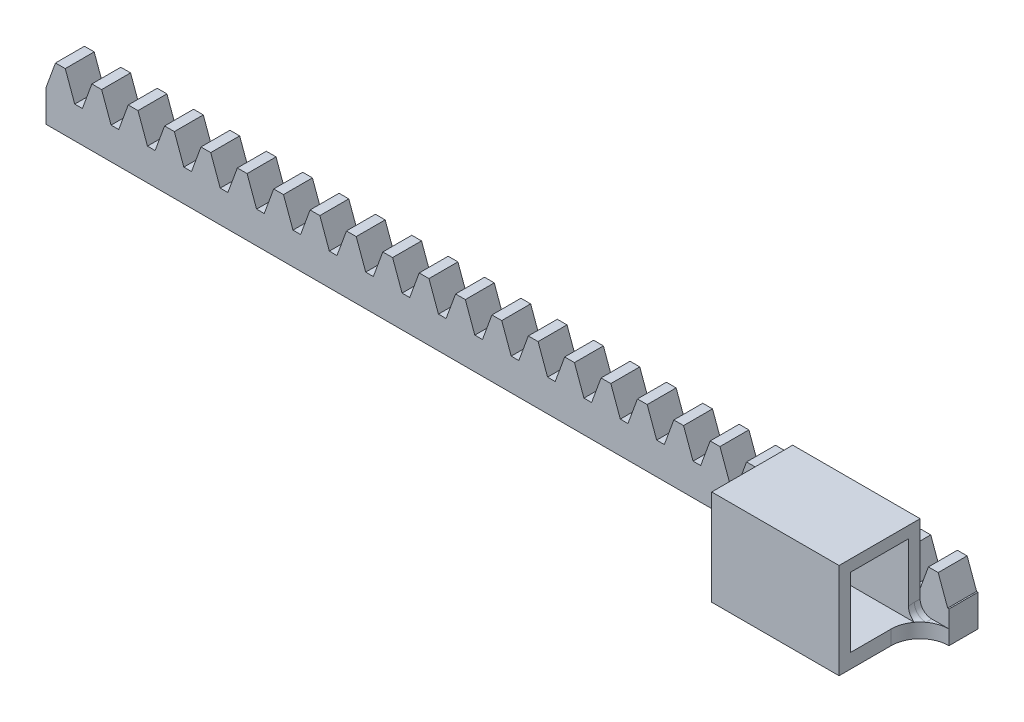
ISO-10303-21;
HEADER;
FILE_DESCRIPTION(('STEP AP214'),'2;1');
FILE_NAME('part.step','',(''),(''),'','','');
FILE_SCHEMA(('AUTOMOTIVE_DESIGN { 1 0 10303 214 1 1 1 1 }'));
ENDSEC;
DATA;
#1=APPLICATION_CONTEXT('core data for automotive mechanical design processes');
#2=APPLICATION_PROTOCOL_DEFINITION('international standard','automotive_design',2000,#1);
#3=PRODUCT_CONTEXT('',#1,'mechanical');
#4=PRODUCT('Part','Part','',(#3));
#5=PRODUCT_RELATED_PRODUCT_CATEGORY('part','',(#4));
#6=PRODUCT_DEFINITION_FORMATION('','',#4);
#7=PRODUCT_DEFINITION_CONTEXT('part definition',#1,'design');
#8=PRODUCT_DEFINITION('design','',#6,#7);
#9=PRODUCT_DEFINITION_SHAPE('','',#8);
#10=(LENGTH_UNIT() NAMED_UNIT(*) SI_UNIT(.MILLI.,.METRE.));
#11=(NAMED_UNIT(*) PLANE_ANGLE_UNIT() SI_UNIT($,.RADIAN.));
#12=(NAMED_UNIT(*) SI_UNIT($,.STERADIAN.) SOLID_ANGLE_UNIT());
#13=UNCERTAINTY_MEASURE_WITH_UNIT(LENGTH_MEASURE(1.E-05),#10,'distance_accuracy_value','');
#14=(GEOMETRIC_REPRESENTATION_CONTEXT(3) GLOBAL_UNCERTAINTY_ASSIGNED_CONTEXT((#13)) GLOBAL_UNIT_ASSIGNED_CONTEXT((#10,
#11,#12)) REPRESENTATION_CONTEXT('',''));
#15=CARTESIAN_POINT('',(0.,0.,0.));
#16=DIRECTION('',(0.,0.,1.));
#17=DIRECTION('',(1.,0.,0.));
#18=AXIS2_PLACEMENT_3D('',#15,#16,#17);
#19=CARTESIAN_POINT('',(129.,-2.99999999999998,44.));
#20=DIRECTION('',(0.,-1.,0.));
#21=DIRECTION('',(0.,0.,-1.));
#22=AXIS2_PLACEMENT_3D('',#19,#20,#21);
#23=PLANE('',#22);
#24=DIRECTION('',(1.,0.,0.));
#25=VECTOR('',#24,1.);
#26=CARTESIAN_POINT('',(129.,-2.99999999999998,32.));
#27=LINE('',#26,#25);
#28=CARTESIAN_POINT('',(128.,-2.99999999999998,32.));
#29=VERTEX_POINT('',#28);
#30=CARTESIAN_POINT('',(152.,-2.99999999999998,32.));
#31=VERTEX_POINT('',#30);
#32=EDGE_CURVE('E817',#29,#31,#27,.T.);
#33=ORIENTED_EDGE('',*,*,#32,.F.);
#34=CARTESIAN_POINT('',(124.,-2.99999999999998,35.));
#35=DIRECTION('',(0.,-1.,0.));
#36=DIRECTION('',(0.,0.,-1.));
#37=AXIS2_PLACEMENT_3D('',#34,#35,#36);
#38=CIRCLE('',#37,5.);
#39=CARTESIAN_POINT('',(129.,-2.99999999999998,35.));
#40=VERTEX_POINT('',#39);
#41=EDGE_CURVE('E1864',#29,#40,#38,.T.);
#42=ORIENTED_EDGE('',*,*,#41,.T.);
#43=DIRECTION('',(0.,0.,-1.));
#44=VECTOR('',#43,1.);
#45=CARTESIAN_POINT('',(129.,-2.99999999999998,44.));
#46=LINE('',#45,#44);
#47=CARTESIAN_POINT('',(129.,-2.99999999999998,42.));
#48=VERTEX_POINT('',#47);
#49=EDGE_CURVE('E890',#48,#40,#46,.T.);
#50=ORIENTED_EDGE('',*,*,#49,.F.);
#51=DIRECTION('',(-1.,0.,0.));
#52=VECTOR('',#51,1.);
#53=CARTESIAN_POINT('',(131.,-2.99999999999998,42.));
#54=LINE('',#53,#52);
#55=CARTESIAN_POINT('',(151.,-2.99999999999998,42.));
#56=VERTEX_POINT('',#55);
#57=EDGE_CURVE('E854',#56,#48,#54,.T.);
#58=ORIENTED_EDGE('',*,*,#57,.F.);
#59=DIRECTION('',(0.,0.,-1.));
#60=VECTOR('',#59,1.);
#61=CARTESIAN_POINT('',(151.,-2.99999999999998,44.));
#62=LINE('',#61,#60);
#63=CARTESIAN_POINT('',(151.,-2.99999999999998,35.));
#64=VERTEX_POINT('',#63);
#65=EDGE_CURVE('E894',#56,#64,#62,.T.);
#66=ORIENTED_EDGE('',*,*,#65,.T.);
#67=CARTESIAN_POINT('',(156.,-2.99999999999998,35.));
#68=DIRECTION('',(0.,-1.,0.));
#69=DIRECTION('',(0.,0.,-1.));
#70=AXIS2_PLACEMENT_3D('',#67,#68,#69);
#71=CIRCLE('',#70,5.);
#72=EDGE_CURVE('E1871',#64,#31,#71,.T.);
#73=ORIENTED_EDGE('',*,*,#72,.T.);
#74=EDGE_LOOP('',(#33,#42,#50,#58,#66,#73));
#75=FACE_BOUND('',#74,.T.);
#76=ADVANCED_FACE('F49',(#75),#23,.F.);
#77=DIRECTION('',(-1.,0.,0.));
#78=VECTOR('',#77,1.);
#79=CARTESIAN_POINT('',(129.,-2.99999999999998,30.));
#80=LINE('',#79,#78);
#81=CARTESIAN_POINT('',(156.,-2.99999999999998,30.));
#82=VERTEX_POINT('',#81);
#83=CARTESIAN_POINT('',(153.,-2.99999999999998,30.));
#84=VERTEX_POINT('',#83);
#85=EDGE_CURVE('E873',#82,#84,#80,.T.);
#86=ORIENTED_EDGE('',*,*,#85,.T.);
#87=DIRECTION('',(0.,0.,-1.));
#88=VECTOR('',#87,1.);
#89=CARTESIAN_POINT('',(153.,-2.99999999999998,32.));
#90=LINE('',#89,#88);
#91=CARTESIAN_POINT('',(153.,-2.99999999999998,31.));
#92=VERTEX_POINT('',#91);
#93=EDGE_CURVE('E2009',#84,#92,#90,.F.);
#94=ORIENTED_EDGE('',*,*,#93,.T.);
#95=EDGE_CURVE('E1869',#92,#82,#71,.T.);
#96=ORIENTED_EDGE('',*,*,#95,.T.);
#97=EDGE_LOOP('',(#86,#94,#96));
#98=FACE_BOUND('',#97,.T.);
#99=ADVANCED_FACE('F1980',(#98),#23,.F.);
#100=CARTESIAN_POINT('',(124.,-2.99999999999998,30.));
#101=VERTEX_POINT('',#100);
#102=CARTESIAN_POINT('',(126.993570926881,-2.99999999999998,30.9951862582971));
#103=VERTEX_POINT('',#102);
#104=EDGE_CURVE('E1865',#101,#103,#38,.T.);
#105=ORIENTED_EDGE('',*,*,#104,.T.);
#106=DIRECTION('',(0.00635791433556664,0.,0.999979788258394));
#107=VECTOR('',#106,1.);
#108=CARTESIAN_POINT('',(126.987324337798,-2.99999999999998,30.0127158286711));
#109=LINE('',#108,#107);
#110=CARTESIAN_POINT('',(126.987243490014,-2.99999999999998,30.));
#111=VERTEX_POINT('',#110);
#112=EDGE_CURVE('E1997',#103,#111,#109,.F.);
#113=ORIENTED_EDGE('',*,*,#112,.T.);
#114=EDGE_CURVE('E868',#111,#101,#80,.T.);
#115=ORIENTED_EDGE('',*,*,#114,.T.);
#116=EDGE_LOOP('',(#105,#113,#115));
#117=FACE_BOUND('',#116,.T.);
#118=ADVANCED_FACE('F1939',(#117),#23,.F.);
#119=CARTESIAN_POINT('',(0.,-10.,30.));
#120=DIRECTION('',(0.,0.,1.));
#121=DIRECTION('',(1.,0.,0.));
#122=AXIS2_PLACEMENT_3D('',#119,#120,#121);
#123=PLANE('',#122);
#124=ORIENTED_EDGE('',*,*,#114,.F.);
#125=CARTESIAN_POINT('',(126.987243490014,-0.999999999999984,30.));
#126=DIRECTION('',(0.,0.,1.));
#127=DIRECTION('',(-1.,0.,0.));
#128=AXIS2_PLACEMENT_3D('',#125,#126,#127);
#129=ELLIPSE('',#128,2.00004042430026,2.);
#130=CARTESIAN_POINT('',(128.987283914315,-0.999999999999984,30.));
#131=VERTEX_POINT('',#130);
#132=EDGE_CURVE('E2007',#111,#131,#129,.T.);
#133=ORIENTED_EDGE('',*,*,#132,.T.);
#134=DIRECTION('',(0.,-1.,0.));
#135=VECTOR('',#134,1.);
#136=CARTESIAN_POINT('',(128.987283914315,11.,30.));
#137=LINE('',#136,#135);
#138=CARTESIAN_POINT('',(128.987283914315,4.5,30.));
#139=VERTEX_POINT('',#138);
#140=EDGE_CURVE('E826',#139,#131,#137,.T.);
#141=ORIENTED_EDGE('',*,*,#140,.F.);
#142=DIRECTION('',(-1.,0.,0.));
#143=VECTOR('',#142,1.);
#144=CARTESIAN_POINT('',(127.30157219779,4.5,30.));
#145=LINE('',#144,#143);
#146=CARTESIAN_POINT('',(127.30157219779,4.5,30.));
#147=VERTEX_POINT('',#146);
#148=EDGE_CURVE('E1344',#139,#147,#145,.T.);
#149=ORIENTED_EDGE('',*,*,#148,.T.);
#150=DIRECTION('',(-0.342020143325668,-0.939692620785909,0.));
#151=VECTOR('',#150,1.);
#152=CARTESIAN_POINT('',(125.663706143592,0.,30.));
#153=LINE('',#152,#151);
#154=CARTESIAN_POINT('',(125.663706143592,0.,30.));
#155=VERTEX_POINT('',#154);
#156=EDGE_CURVE('E1348',#147,#155,#153,.T.);
#157=ORIENTED_EDGE('',*,*,#156,.T.);
#158=DIRECTION('',(-1.,0.,0.));
#159=VECTOR('',#158,1.);
#160=CARTESIAN_POINT('',(0.,0.,30.));
#161=LINE('',#160,#159);
#162=CARTESIAN_POINT('',(124.341964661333,0.,30.));
#163=VERTEX_POINT('',#162);
#164=EDGE_CURVE('E2345',#155,#163,#161,.T.);
#165=ORIENTED_EDGE('',*,*,#164,.T.);
#166=DIRECTION('',(-0.342020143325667,0.939692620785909,0.));
#167=VECTOR('',#166,1.);
#168=CARTESIAN_POINT('',(122.704098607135,4.5,30.));
#169=LINE('',#168,#167);
#170=CARTESIAN_POINT('',(122.704098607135,4.5,30.));
#171=VERTEX_POINT('',#170);
#172=EDGE_CURVE('E1356',#163,#171,#169,.T.);
#173=ORIENTED_EDGE('',*,*,#172,.T.);
#174=DIRECTION('',(-1.,0.,0.));
#175=VECTOR('',#174,1.);
#176=CARTESIAN_POINT('',(121.01838689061,4.5,30.));
#177=LINE('',#176,#175);
#178=CARTESIAN_POINT('',(121.01838689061,4.5,30.));
#179=VERTEX_POINT('',#178);
#180=EDGE_CURVE('E1369',#171,#179,#177,.T.);
#181=ORIENTED_EDGE('',*,*,#180,.T.);
#182=DIRECTION('',(-0.342020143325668,-0.939692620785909,0.));
#183=VECTOR('',#182,1.);
#184=CARTESIAN_POINT('',(119.380520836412,0.,30.));
#185=LINE('',#184,#183);
#186=CARTESIAN_POINT('',(119.380520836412,0.,30.));
#187=VERTEX_POINT('',#186);
#188=EDGE_CURVE('E1373',#179,#187,#185,.T.);
#189=ORIENTED_EDGE('',*,*,#188,.T.);
#190=CARTESIAN_POINT('',(118.058779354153,0.,30.));
#191=VERTEX_POINT('',#190);
#192=EDGE_CURVE('E2348',#187,#191,#161,.T.);
#193=ORIENTED_EDGE('',*,*,#192,.T.);
#194=DIRECTION('',(-0.342020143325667,0.939692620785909,0.));
#195=VECTOR('',#194,1.);
#196=CARTESIAN_POINT('',(116.420913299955,4.5,30.));
#197=LINE('',#196,#195);
#198=CARTESIAN_POINT('',(116.420913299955,4.5,30.));
#199=VERTEX_POINT('',#198);
#200=EDGE_CURVE('E1381',#191,#199,#197,.T.);
#201=ORIENTED_EDGE('',*,*,#200,.T.);
#202=DIRECTION('',(-1.,0.,0.));
#203=VECTOR('',#202,1.);
#204=CARTESIAN_POINT('',(114.73520158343,4.5,30.));
#205=LINE('',#204,#203);
#206=CARTESIAN_POINT('',(114.73520158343,4.5,30.));
#207=VERTEX_POINT('',#206);
#208=EDGE_CURVE('E1393',#199,#207,#205,.T.);
#209=ORIENTED_EDGE('',*,*,#208,.T.);
#210=DIRECTION('',(-0.342020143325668,-0.939692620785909,0.));
#211=VECTOR('',#210,1.);
#212=CARTESIAN_POINT('',(113.097335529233,0.,30.));
#213=LINE('',#212,#211);
#214=CARTESIAN_POINT('',(113.097335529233,0.,30.));
#215=VERTEX_POINT('',#214);
#216=EDGE_CURVE('E1397',#207,#215,#213,.T.);
#217=ORIENTED_EDGE('',*,*,#216,.T.);
#218=CARTESIAN_POINT('',(111.775594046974,0.,30.));
#219=VERTEX_POINT('',#218);
#220=EDGE_CURVE('E2222',#215,#219,#161,.T.);
#221=ORIENTED_EDGE('',*,*,#220,.T.);
#222=DIRECTION('',(-0.342020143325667,0.939692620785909,0.));
#223=VECTOR('',#222,1.);
#224=CARTESIAN_POINT('',(110.137727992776,4.5,30.));
#225=LINE('',#224,#223);
#226=CARTESIAN_POINT('',(110.137727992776,4.5,30.));
#227=VERTEX_POINT('',#226);
#228=EDGE_CURVE('E1405',#219,#227,#225,.T.);
#229=ORIENTED_EDGE('',*,*,#228,.T.);
#230=DIRECTION('',(-1.,0.,0.));
#231=VECTOR('',#230,1.);
#232=CARTESIAN_POINT('',(108.452016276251,4.5,30.));
#233=LINE('',#232,#231);
#234=CARTESIAN_POINT('',(108.452016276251,4.5,30.));
#235=VERTEX_POINT('',#234);
#236=EDGE_CURVE('E1417',#227,#235,#233,.T.);
#237=ORIENTED_EDGE('',*,*,#236,.T.);
#238=DIRECTION('',(-0.342020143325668,-0.939692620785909,0.));
#239=VECTOR('',#238,1.);
#240=CARTESIAN_POINT('',(106.814150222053,0.,30.));
#241=LINE('',#240,#239);
#242=CARTESIAN_POINT('',(106.814150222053,0.,30.));
#243=VERTEX_POINT('',#242);
#244=EDGE_CURVE('E1421',#235,#243,#241,.T.);
#245=ORIENTED_EDGE('',*,*,#244,.T.);
#246=CARTESIAN_POINT('',(105.492408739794,0.,30.));
#247=VERTEX_POINT('',#246);
#248=EDGE_CURVE('E2218',#243,#247,#161,.T.);
#249=ORIENTED_EDGE('',*,*,#248,.T.);
#250=DIRECTION('',(-0.342020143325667,0.939692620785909,0.));
#251=VECTOR('',#250,1.);
#252=CARTESIAN_POINT('',(103.854542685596,4.5,30.));
#253=LINE('',#252,#251);
#254=CARTESIAN_POINT('',(103.854542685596,4.5,30.));
#255=VERTEX_POINT('',#254);
#256=EDGE_CURVE('E1429',#247,#255,#253,.T.);
#257=ORIENTED_EDGE('',*,*,#256,.T.);
#258=DIRECTION('',(-1.,0.,0.));
#259=VECTOR('',#258,1.);
#260=CARTESIAN_POINT('',(102.168830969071,4.5,30.));
#261=LINE('',#260,#259);
#262=CARTESIAN_POINT('',(102.168830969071,4.5,30.));
#263=VERTEX_POINT('',#262);
#264=EDGE_CURVE('E1441',#255,#263,#261,.T.);
#265=ORIENTED_EDGE('',*,*,#264,.T.);
#266=DIRECTION('',(-0.342020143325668,-0.939692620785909,0.));
#267=VECTOR('',#266,1.);
#268=CARTESIAN_POINT('',(100.530964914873,0.,30.));
#269=LINE('',#268,#267);
#270=CARTESIAN_POINT('',(100.530964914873,0.,30.));
#271=VERTEX_POINT('',#270);
#272=EDGE_CURVE('E1445',#263,#271,#269,.T.);
#273=ORIENTED_EDGE('',*,*,#272,.T.);
#274=CARTESIAN_POINT('',(99.2092234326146,0.,30.));
#275=VERTEX_POINT('',#274);
#276=EDGE_CURVE('E2223',#271,#275,#161,.T.);
#277=ORIENTED_EDGE('',*,*,#276,.T.);
#278=DIRECTION('',(-0.342020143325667,0.939692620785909,0.));
#279=VECTOR('',#278,1.);
#280=CARTESIAN_POINT('',(97.5713573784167,4.5,30.));
#281=LINE('',#280,#279);
#282=CARTESIAN_POINT('',(97.5713573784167,4.5,30.));
#283=VERTEX_POINT('',#282);
#284=EDGE_CURVE('E1453',#275,#283,#281,.T.);
#285=ORIENTED_EDGE('',*,*,#284,.T.);
#286=DIRECTION('',(-1.,0.,0.));
#287=VECTOR('',#286,1.);
#288=CARTESIAN_POINT('',(95.8856456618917,4.5,30.));
#289=LINE('',#288,#287);
#290=CARTESIAN_POINT('',(95.8856456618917,4.5,30.));
#291=VERTEX_POINT('',#290);
#292=EDGE_CURVE('E1465',#283,#291,#289,.T.);
#293=ORIENTED_EDGE('',*,*,#292,.T.);
#294=DIRECTION('',(-0.342020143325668,-0.939692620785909,0.));
#295=VECTOR('',#294,1.);
#296=CARTESIAN_POINT('',(94.2477796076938,0.,30.));
#297=LINE('',#296,#295);
#298=CARTESIAN_POINT('',(94.2477796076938,0.,30.));
#299=VERTEX_POINT('',#298);
#300=EDGE_CURVE('E1469',#291,#299,#297,.T.);
#301=ORIENTED_EDGE('',*,*,#300,.T.);
#302=CARTESIAN_POINT('',(92.926038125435,0.,30.));
#303=VERTEX_POINT('',#302);
#304=EDGE_CURVE('E2063',#299,#303,#161,.T.);
#305=ORIENTED_EDGE('',*,*,#304,.T.);
#306=DIRECTION('',(-0.342020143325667,0.939692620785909,0.));
#307=VECTOR('',#306,1.);
#308=CARTESIAN_POINT('',(91.2881720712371,4.5,30.));
#309=LINE('',#308,#307);
#310=CARTESIAN_POINT('',(91.2881720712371,4.5,30.));
#311=VERTEX_POINT('',#310);
#312=EDGE_CURVE('E1477',#303,#311,#309,.T.);
#313=ORIENTED_EDGE('',*,*,#312,.T.);
#314=DIRECTION('',(-1.,0.,0.));
#315=VECTOR('',#314,1.);
#316=CARTESIAN_POINT('',(89.6024603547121,4.5,30.));
#317=LINE('',#316,#315);
#318=CARTESIAN_POINT('',(89.6024603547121,4.5,30.));
#319=VERTEX_POINT('',#318);
#320=EDGE_CURVE('E1489',#311,#319,#317,.T.);
#321=ORIENTED_EDGE('',*,*,#320,.T.);
#322=DIRECTION('',(-0.342020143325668,-0.939692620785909,0.));
#323=VECTOR('',#322,1.);
#324=CARTESIAN_POINT('',(87.9645943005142,0.,30.));
#325=LINE('',#324,#323);
#326=CARTESIAN_POINT('',(87.9645943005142,0.,30.));
#327=VERTEX_POINT('',#326);
#328=EDGE_CURVE('E1493',#319,#327,#325,.T.);
#329=ORIENTED_EDGE('',*,*,#328,.T.);
#330=CARTESIAN_POINT('',(86.6428528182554,0.,30.));
#331=VERTEX_POINT('',#330);
#332=EDGE_CURVE('E2059',#327,#331,#161,.T.);
#333=ORIENTED_EDGE('',*,*,#332,.T.);
#334=DIRECTION('',(-0.342020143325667,0.939692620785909,0.));
#335=VECTOR('',#334,1.);
#336=CARTESIAN_POINT('',(85.0049867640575,4.5,30.));
#337=LINE('',#336,#335);
#338=CARTESIAN_POINT('',(85.0049867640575,4.5,30.));
#339=VERTEX_POINT('',#338);
#340=EDGE_CURVE('E1501',#331,#339,#337,.T.);
#341=ORIENTED_EDGE('',*,*,#340,.T.);
#342=DIRECTION('',(-1.,0.,0.));
#343=VECTOR('',#342,1.);
#344=CARTESIAN_POINT('',(83.3192750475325,4.5,30.));
#345=LINE('',#344,#343);
#346=CARTESIAN_POINT('',(83.3192750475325,4.5,30.));
#347=VERTEX_POINT('',#346);
#348=EDGE_CURVE('E1513',#339,#347,#345,.T.);
#349=ORIENTED_EDGE('',*,*,#348,.T.);
#350=DIRECTION('',(-0.342020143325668,-0.939692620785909,0.));
#351=VECTOR('',#350,1.);
#352=CARTESIAN_POINT('',(81.6814089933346,0.,30.));
#353=LINE('',#352,#351);
#354=CARTESIAN_POINT('',(81.6814089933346,0.,30.));
#355=VERTEX_POINT('',#354);
#356=EDGE_CURVE('E1517',#347,#355,#353,.T.);
#357=ORIENTED_EDGE('',*,*,#356,.T.);
#358=CARTESIAN_POINT('',(80.3596675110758,0.,30.));
#359=VERTEX_POINT('',#358);
#360=EDGE_CURVE('E2064',#355,#359,#161,.T.);
#361=ORIENTED_EDGE('',*,*,#360,.T.);
#362=DIRECTION('',(-0.342020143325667,0.939692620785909,0.));
#363=VECTOR('',#362,1.);
#364=CARTESIAN_POINT('',(78.7218014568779,4.5,30.));
#365=LINE('',#364,#363);
#366=CARTESIAN_POINT('',(78.7218014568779,4.5,30.));
#367=VERTEX_POINT('',#366);
#368=EDGE_CURVE('E1525',#359,#367,#365,.T.);
#369=ORIENTED_EDGE('',*,*,#368,.T.);
#370=DIRECTION('',(-1.,0.,0.));
#371=VECTOR('',#370,1.);
#372=CARTESIAN_POINT('',(77.0360897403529,4.5,30.));
#373=LINE('',#372,#371);
#374=CARTESIAN_POINT('',(77.0360897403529,4.5,30.));
#375=VERTEX_POINT('',#374);
#376=EDGE_CURVE('E1537',#367,#375,#373,.T.);
#377=ORIENTED_EDGE('',*,*,#376,.T.);
#378=DIRECTION('',(-0.342020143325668,-0.939692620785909,0.));
#379=VECTOR('',#378,1.);
#380=CARTESIAN_POINT('',(75.398223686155,0.,30.));
#381=LINE('',#380,#379);
#382=CARTESIAN_POINT('',(75.398223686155,0.,30.));
#383=VERTEX_POINT('',#382);
#384=EDGE_CURVE('E1541',#375,#383,#381,.T.);
#385=ORIENTED_EDGE('',*,*,#384,.T.);
#386=CARTESIAN_POINT('',(74.0764822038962,0.,30.));
#387=VERTEX_POINT('',#386);
#388=EDGE_CURVE('E2183',#383,#387,#161,.T.);
#389=ORIENTED_EDGE('',*,*,#388,.T.);
#390=DIRECTION('',(-0.342020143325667,0.939692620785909,0.));
#391=VECTOR('',#390,1.);
#392=CARTESIAN_POINT('',(72.4386161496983,4.5,30.));
#393=LINE('',#392,#391);
#394=CARTESIAN_POINT('',(72.4386161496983,4.5,30.));
#395=VERTEX_POINT('',#394);
#396=EDGE_CURVE('E1549',#387,#395,#393,.T.);
#397=ORIENTED_EDGE('',*,*,#396,.T.);
#398=DIRECTION('',(-1.,0.,0.));
#399=VECTOR('',#398,1.);
#400=CARTESIAN_POINT('',(70.7529044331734,4.5,30.));
#401=LINE('',#400,#399);
#402=CARTESIAN_POINT('',(70.7529044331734,4.5,30.));
#403=VERTEX_POINT('',#402);
#404=EDGE_CURVE('E1561',#395,#403,#401,.T.);
#405=ORIENTED_EDGE('',*,*,#404,.T.);
#406=DIRECTION('',(-0.342020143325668,-0.939692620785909,0.));
#407=VECTOR('',#406,1.);
#408=CARTESIAN_POINT('',(69.1150383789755,0.,30.));
#409=LINE('',#408,#407);
#410=CARTESIAN_POINT('',(69.1150383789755,0.,30.));
#411=VERTEX_POINT('',#410);
#412=EDGE_CURVE('E1565',#403,#411,#409,.T.);
#413=ORIENTED_EDGE('',*,*,#412,.T.);
#414=CARTESIAN_POINT('',(67.7932968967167,0.,30.));
#415=VERTEX_POINT('',#414);
#416=EDGE_CURVE('E2180',#411,#415,#161,.T.);
#417=ORIENTED_EDGE('',*,*,#416,.T.);
#418=DIRECTION('',(-0.342020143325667,0.939692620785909,0.));
#419=VECTOR('',#418,1.);
#420=CARTESIAN_POINT('',(66.1554308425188,4.5,30.));
#421=LINE('',#420,#419);
#422=CARTESIAN_POINT('',(66.1554308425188,4.5,30.));
#423=VERTEX_POINT('',#422);
#424=EDGE_CURVE('E1573',#415,#423,#421,.T.);
#425=ORIENTED_EDGE('',*,*,#424,.T.);
#426=DIRECTION('',(-1.,0.,0.));
#427=VECTOR('',#426,1.);
#428=CARTESIAN_POINT('',(64.4697191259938,4.5,30.));
#429=LINE('',#428,#427);
#430=CARTESIAN_POINT('',(64.4697191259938,4.5,30.));
#431=VERTEX_POINT('',#430);
#432=EDGE_CURVE('E1585',#423,#431,#429,.T.);
#433=ORIENTED_EDGE('',*,*,#432,.T.);
#434=DIRECTION('',(-0.342020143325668,-0.939692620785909,0.));
#435=VECTOR('',#434,1.);
#436=CARTESIAN_POINT('',(62.8318530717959,0.,30.));
#437=LINE('',#436,#435);
#438=CARTESIAN_POINT('',(62.8318530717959,0.,30.));
#439=VERTEX_POINT('',#438);
#440=EDGE_CURVE('E1589',#431,#439,#437,.T.);
#441=ORIENTED_EDGE('',*,*,#440,.T.);
#442=CARTESIAN_POINT('',(61.5101115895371,0.,30.));
#443=VERTEX_POINT('',#442);
#444=EDGE_CURVE('E2184',#439,#443,#161,.T.);
#445=ORIENTED_EDGE('',*,*,#444,.T.);
#446=DIRECTION('',(-0.342020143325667,0.939692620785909,0.));
#447=VECTOR('',#446,1.);
#448=CARTESIAN_POINT('',(59.8722455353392,4.5,30.));
#449=LINE('',#448,#447);
#450=CARTESIAN_POINT('',(59.8722455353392,4.5,30.));
#451=VERTEX_POINT('',#450);
#452=EDGE_CURVE('E1597',#443,#451,#449,.T.);
#453=ORIENTED_EDGE('',*,*,#452,.T.);
#454=DIRECTION('',(-1.,0.,0.));
#455=VECTOR('',#454,1.);
#456=CARTESIAN_POINT('',(58.1865338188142,4.5,30.));
#457=LINE('',#456,#455);
#458=CARTESIAN_POINT('',(58.1865338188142,4.5,30.));
#459=VERTEX_POINT('',#458);
#460=EDGE_CURVE('E1609',#451,#459,#457,.T.);
#461=ORIENTED_EDGE('',*,*,#460,.T.);
#462=DIRECTION('',(-0.342020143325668,-0.939692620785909,0.));
#463=VECTOR('',#462,1.);
#464=CARTESIAN_POINT('',(56.5486677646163,0.,30.));
#465=LINE('',#464,#463);
#466=CARTESIAN_POINT('',(56.5486677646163,0.,30.));
#467=VERTEX_POINT('',#466);
#468=EDGE_CURVE('E1613',#459,#467,#465,.T.);
#469=ORIENTED_EDGE('',*,*,#468,.T.);
#470=CARTESIAN_POINT('',(55.2269262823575,0.,30.));
#471=VERTEX_POINT('',#470);
#472=EDGE_CURVE('E2135',#467,#471,#161,.T.);
#473=ORIENTED_EDGE('',*,*,#472,.T.);
#474=DIRECTION('',(-0.342020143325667,0.939692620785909,0.));
#475=VECTOR('',#474,1.);
#476=CARTESIAN_POINT('',(53.5890602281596,4.5,30.));
#477=LINE('',#476,#475);
#478=CARTESIAN_POINT('',(53.5890602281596,4.5,30.));
#479=VERTEX_POINT('',#478);
#480=EDGE_CURVE('E1621',#471,#479,#477,.T.);
#481=ORIENTED_EDGE('',*,*,#480,.T.);
#482=DIRECTION('',(-1.,0.,0.));
#483=VECTOR('',#482,1.);
#484=CARTESIAN_POINT('',(51.9033485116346,4.5,30.));
#485=LINE('',#484,#483);
#486=CARTESIAN_POINT('',(51.9033485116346,4.5,30.));
#487=VERTEX_POINT('',#486);
#488=EDGE_CURVE('E1633',#479,#487,#485,.T.);
#489=ORIENTED_EDGE('',*,*,#488,.T.);
#490=DIRECTION('',(-0.342020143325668,-0.939692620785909,0.));
#491=VECTOR('',#490,1.);
#492=CARTESIAN_POINT('',(50.2654824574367,0.,30.));
#493=LINE('',#492,#491);
#494=CARTESIAN_POINT('',(50.2654824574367,0.,30.));
#495=VERTEX_POINT('',#494);
#496=EDGE_CURVE('E1637',#487,#495,#493,.T.);
#497=ORIENTED_EDGE('',*,*,#496,.T.);
#498=CARTESIAN_POINT('',(48.9437409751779,0.,30.));
#499=VERTEX_POINT('',#498);
#500=EDGE_CURVE('E2131',#495,#499,#161,.T.);
#501=ORIENTED_EDGE('',*,*,#500,.T.);
#502=DIRECTION('',(-0.342020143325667,0.939692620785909,0.));
#503=VECTOR('',#502,1.);
#504=CARTESIAN_POINT('',(47.30587492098,4.5,30.));
#505=LINE('',#504,#503);
#506=CARTESIAN_POINT('',(47.30587492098,4.5,30.));
#507=VERTEX_POINT('',#506);
#508=EDGE_CURVE('E1645',#499,#507,#505,.T.);
#509=ORIENTED_EDGE('',*,*,#508,.T.);
#510=DIRECTION('',(-1.,0.,0.));
#511=VECTOR('',#510,1.);
#512=CARTESIAN_POINT('',(45.620163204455,4.5,30.));
#513=LINE('',#512,#511);
#514=CARTESIAN_POINT('',(45.620163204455,4.5,30.));
#515=VERTEX_POINT('',#514);
#516=EDGE_CURVE('E1657',#507,#515,#513,.T.);
#517=ORIENTED_EDGE('',*,*,#516,.T.);
#518=DIRECTION('',(-0.342020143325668,-0.939692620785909,0.));
#519=VECTOR('',#518,1.);
#520=CARTESIAN_POINT('',(43.9822971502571,0.,30.));
#521=LINE('',#520,#519);
#522=CARTESIAN_POINT('',(43.9822971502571,0.,30.));
#523=VERTEX_POINT('',#522);
#524=EDGE_CURVE('E1661',#515,#523,#521,.T.);
#525=ORIENTED_EDGE('',*,*,#524,.T.);
#526=CARTESIAN_POINT('',(42.6605556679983,0.,30.));
#527=VERTEX_POINT('',#526);
#528=EDGE_CURVE('E2136',#523,#527,#161,.T.);
#529=ORIENTED_EDGE('',*,*,#528,.T.);
#530=DIRECTION('',(-0.342020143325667,0.939692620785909,0.));
#531=VECTOR('',#530,1.);
#532=CARTESIAN_POINT('',(41.0226896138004,4.5,30.));
#533=LINE('',#532,#531);
#534=CARTESIAN_POINT('',(41.0226896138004,4.5,30.));
#535=VERTEX_POINT('',#534);
#536=EDGE_CURVE('E1669',#527,#535,#533,.T.);
#537=ORIENTED_EDGE('',*,*,#536,.T.);
#538=DIRECTION('',(-1.,0.,0.));
#539=VECTOR('',#538,1.);
#540=CARTESIAN_POINT('',(39.3369778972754,4.5,30.));
#541=LINE('',#540,#539);
#542=CARTESIAN_POINT('',(39.3369778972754,4.5,30.));
#543=VERTEX_POINT('',#542);
#544=EDGE_CURVE('E1681',#535,#543,#541,.T.);
#545=ORIENTED_EDGE('',*,*,#544,.T.);
#546=DIRECTION('',(-0.342020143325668,-0.939692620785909,0.));
#547=VECTOR('',#546,1.);
#548=CARTESIAN_POINT('',(37.6991118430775,0.,30.));
#549=LINE('',#548,#547);
#550=CARTESIAN_POINT('',(37.6991118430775,0.,30.));
#551=VERTEX_POINT('',#550);
#552=EDGE_CURVE('E1685',#543,#551,#549,.T.);
#553=ORIENTED_EDGE('',*,*,#552,.T.);
#554=CARTESIAN_POINT('',(36.3773703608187,0.,30.));
#555=VERTEX_POINT('',#554);
#556=EDGE_CURVE('E2305',#551,#555,#161,.T.);
#557=ORIENTED_EDGE('',*,*,#556,.T.);
#558=DIRECTION('',(-0.342020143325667,0.939692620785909,0.));
#559=VECTOR('',#558,1.);
#560=CARTESIAN_POINT('',(34.7395043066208,4.5,30.));
#561=LINE('',#560,#559);
#562=CARTESIAN_POINT('',(34.7395043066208,4.5,30.));
#563=VERTEX_POINT('',#562);
#564=EDGE_CURVE('E1693',#555,#563,#561,.T.);
#565=ORIENTED_EDGE('',*,*,#564,.T.);
#566=DIRECTION('',(-1.,0.,0.));
#567=VECTOR('',#566,1.);
#568=CARTESIAN_POINT('',(33.0537925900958,4.5,30.));
#569=LINE('',#568,#567);
#570=CARTESIAN_POINT('',(33.0537925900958,4.5,30.));
#571=VERTEX_POINT('',#570);
#572=EDGE_CURVE('E1705',#563,#571,#569,.T.);
#573=ORIENTED_EDGE('',*,*,#572,.T.);
#574=DIRECTION('',(-0.342020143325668,-0.939692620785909,0.));
#575=VECTOR('',#574,1.);
#576=CARTESIAN_POINT('',(31.4159265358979,0.,30.));
#577=LINE('',#576,#575);
#578=CARTESIAN_POINT('',(31.4159265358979,0.,30.));
#579=VERTEX_POINT('',#578);
#580=EDGE_CURVE('E1709',#571,#579,#577,.T.);
#581=ORIENTED_EDGE('',*,*,#580,.T.);
#582=CARTESIAN_POINT('',(30.0941850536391,0.,30.));
#583=VERTEX_POINT('',#582);
#584=EDGE_CURVE('E2126',#579,#583,#161,.T.);
#585=ORIENTED_EDGE('',*,*,#584,.T.);
#586=DIRECTION('',(-0.342020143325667,0.939692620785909,0.));
#587=VECTOR('',#586,1.);
#588=CARTESIAN_POINT('',(28.4563189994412,4.5,30.));
#589=LINE('',#588,#587);
#590=CARTESIAN_POINT('',(28.4563189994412,4.5,30.));
#591=VERTEX_POINT('',#590);
#592=EDGE_CURVE('E1717',#583,#591,#589,.T.);
#593=ORIENTED_EDGE('',*,*,#592,.T.);
#594=DIRECTION('',(-1.,0.,0.));
#595=VECTOR('',#594,1.);
#596=CARTESIAN_POINT('',(26.7706072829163,4.5,30.));
#597=LINE('',#596,#595);
#598=CARTESIAN_POINT('',(26.7706072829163,4.5,30.));
#599=VERTEX_POINT('',#598);
#600=EDGE_CURVE('E1729',#591,#599,#597,.T.);
#601=ORIENTED_EDGE('',*,*,#600,.T.);
#602=DIRECTION('',(-0.342020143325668,-0.939692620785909,0.));
#603=VECTOR('',#602,1.);
#604=CARTESIAN_POINT('',(25.1327412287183,0.,30.));
#605=LINE('',#604,#603);
#606=CARTESIAN_POINT('',(25.1327412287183,0.,30.));
#607=VERTEX_POINT('',#606);
#608=EDGE_CURVE('E1733',#599,#607,#605,.T.);
#609=ORIENTED_EDGE('',*,*,#608,.T.);
#610=CARTESIAN_POINT('',(23.8109997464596,0.,30.));
#611=VERTEX_POINT('',#610);
#612=EDGE_CURVE('E2122',#607,#611,#161,.T.);
#613=ORIENTED_EDGE('',*,*,#612,.T.);
#614=DIRECTION('',(-0.342020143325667,0.939692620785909,0.));
#615=VECTOR('',#614,1.);
#616=CARTESIAN_POINT('',(22.1731336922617,4.5,30.));
#617=LINE('',#616,#615);
#618=CARTESIAN_POINT('',(22.1731336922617,4.5,30.));
#619=VERTEX_POINT('',#618);
#620=EDGE_CURVE('E1741',#611,#619,#617,.T.);
#621=ORIENTED_EDGE('',*,*,#620,.T.);
#622=DIRECTION('',(-1.,0.,0.));
#623=VECTOR('',#622,1.);
#624=CARTESIAN_POINT('',(20.4874219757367,4.5,30.));
#625=LINE('',#624,#623);
#626=CARTESIAN_POINT('',(20.4874219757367,4.5,30.));
#627=VERTEX_POINT('',#626);
#628=EDGE_CURVE('E1753',#619,#627,#625,.T.);
#629=ORIENTED_EDGE('',*,*,#628,.T.);
#630=DIRECTION('',(-0.342020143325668,-0.939692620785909,0.));
#631=VECTOR('',#630,1.);
#632=CARTESIAN_POINT('',(18.8495559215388,0.,30.));
#633=LINE('',#632,#631);
#634=CARTESIAN_POINT('',(18.8495559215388,0.,30.));
#635=VERTEX_POINT('',#634);
#636=EDGE_CURVE('E1757',#627,#635,#633,.T.);
#637=ORIENTED_EDGE('',*,*,#636,.T.);
#638=CARTESIAN_POINT('',(17.52781443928,0.,30.));
#639=VERTEX_POINT('',#638);
#640=EDGE_CURVE('E2117',#635,#639,#161,.T.);
#641=ORIENTED_EDGE('',*,*,#640,.T.);
#642=DIRECTION('',(-0.342020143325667,0.939692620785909,0.));
#643=VECTOR('',#642,1.);
#644=CARTESIAN_POINT('',(15.8899483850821,4.5,30.));
#645=LINE('',#644,#643);
#646=CARTESIAN_POINT('',(15.8899483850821,4.5,30.));
#647=VERTEX_POINT('',#646);
#648=EDGE_CURVE('E1765',#639,#647,#645,.T.);
#649=ORIENTED_EDGE('',*,*,#648,.T.);
#650=DIRECTION('',(-1.,0.,0.));
#651=VECTOR('',#650,1.);
#652=CARTESIAN_POINT('',(14.2042366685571,4.5,30.));
#653=LINE('',#652,#651);
#654=CARTESIAN_POINT('',(14.2042366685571,4.5,30.));
#655=VERTEX_POINT('',#654);
#656=EDGE_CURVE('E1777',#647,#655,#653,.T.);
#657=ORIENTED_EDGE('',*,*,#656,.T.);
#658=DIRECTION('',(-0.342020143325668,-0.939692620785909,0.));
#659=VECTOR('',#658,1.);
#660=CARTESIAN_POINT('',(12.5663706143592,0.,30.));
#661=LINE('',#660,#659);
#662=CARTESIAN_POINT('',(12.5663706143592,0.,30.));
#663=VERTEX_POINT('',#662);
#664=EDGE_CURVE('E1781',#655,#663,#661,.T.);
#665=ORIENTED_EDGE('',*,*,#664,.T.);
#666=CARTESIAN_POINT('',(11.2446291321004,0.,30.));
#667=VERTEX_POINT('',#666);
#668=EDGE_CURVE('E2113',#663,#667,#161,.T.);
#669=ORIENTED_EDGE('',*,*,#668,.T.);
#670=DIRECTION('',(-0.342020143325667,0.939692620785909,0.));
#671=VECTOR('',#670,1.);
#672=CARTESIAN_POINT('',(9.60676307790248,4.5,30.));
#673=LINE('',#672,#671);
#674=CARTESIAN_POINT('',(9.60676307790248,4.5,30.));
#675=VERTEX_POINT('',#674);
#676=EDGE_CURVE('E1789',#667,#675,#673,.T.);
#677=ORIENTED_EDGE('',*,*,#676,.T.);
#678=DIRECTION('',(-1.,0.,0.));
#679=VECTOR('',#678,1.);
#680=CARTESIAN_POINT('',(7.92105136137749,4.5,30.));
#681=LINE('',#680,#679);
#682=CARTESIAN_POINT('',(7.92105136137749,4.5,30.));
#683=VERTEX_POINT('',#682);
#684=EDGE_CURVE('E1801',#675,#683,#681,.T.);
#685=ORIENTED_EDGE('',*,*,#684,.T.);
#686=DIRECTION('',(-0.342020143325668,-0.939692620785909,0.));
#687=VECTOR('',#686,1.);
#688=CARTESIAN_POINT('',(6.28318530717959,0.,30.));
#689=LINE('',#688,#687);
#690=CARTESIAN_POINT('',(6.28318530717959,0.,30.));
#691=VERTEX_POINT('',#690);
#692=EDGE_CURVE('E1805',#683,#691,#689,.T.);
#693=ORIENTED_EDGE('',*,*,#692,.T.);
#694=CARTESIAN_POINT('',(4.96144382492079,0.,30.));
#695=VERTEX_POINT('',#694);
#696=EDGE_CURVE('E2118',#691,#695,#161,.T.);
#697=ORIENTED_EDGE('',*,*,#696,.T.);
#698=DIRECTION('',(-0.342020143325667,0.939692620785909,0.));
#699=VECTOR('',#698,1.);
#700=CARTESIAN_POINT('',(3.32357777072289,4.5,30.));
#701=LINE('',#700,#699);
#702=CARTESIAN_POINT('',(3.32357777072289,4.5,30.));
#703=VERTEX_POINT('',#702);
#704=EDGE_CURVE('E1813',#695,#703,#701,.T.);
#705=ORIENTED_EDGE('',*,*,#704,.T.);
#706=DIRECTION('',(-1.,0.,0.));
#707=VECTOR('',#706,1.);
#708=CARTESIAN_POINT('',(1.63786605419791,4.5,30.));
#709=LINE('',#708,#707);
#710=CARTESIAN_POINT('',(1.63786605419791,4.5,30.));
#711=VERTEX_POINT('',#710);
#712=EDGE_CURVE('E1822',#703,#711,#709,.T.);
#713=ORIENTED_EDGE('',*,*,#712,.T.);
#714=DIRECTION('',(-0.342020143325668,-0.939692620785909,0.));
#715=VECTOR('',#714,1.);
#716=CARTESIAN_POINT('',(0.,0.,30.));
#717=LINE('',#716,#715);
#718=CARTESIAN_POINT('',(0.,0.,30.));
#719=VERTEX_POINT('',#718);
#720=EDGE_CURVE('E1826',#711,#719,#717,.T.);
#721=ORIENTED_EDGE('',*,*,#720,.T.);
#722=DIRECTION('',(0.,-1.,0.));
#723=VECTOR('',#722,1.);
#724=CARTESIAN_POINT('',(0.,0.,30.));
#725=LINE('',#724,#723);
#726=CARTESIAN_POINT('',(0.,-5.5,30.));
#727=VERTEX_POINT('',#726);
#728=EDGE_CURVE('E1834',#719,#727,#725,.T.);
#729=ORIENTED_EDGE('',*,*,#728,.T.);
#730=DIRECTION('',(-1.,0.,0.));
#731=VECTOR('',#730,1.);
#732=CARTESIAN_POINT('',(0.,-5.5,30.));
#733=LINE('',#732,#731);
#734=CARTESIAN_POINT('',(124.,-5.49999999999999,30.));
#735=VERTEX_POINT('',#734);
#736=EDGE_CURVE('E1239',#735,#727,#733,.T.);
#737=ORIENTED_EDGE('',*,*,#736,.F.);
#738=DIRECTION('',(0.,-1.,0.));
#739=VECTOR('',#738,1.);
#740=CARTESIAN_POINT('',(124.,-10.,30.));
#741=LINE('',#740,#739);
#742=EDGE_CURVE('E1852',#735,#101,#741,.F.);
#743=ORIENTED_EDGE('',*,*,#742,.T.);
#744=EDGE_LOOP('',(#124,#133,#141,#149,#157,#165,#173,#181,#189,#193,#201,#209,#217,#221,#229,
#237,#245,#249,#257,#265,#273,#277,#285,#293,#301,#305,#313,#321,#329,#333,#341,#349,#357,#361,
#369,#377,#385,#389,#397,#405,#413,#417,#425,#433,#441,#445,#453,#461,#469,#473,#481,#489,#497,
#501,#509,#517,#525,#529,#537,#545,#553,#557,#565,#573,#581,#585,#593,#601,#609,#613,#621,#629,
#637,#641,#649,#657,#665,#669,#677,#685,#693,#697,#705,#713,#721,#729,#737,#743));
#745=FACE_BOUND('',#744,.T.);
#746=ADVANCED_FACE('F1987',(#745),#123,.T.);
#747=DIRECTION('',(0.,-1.,0.));
#748=VECTOR('',#747,1.);
#749=CARTESIAN_POINT('',(151.,11.,30.));
#750=LINE('',#749,#748);
#751=CARTESIAN_POINT('',(151.,0.559256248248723,30.));
#752=VERTEX_POINT('',#751);
#753=CARTESIAN_POINT('',(151.,-0.999999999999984,30.));
#754=VERTEX_POINT('',#753);
#755=EDGE_CURVE('E805',#752,#754,#750,.T.);
#756=ORIENTED_EDGE('',*,*,#755,.T.);
#757=CARTESIAN_POINT('',(153.,-0.999999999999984,30.));
#758=DIRECTION('',(0.,0.,1.));
#759=DIRECTION('',(1.,0.,0.));
#760=AXIS2_PLACEMENT_3D('',#757,#758,#759);
#761=CIRCLE('',#760,2.);
#762=EDGE_CURVE('E1953',#754,#84,#761,.T.);
#763=ORIENTED_EDGE('',*,*,#762,.T.);
#764=ORIENTED_EDGE('',*,*,#85,.F.);
#765=DIRECTION('',(0.,1.,0.));
#766=VECTOR('',#765,1.);
#767=CARTESIAN_POINT('',(156.,0.,30.));
#768=LINE('',#767,#766);
#769=CARTESIAN_POINT('',(156.,0.,30.));
#770=VERTEX_POINT('',#769);
#771=EDGE_CURVE('E2265',#82,#770,#768,.T.);
#772=ORIENTED_EDGE('',*,*,#771,.T.);
#773=CARTESIAN_POINT('',(155.757891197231,0.,30.));
#774=VERTEX_POINT('',#773);
#775=EDGE_CURVE('E2295',#770,#774,#161,.T.);
#776=ORIENTED_EDGE('',*,*,#775,.T.);
#777=DIRECTION('',(-0.342020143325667,0.939692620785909,0.));
#778=VECTOR('',#777,1.);
#779=CARTESIAN_POINT('',(154.120025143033,4.5,30.));
#780=LINE('',#779,#778);
#781=CARTESIAN_POINT('',(154.120025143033,4.5,30.));
#782=VERTEX_POINT('',#781);
#783=EDGE_CURVE('E1244',#774,#782,#780,.T.);
#784=ORIENTED_EDGE('',*,*,#783,.T.);
#785=DIRECTION('',(-1.,0.,0.));
#786=VECTOR('',#785,1.);
#787=CARTESIAN_POINT('',(152.434313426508,4.5,30.));
#788=LINE('',#787,#786);
#789=CARTESIAN_POINT('',(152.434313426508,4.5,30.));
#790=VERTEX_POINT('',#789);
#791=EDGE_CURVE('E1248',#782,#790,#788,.T.);
#792=ORIENTED_EDGE('',*,*,#791,.T.);
#793=DIRECTION('',(-0.342020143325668,-0.939692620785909,0.));
#794=VECTOR('',#793,1.);
#795=CARTESIAN_POINT('',(150.79644737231,0.,30.));
#796=LINE('',#795,#794);
#797=EDGE_CURVE('E1253',#790,#752,#796,.T.);
#798=ORIENTED_EDGE('',*,*,#797,.T.);
#799=EDGE_LOOP('',(#756,#763,#764,#772,#776,#784,#792,#798));
#800=FACE_BOUND('',#799,.T.);
#801=ADVANCED_FACE('F1992',(#800),#123,.T.);
#802=CARTESIAN_POINT('',(0.,0.,30.));
#803=DIRECTION('',(0.,-1.,0.));
#804=DIRECTION('',(0.,0.,-1.));
#805=AXIS2_PLACEMENT_3D('',#802,#803,#804);
#806=PLANE('',#805);
#807=DIRECTION('',(0.,0.,1.));
#808=VECTOR('',#807,1.);
#809=CARTESIAN_POINT('',(150.79644737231,0.,-6.69820310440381));
#810=LINE('',#809,#808);
#811=CARTESIAN_POINT('',(150.79644737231,0.,25.));
#812=VERTEX_POINT('',#811);
#813=CARTESIAN_POINT('',(150.79644737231,0.,30.));
#814=VERTEX_POINT('',#813);
#815=EDGE_CURVE('E1258',#812,#814,#810,.T.);
#816=ORIENTED_EDGE('',*,*,#815,.F.);
#817=DIRECTION('',(-1.,0.,0.));
#818=VECTOR('',#817,1.);
#819=CARTESIAN_POINT('',(0.,0.,25.));
#820=LINE('',#819,#818);
#821=CARTESIAN_POINT('',(149.474705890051,0.,25.));
#822=VERTEX_POINT('',#821);
#823=EDGE_CURVE('E922',#812,#822,#820,.T.);
#824=ORIENTED_EDGE('',*,*,#823,.T.);
#825=DIRECTION('',(0.,0.,1.));
#826=VECTOR('',#825,1.);
#827=CARTESIAN_POINT('',(149.474705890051,0.,-6.69820310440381));
#828=LINE('',#827,#826);
#829=CARTESIAN_POINT('',(149.474705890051,0.,30.));
#830=VERTEX_POINT('',#829);
#831=EDGE_CURVE('E1282',#822,#830,#828,.T.);
#832=ORIENTED_EDGE('',*,*,#831,.T.);
#833=EDGE_CURVE('E1845',#814,#830,#161,.T.);
#834=ORIENTED_EDGE('',*,*,#833,.F.);
#835=EDGE_LOOP('',(#816,#824,#832,#834));
#836=FACE_BOUND('',#835,.T.);
#837=ADVANCED_FACE('F2851',(#836),#806,.F.);
#838=DIRECTION('',(0.,0.,1.));
#839=VECTOR('',#838,1.);
#840=CARTESIAN_POINT('',(144.51326206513,0.,-6.69820310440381));
#841=LINE('',#840,#839);
#842=CARTESIAN_POINT('',(144.51326206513,0.,25.));
#843=VERTEX_POINT('',#842);
#844=CARTESIAN_POINT('',(144.51326206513,0.,30.));
#845=VERTEX_POINT('',#844);
#846=EDGE_CURVE('E1283',#843,#845,#841,.T.);
#847=ORIENTED_EDGE('',*,*,#846,.F.);
#848=DIRECTION('',(-1.,0.,0.));
#849=VECTOR('',#848,1.);
#850=CARTESIAN_POINT('',(0.,0.,25.));
#851=LINE('',#850,#849);
#852=CARTESIAN_POINT('',(143.191520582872,0.,25.));
#853=VERTEX_POINT('',#852);
#854=EDGE_CURVE('E935',#843,#853,#851,.T.);
#855=ORIENTED_EDGE('',*,*,#854,.T.);
#856=DIRECTION('',(0.,0.,1.));
#857=VECTOR('',#856,1.);
#858=CARTESIAN_POINT('',(143.191520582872,0.,-6.69820310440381));
#859=LINE('',#858,#857);
#860=CARTESIAN_POINT('',(143.191520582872,0.,30.));
#861=VERTEX_POINT('',#860);
#862=EDGE_CURVE('E1306',#853,#861,#859,.T.);
#863=ORIENTED_EDGE('',*,*,#862,.T.);
#864=EDGE_CURVE('E2047',#845,#861,#161,.T.);
#865=ORIENTED_EDGE('',*,*,#864,.F.);
#866=EDGE_LOOP('',(#847,#855,#863,#865));
#867=FACE_BOUND('',#866,.T.);
#868=ADVANCED_FACE('F3723',(#867),#806,.F.);
#869=DIRECTION('',(0.,0.,1.));
#870=VECTOR('',#869,1.);
#871=CARTESIAN_POINT('',(138.230076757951,0.,-6.69820310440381));
#872=LINE('',#871,#870);
#873=CARTESIAN_POINT('',(138.230076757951,0.,25.));
#874=VERTEX_POINT('',#873);
#875=CARTESIAN_POINT('',(138.230076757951,0.,30.));
#876=VERTEX_POINT('',#875);
#877=EDGE_CURVE('E1307',#874,#876,#872,.T.);
#878=ORIENTED_EDGE('',*,*,#877,.F.);
#879=DIRECTION('',(-1.,0.,0.));
#880=VECTOR('',#879,1.);
#881=CARTESIAN_POINT('',(0.,0.,25.));
#882=LINE('',#881,#880);
#883=CARTESIAN_POINT('',(136.908335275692,0.,25.));
#884=VERTEX_POINT('',#883);
#885=EDGE_CURVE('E948',#874,#884,#882,.T.);
#886=ORIENTED_EDGE('',*,*,#885,.T.);
#887=DIRECTION('',(0.,0.,1.));
#888=VECTOR('',#887,1.);
#889=CARTESIAN_POINT('',(136.908335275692,0.,-6.69820310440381));
#890=LINE('',#889,#888);
#891=CARTESIAN_POINT('',(136.908335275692,0.,30.));
#892=VERTEX_POINT('',#891);
#893=EDGE_CURVE('E1330',#884,#892,#890,.T.);
#894=ORIENTED_EDGE('',*,*,#893,.T.);
#895=EDGE_CURVE('E2043',#876,#892,#161,.T.);
#896=ORIENTED_EDGE('',*,*,#895,.F.);
#897=EDGE_LOOP('',(#878,#886,#894,#896));
#898=FACE_BOUND('',#897,.T.);
#899=ADVANCED_FACE('F3716',(#898),#806,.F.);
#900=DIRECTION('',(0.,0.,1.));
#901=VECTOR('',#900,1.);
#902=CARTESIAN_POINT('',(131.946891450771,0.,-6.69820310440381));
#903=LINE('',#902,#901);
#904=CARTESIAN_POINT('',(131.946891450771,0.,25.));
#905=VERTEX_POINT('',#904);
#906=CARTESIAN_POINT('',(131.946891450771,0.,30.));
#907=VERTEX_POINT('',#906);
#908=EDGE_CURVE('E1331',#905,#907,#903,.T.);
#909=ORIENTED_EDGE('',*,*,#908,.F.);
#910=DIRECTION('',(-1.,0.,0.));
#911=VECTOR('',#910,1.);
#912=CARTESIAN_POINT('',(0.,0.,25.));
#913=LINE('',#912,#911);
#914=CARTESIAN_POINT('',(130.625149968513,0.,25.));
#915=VERTEX_POINT('',#914);
#916=EDGE_CURVE('E961',#905,#915,#913,.T.);
#917=ORIENTED_EDGE('',*,*,#916,.T.);
#918=DIRECTION('',(0.,0.,1.));
#919=VECTOR('',#918,1.);
#920=CARTESIAN_POINT('',(130.625149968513,0.,-6.69820310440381));
#921=LINE('',#920,#919);
#922=CARTESIAN_POINT('',(130.625149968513,0.,30.));
#923=VERTEX_POINT('',#922);
#924=EDGE_CURVE('E1352',#915,#923,#921,.T.);
#925=ORIENTED_EDGE('',*,*,#924,.T.);
#926=EDGE_CURVE('E2048',#907,#923,#161,.T.);
#927=ORIENTED_EDGE('',*,*,#926,.F.);
#928=EDGE_LOOP('',(#909,#917,#925,#927));
#929=FACE_BOUND('',#928,.T.);
#930=ADVANCED_FACE('F2481',(#929),#806,.F.);
#931=DIRECTION('',(0.,0.,1.));
#932=VECTOR('',#931,1.);
#933=CARTESIAN_POINT('',(125.663706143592,0.,-6.69820310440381));
#934=LINE('',#933,#932);
#935=CARTESIAN_POINT('',(125.663706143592,0.,25.));
#936=VERTEX_POINT('',#935);
#937=EDGE_CURVE('E1353',#936,#155,#934,.T.);
#938=ORIENTED_EDGE('',*,*,#937,.F.);
#939=DIRECTION('',(-1.,0.,0.));
#940=VECTOR('',#939,1.);
#941=CARTESIAN_POINT('',(0.,0.,25.));
#942=LINE('',#941,#940);
#943=CARTESIAN_POINT('',(124.341964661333,0.,25.));
#944=VERTEX_POINT('',#943);
#945=EDGE_CURVE('E974',#936,#944,#942,.T.);
#946=ORIENTED_EDGE('',*,*,#945,.T.);
#947=DIRECTION('',(0.,0.,1.));
#948=VECTOR('',#947,1.);
#949=CARTESIAN_POINT('',(124.341964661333,0.,-6.69820310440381));
#950=LINE('',#949,#948);
#951=EDGE_CURVE('E1377',#944,#163,#950,.T.);
#952=ORIENTED_EDGE('',*,*,#951,.T.);
#953=ORIENTED_EDGE('',*,*,#164,.F.);
#954=EDGE_LOOP('',(#938,#946,#952,#953));
#955=FACE_BOUND('',#954,.T.);
#956=ADVANCED_FACE('F2499',(#955),#806,.F.);
#957=DIRECTION('',(0.,0.,1.));
#958=VECTOR('',#957,1.);
#959=CARTESIAN_POINT('',(119.380520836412,0.,-6.69820310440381));
#960=LINE('',#959,#958);
#961=CARTESIAN_POINT('',(119.380520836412,0.,25.));
#962=VERTEX_POINT('',#961);
#963=EDGE_CURVE('E1378',#962,#187,#960,.T.);
#964=ORIENTED_EDGE('',*,*,#963,.F.);
#965=DIRECTION('',(-1.,0.,0.));
#966=VECTOR('',#965,1.);
#967=CARTESIAN_POINT('',(0.,0.,25.));
#968=LINE('',#967,#966);
#969=CARTESIAN_POINT('',(118.058779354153,0.,25.));
#970=VERTEX_POINT('',#969);
#971=EDGE_CURVE('E987',#962,#970,#968,.T.);
#972=ORIENTED_EDGE('',*,*,#971,.T.);
#973=DIRECTION('',(0.,0.,1.));
#974=VECTOR('',#973,1.);
#975=CARTESIAN_POINT('',(118.058779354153,0.,-6.69820310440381));
#976=LINE('',#975,#974);
#977=EDGE_CURVE('E1401',#970,#191,#976,.T.);
#978=ORIENTED_EDGE('',*,*,#977,.T.);
#979=ORIENTED_EDGE('',*,*,#192,.F.);
#980=EDGE_LOOP('',(#964,#972,#978,#979));
#981=FACE_BOUND('',#980,.T.);
#982=ADVANCED_FACE('F2518',(#981),#806,.F.);
#983=DIRECTION('',(0.,0.,1.));
#984=VECTOR('',#983,1.);
#985=CARTESIAN_POINT('',(113.097335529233,0.,-6.69820310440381));
#986=LINE('',#985,#984);
#987=CARTESIAN_POINT('',(113.097335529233,0.,25.));
#988=VERTEX_POINT('',#987);
#989=EDGE_CURVE('E1402',#988,#215,#986,.T.);
#990=ORIENTED_EDGE('',*,*,#989,.F.);
#991=DIRECTION('',(-1.,0.,0.));
#992=VECTOR('',#991,1.);
#993=CARTESIAN_POINT('',(0.,0.,25.));
#994=LINE('',#993,#992);
#995=CARTESIAN_POINT('',(111.775594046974,0.,25.));
#996=VERTEX_POINT('',#995);
#997=EDGE_CURVE('E1000',#988,#996,#994,.T.);
#998=ORIENTED_EDGE('',*,*,#997,.T.);
#999=DIRECTION('',(0.,0.,1.));
#1000=VECTOR('',#999,1.);
#1001=CARTESIAN_POINT('',(111.775594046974,0.,-6.69820310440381));
#1002=LINE('',#1001,#1000);
#1003=EDGE_CURVE('E1425',#996,#219,#1002,.T.);
#1004=ORIENTED_EDGE('',*,*,#1003,.T.);
#1005=ORIENTED_EDGE('',*,*,#220,.F.);
#1006=EDGE_LOOP('',(#990,#998,#1004,#1005));
#1007=FACE_BOUND('',#1006,.T.);
#1008=ADVANCED_FACE('F2537',(#1007),#806,.F.);
#1009=DIRECTION('',(0.,0.,1.));
#1010=VECTOR('',#1009,1.);
#1011=CARTESIAN_POINT('',(106.814150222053,0.,-6.69820310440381));
#1012=LINE('',#1011,#1010);
#1013=CARTESIAN_POINT('',(106.814150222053,0.,25.));
#1014=VERTEX_POINT('',#1013);
#1015=EDGE_CURVE('E1426',#1014,#243,#1012,.T.);
#1016=ORIENTED_EDGE('',*,*,#1015,.F.);
#1017=DIRECTION('',(-1.,0.,0.));
#1018=VECTOR('',#1017,1.);
#1019=CARTESIAN_POINT('',(0.,0.,25.));
#1020=LINE('',#1019,#1018);
#1021=CARTESIAN_POINT('',(105.492408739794,0.,25.));
#1022=VERTEX_POINT('',#1021);
#1023=EDGE_CURVE('E1013',#1014,#1022,#1020,.T.);
#1024=ORIENTED_EDGE('',*,*,#1023,.T.);
#1025=DIRECTION('',(0.,0.,1.));
#1026=VECTOR('',#1025,1.);
#1027=CARTESIAN_POINT('',(105.492408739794,0.,-6.69820310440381));
#1028=LINE('',#1027,#1026);
#1029=EDGE_CURVE('E1449',#1022,#247,#1028,.T.);
#1030=ORIENTED_EDGE('',*,*,#1029,.T.);
#1031=ORIENTED_EDGE('',*,*,#248,.F.);
#1032=EDGE_LOOP('',(#1016,#1024,#1030,#1031));
#1033=FACE_BOUND('',#1032,.T.);
#1034=ADVANCED_FACE('F2556',(#1033),#806,.F.);
#1035=DIRECTION('',(0.,0.,1.));
#1036=VECTOR('',#1035,1.);
#1037=CARTESIAN_POINT('',(100.530964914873,0.,-6.69820310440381));
#1038=LINE('',#1037,#1036);
#1039=CARTESIAN_POINT('',(100.530964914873,0.,25.));
#1040=VERTEX_POINT('',#1039);
#1041=EDGE_CURVE('E1450',#1040,#271,#1038,.T.);
#1042=ORIENTED_EDGE('',*,*,#1041,.F.);
#1043=DIRECTION('',(-1.,0.,0.));
#1044=VECTOR('',#1043,1.);
#1045=CARTESIAN_POINT('',(0.,0.,25.));
#1046=LINE('',#1045,#1044);
#1047=CARTESIAN_POINT('',(99.2092234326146,0.,25.));
#1048=VERTEX_POINT('',#1047);
#1049=EDGE_CURVE('E1026',#1040,#1048,#1046,.T.);
#1050=ORIENTED_EDGE('',*,*,#1049,.T.);
#1051=DIRECTION('',(0.,0.,1.));
#1052=VECTOR('',#1051,1.);
#1053=CARTESIAN_POINT('',(99.2092234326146,0.,-6.69820310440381));
#1054=LINE('',#1053,#1052);
#1055=EDGE_CURVE('E1473',#1048,#275,#1054,.T.);
#1056=ORIENTED_EDGE('',*,*,#1055,.T.);
#1057=ORIENTED_EDGE('',*,*,#276,.F.);
#1058=EDGE_LOOP('',(#1042,#1050,#1056,#1057));
#1059=FACE_BOUND('',#1058,.T.);
#1060=ADVANCED_FACE('F2575',(#1059),#806,.F.);
#1061=DIRECTION('',(0.,0.,1.));
#1062=VECTOR('',#1061,1.);
#1063=CARTESIAN_POINT('',(94.2477796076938,0.,-6.69820310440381));
#1064=LINE('',#1063,#1062);
#1065=CARTESIAN_POINT('',(94.2477796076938,0.,25.));
#1066=VERTEX_POINT('',#1065);
#1067=EDGE_CURVE('E1474',#1066,#299,#1064,.T.);
#1068=ORIENTED_EDGE('',*,*,#1067,.F.);
#1069=DIRECTION('',(-1.,0.,0.));
#1070=VECTOR('',#1069,1.);
#1071=CARTESIAN_POINT('',(0.,0.,25.));
#1072=LINE('',#1071,#1070);
#1073=CARTESIAN_POINT('',(92.926038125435,0.,25.));
#1074=VERTEX_POINT('',#1073);
#1075=EDGE_CURVE('E1039',#1066,#1074,#1072,.T.);
#1076=ORIENTED_EDGE('',*,*,#1075,.T.);
#1077=DIRECTION('',(0.,0.,1.));
#1078=VECTOR('',#1077,1.);
#1079=CARTESIAN_POINT('',(92.926038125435,0.,-6.69820310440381));
#1080=LINE('',#1079,#1078);
#1081=EDGE_CURVE('E1497',#1074,#303,#1080,.T.);
#1082=ORIENTED_EDGE('',*,*,#1081,.T.);
#1083=ORIENTED_EDGE('',*,*,#304,.F.);
#1084=EDGE_LOOP('',(#1068,#1076,#1082,#1083));
#1085=FACE_BOUND('',#1084,.T.);
#1086=ADVANCED_FACE('F2593',(#1085),#806,.F.);
#1087=DIRECTION('',(0.,0.,1.));
#1088=VECTOR('',#1087,1.);
#1089=CARTESIAN_POINT('',(87.9645943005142,0.,-6.69820310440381));
#1090=LINE('',#1089,#1088);
#1091=CARTESIAN_POINT('',(87.9645943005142,0.,25.));
#1092=VERTEX_POINT('',#1091);
#1093=EDGE_CURVE('E1498',#1092,#327,#1090,.T.);
#1094=ORIENTED_EDGE('',*,*,#1093,.F.);
#1095=DIRECTION('',(-1.,0.,0.));
#1096=VECTOR('',#1095,1.);
#1097=CARTESIAN_POINT('',(0.,0.,25.));
#1098=LINE('',#1097,#1096);
#1099=CARTESIAN_POINT('',(86.6428528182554,0.,25.));
#1100=VERTEX_POINT('',#1099);
#1101=EDGE_CURVE('E1052',#1092,#1100,#1098,.T.);
#1102=ORIENTED_EDGE('',*,*,#1101,.T.);
#1103=DIRECTION('',(0.,0.,1.));
#1104=VECTOR('',#1103,1.);
#1105=CARTESIAN_POINT('',(86.6428528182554,0.,-6.69820310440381));
#1106=LINE('',#1105,#1104);
#1107=EDGE_CURVE('E1521',#1100,#331,#1106,.T.);
#1108=ORIENTED_EDGE('',*,*,#1107,.T.);
#1109=ORIENTED_EDGE('',*,*,#332,.F.);
#1110=EDGE_LOOP('',(#1094,#1102,#1108,#1109));
#1111=FACE_BOUND('',#1110,.T.);
#1112=ADVANCED_FACE('F2609',(#1111),#806,.F.);
#1113=DIRECTION('',(0.,0.,1.));
#1114=VECTOR('',#1113,1.);
#1115=CARTESIAN_POINT('',(81.6814089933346,0.,-6.69820310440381));
#1116=LINE('',#1115,#1114);
#1117=CARTESIAN_POINT('',(81.6814089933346,0.,25.));
#1118=VERTEX_POINT('',#1117);
#1119=EDGE_CURVE('E1522',#1118,#355,#1116,.T.);
#1120=ORIENTED_EDGE('',*,*,#1119,.F.);
#1121=DIRECTION('',(-1.,0.,0.));
#1122=VECTOR('',#1121,1.);
#1123=CARTESIAN_POINT('',(0.,0.,25.));
#1124=LINE('',#1123,#1122);
#1125=CARTESIAN_POINT('',(80.3596675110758,0.,25.));
#1126=VERTEX_POINT('',#1125);
#1127=EDGE_CURVE('E1065',#1118,#1126,#1124,.T.);
#1128=ORIENTED_EDGE('',*,*,#1127,.T.);
#1129=DIRECTION('',(0.,0.,1.));
#1130=VECTOR('',#1129,1.);
#1131=CARTESIAN_POINT('',(80.3596675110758,0.,-6.69820310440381));
#1132=LINE('',#1131,#1130);
#1133=EDGE_CURVE('E1545',#1126,#359,#1132,.T.);
#1134=ORIENTED_EDGE('',*,*,#1133,.T.);
#1135=ORIENTED_EDGE('',*,*,#360,.F.);
#1136=EDGE_LOOP('',(#1120,#1128,#1134,#1135));
#1137=FACE_BOUND('',#1136,.T.);
#1138=ADVANCED_FACE('F2629',(#1137),#806,.F.);
#1139=DIRECTION('',(0.,0.,1.));
#1140=VECTOR('',#1139,1.);
#1141=CARTESIAN_POINT('',(75.398223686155,0.,-6.69820310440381));
#1142=LINE('',#1141,#1140);
#1143=CARTESIAN_POINT('',(75.398223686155,0.,25.));
#1144=VERTEX_POINT('',#1143);
#1145=EDGE_CURVE('E1546',#1144,#383,#1142,.T.);
#1146=ORIENTED_EDGE('',*,*,#1145,.F.);
#1147=DIRECTION('',(-1.,0.,0.));
#1148=VECTOR('',#1147,1.);
#1149=CARTESIAN_POINT('',(0.,0.,25.));
#1150=LINE('',#1149,#1148);
#1151=CARTESIAN_POINT('',(74.0764822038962,0.,25.));
#1152=VERTEX_POINT('',#1151);
#1153=EDGE_CURVE('E1078',#1144,#1152,#1150,.T.);
#1154=ORIENTED_EDGE('',*,*,#1153,.T.);
#1155=DIRECTION('',(0.,0.,1.));
#1156=VECTOR('',#1155,1.);
#1157=CARTESIAN_POINT('',(74.0764822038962,0.,-6.69820310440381));
#1158=LINE('',#1157,#1156);
#1159=EDGE_CURVE('E1569',#1152,#387,#1158,.T.);
#1160=ORIENTED_EDGE('',*,*,#1159,.T.);
#1161=ORIENTED_EDGE('',*,*,#388,.F.);
#1162=EDGE_LOOP('',(#1146,#1154,#1160,#1161));
#1163=FACE_BOUND('',#1162,.T.);
#1164=ADVANCED_FACE('F3654',(#1163),#806,.F.);
#1165=DIRECTION('',(0.,0.,1.));
#1166=VECTOR('',#1165,1.);
#1167=CARTESIAN_POINT('',(69.1150383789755,0.,-6.69820310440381));
#1168=LINE('',#1167,#1166);
#1169=CARTESIAN_POINT('',(69.1150383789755,0.,25.));
#1170=VERTEX_POINT('',#1169);
#1171=EDGE_CURVE('E1570',#1170,#411,#1168,.T.);
#1172=ORIENTED_EDGE('',*,*,#1171,.F.);
#1173=DIRECTION('',(-1.,0.,0.));
#1174=VECTOR('',#1173,1.);
#1175=CARTESIAN_POINT('',(0.,0.,25.));
#1176=LINE('',#1175,#1174);
#1177=CARTESIAN_POINT('',(67.7932968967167,0.,25.));
#1178=VERTEX_POINT('',#1177);
#1179=EDGE_CURVE('E1091',#1170,#1178,#1176,.T.);
#1180=ORIENTED_EDGE('',*,*,#1179,.T.);
#1181=DIRECTION('',(0.,0.,1.));
#1182=VECTOR('',#1181,1.);
#1183=CARTESIAN_POINT('',(67.7932968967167,0.,-6.69820310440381));
#1184=LINE('',#1183,#1182);
#1185=EDGE_CURVE('E1593',#1178,#415,#1184,.T.);
#1186=ORIENTED_EDGE('',*,*,#1185,.T.);
#1187=ORIENTED_EDGE('',*,*,#416,.F.);
#1188=EDGE_LOOP('',(#1172,#1180,#1186,#1187));
#1189=FACE_BOUND('',#1188,.T.);
#1190=ADVANCED_FACE('F3646',(#1189),#806,.F.);
#1191=DIRECTION('',(0.,0.,1.));
#1192=VECTOR('',#1191,1.);
#1193=CARTESIAN_POINT('',(62.8318530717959,0.,-6.69820310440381));
#1194=LINE('',#1193,#1192);
#1195=CARTESIAN_POINT('',(62.8318530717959,0.,25.));
#1196=VERTEX_POINT('',#1195);
#1197=EDGE_CURVE('E1594',#1196,#439,#1194,.T.);
#1198=ORIENTED_EDGE('',*,*,#1197,.F.);
#1199=DIRECTION('',(-1.,0.,0.));
#1200=VECTOR('',#1199,1.);
#1201=CARTESIAN_POINT('',(0.,0.,25.));
#1202=LINE('',#1201,#1200);
#1203=CARTESIAN_POINT('',(61.5101115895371,0.,25.));
#1204=VERTEX_POINT('',#1203);
#1205=EDGE_CURVE('E1104',#1196,#1204,#1202,.T.);
#1206=ORIENTED_EDGE('',*,*,#1205,.T.);
#1207=DIRECTION('',(0.,0.,1.));
#1208=VECTOR('',#1207,1.);
#1209=CARTESIAN_POINT('',(61.5101115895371,0.,-6.69820310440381));
#1210=LINE('',#1209,#1208);
#1211=EDGE_CURVE('E1617',#1204,#443,#1210,.T.);
#1212=ORIENTED_EDGE('',*,*,#1211,.T.);
#1213=ORIENTED_EDGE('',*,*,#444,.F.);
#1214=EDGE_LOOP('',(#1198,#1206,#1212,#1213));
#1215=FACE_BOUND('',#1214,.T.);
#1216=ADVANCED_FACE('F3638',(#1215),#806,.F.);
#1217=DIRECTION('',(0.,0.,1.));
#1218=VECTOR('',#1217,1.);
#1219=CARTESIAN_POINT('',(56.5486677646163,0.,-6.69820310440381));
#1220=LINE('',#1219,#1218);
#1221=CARTESIAN_POINT('',(56.5486677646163,0.,25.));
#1222=VERTEX_POINT('',#1221);
#1223=EDGE_CURVE('E1618',#1222,#467,#1220,.T.);
#1224=ORIENTED_EDGE('',*,*,#1223,.F.);
#1225=DIRECTION('',(-1.,0.,0.));
#1226=VECTOR('',#1225,1.);
#1227=CARTESIAN_POINT('',(0.,0.,25.));
#1228=LINE('',#1227,#1226);
#1229=CARTESIAN_POINT('',(55.2269262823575,0.,25.));
#1230=VERTEX_POINT('',#1229);
#1231=EDGE_CURVE('E1117',#1222,#1230,#1228,.T.);
#1232=ORIENTED_EDGE('',*,*,#1231,.T.);
#1233=DIRECTION('',(0.,0.,1.));
#1234=VECTOR('',#1233,1.);
#1235=CARTESIAN_POINT('',(55.2269262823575,0.,-6.69820310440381));
#1236=LINE('',#1235,#1234);
#1237=EDGE_CURVE('E1641',#1230,#471,#1236,.T.);
#1238=ORIENTED_EDGE('',*,*,#1237,.T.);
#1239=ORIENTED_EDGE('',*,*,#472,.F.);
#1240=EDGE_LOOP('',(#1224,#1232,#1238,#1239));
#1241=FACE_BOUND('',#1240,.T.);
#1242=ADVANCED_FACE('F3630',(#1241),#806,.F.);
#1243=DIRECTION('',(0.,0.,1.));
#1244=VECTOR('',#1243,1.);
#1245=CARTESIAN_POINT('',(50.2654824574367,0.,-6.69820310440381));
#1246=LINE('',#1245,#1244);
#1247=CARTESIAN_POINT('',(50.2654824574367,0.,25.));
#1248=VERTEX_POINT('',#1247);
#1249=EDGE_CURVE('E1642',#1248,#495,#1246,.T.);
#1250=ORIENTED_EDGE('',*,*,#1249,.F.);
#1251=DIRECTION('',(-1.,0.,0.));
#1252=VECTOR('',#1251,1.);
#1253=CARTESIAN_POINT('',(0.,0.,25.));
#1254=LINE('',#1253,#1252);
#1255=CARTESIAN_POINT('',(48.9437409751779,0.,25.));
#1256=VERTEX_POINT('',#1255);
#1257=EDGE_CURVE('E1130',#1248,#1256,#1254,.T.);
#1258=ORIENTED_EDGE('',*,*,#1257,.T.);
#1259=DIRECTION('',(0.,0.,1.));
#1260=VECTOR('',#1259,1.);
#1261=CARTESIAN_POINT('',(48.9437409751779,0.,-6.69820310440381));
#1262=LINE('',#1261,#1260);
#1263=EDGE_CURVE('E1665',#1256,#499,#1262,.T.);
#1264=ORIENTED_EDGE('',*,*,#1263,.T.);
#1265=ORIENTED_EDGE('',*,*,#500,.F.);
#1266=EDGE_LOOP('',(#1250,#1258,#1264,#1265));
#1267=FACE_BOUND('',#1266,.T.);
#1268=ADVANCED_FACE('F3623',(#1267),#806,.F.);
#1269=DIRECTION('',(0.,0.,1.));
#1270=VECTOR('',#1269,1.);
#1271=CARTESIAN_POINT('',(43.9822971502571,0.,-6.69820310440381));
#1272=LINE('',#1271,#1270);
#1273=CARTESIAN_POINT('',(43.9822971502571,0.,25.));
#1274=VERTEX_POINT('',#1273);
#1275=EDGE_CURVE('E1666',#1274,#523,#1272,.T.);
#1276=ORIENTED_EDGE('',*,*,#1275,.F.);
#1277=DIRECTION('',(-1.,0.,0.));
#1278=VECTOR('',#1277,1.);
#1279=CARTESIAN_POINT('',(0.,0.,25.));
#1280=LINE('',#1279,#1278);
#1281=CARTESIAN_POINT('',(42.6605556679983,0.,25.));
#1282=VERTEX_POINT('',#1281);
#1283=EDGE_CURVE('E1143',#1274,#1282,#1280,.T.);
#1284=ORIENTED_EDGE('',*,*,#1283,.T.);
#1285=DIRECTION('',(0.,0.,1.));
#1286=VECTOR('',#1285,1.);
#1287=CARTESIAN_POINT('',(42.6605556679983,0.,-6.69820310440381));
#1288=LINE('',#1287,#1286);
#1289=EDGE_CURVE('E1689',#1282,#527,#1288,.T.);
#1290=ORIENTED_EDGE('',*,*,#1289,.T.);
#1291=ORIENTED_EDGE('',*,*,#528,.F.);
#1292=EDGE_LOOP('',(#1276,#1284,#1290,#1291));
#1293=FACE_BOUND('',#1292,.T.);
#1294=ADVANCED_FACE('F3616',(#1293),#806,.F.);
#1295=DIRECTION('',(0.,0.,1.));
#1296=VECTOR('',#1295,1.);
#1297=CARTESIAN_POINT('',(37.6991118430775,0.,-6.69820310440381));
#1298=LINE('',#1297,#1296);
#1299=CARTESIAN_POINT('',(37.6991118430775,0.,25.));
#1300=VERTEX_POINT('',#1299);
#1301=EDGE_CURVE('E1690',#1300,#551,#1298,.T.);
#1302=ORIENTED_EDGE('',*,*,#1301,.F.);
#1303=DIRECTION('',(-1.,0.,0.));
#1304=VECTOR('',#1303,1.);
#1305=CARTESIAN_POINT('',(0.,0.,25.));
#1306=LINE('',#1305,#1304);
#1307=CARTESIAN_POINT('',(36.3773703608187,0.,25.));
#1308=VERTEX_POINT('',#1307);
#1309=EDGE_CURVE('E1156',#1300,#1308,#1306,.T.);
#1310=ORIENTED_EDGE('',*,*,#1309,.T.);
#1311=DIRECTION('',(0.,0.,1.));
#1312=VECTOR('',#1311,1.);
#1313=CARTESIAN_POINT('',(36.3773703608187,0.,-6.69820310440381));
#1314=LINE('',#1313,#1312);
#1315=EDGE_CURVE('E1713',#1308,#555,#1314,.T.);
#1316=ORIENTED_EDGE('',*,*,#1315,.T.);
#1317=ORIENTED_EDGE('',*,*,#556,.F.);
#1318=EDGE_LOOP('',(#1302,#1310,#1316,#1317));
#1319=FACE_BOUND('',#1318,.T.);
#1320=ADVANCED_FACE('F2703',(#1319),#806,.F.);
#1321=DIRECTION('',(0.,0.,1.));
#1322=VECTOR('',#1321,1.);
#1323=CARTESIAN_POINT('',(31.4159265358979,0.,-6.69820310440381));
#1324=LINE('',#1323,#1322);
#1325=CARTESIAN_POINT('',(31.4159265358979,0.,25.));
#1326=VERTEX_POINT('',#1325);
#1327=EDGE_CURVE('E1714',#1326,#579,#1324,.T.);
#1328=ORIENTED_EDGE('',*,*,#1327,.F.);
#1329=DIRECTION('',(-1.,0.,0.));
#1330=VECTOR('',#1329,1.);
#1331=CARTESIAN_POINT('',(0.,0.,25.));
#1332=LINE('',#1331,#1330);
#1333=CARTESIAN_POINT('',(30.0941850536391,0.,25.));
#1334=VERTEX_POINT('',#1333);
#1335=EDGE_CURVE('E1169',#1326,#1334,#1332,.T.);
#1336=ORIENTED_EDGE('',*,*,#1335,.T.);
#1337=DIRECTION('',(0.,0.,1.));
#1338=VECTOR('',#1337,1.);
#1339=CARTESIAN_POINT('',(30.0941850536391,0.,-6.69820310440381));
#1340=LINE('',#1339,#1338);
#1341=EDGE_CURVE('E1737',#1334,#583,#1340,.T.);
#1342=ORIENTED_EDGE('',*,*,#1341,.T.);
#1343=ORIENTED_EDGE('',*,*,#584,.F.);
#1344=EDGE_LOOP('',(#1328,#1336,#1342,#1343));
#1345=FACE_BOUND('',#1344,.T.);
#1346=ADVANCED_FACE('F2722',(#1345),#806,.F.);
#1347=DIRECTION('',(0.,0.,1.));
#1348=VECTOR('',#1347,1.);
#1349=CARTESIAN_POINT('',(25.1327412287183,0.,-6.69820310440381));
#1350=LINE('',#1349,#1348);
#1351=CARTESIAN_POINT('',(25.1327412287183,0.,25.));
#1352=VERTEX_POINT('',#1351);
#1353=EDGE_CURVE('E1738',#1352,#607,#1350,.T.);
#1354=ORIENTED_EDGE('',*,*,#1353,.F.);
#1355=DIRECTION('',(-1.,0.,0.));
#1356=VECTOR('',#1355,1.);
#1357=CARTESIAN_POINT('',(0.,0.,25.));
#1358=LINE('',#1357,#1356);
#1359=CARTESIAN_POINT('',(23.8109997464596,0.,25.));
#1360=VERTEX_POINT('',#1359);
#1361=EDGE_CURVE('E1182',#1352,#1360,#1358,.T.);
#1362=ORIENTED_EDGE('',*,*,#1361,.T.);
#1363=DIRECTION('',(0.,0.,1.));
#1364=VECTOR('',#1363,1.);
#1365=CARTESIAN_POINT('',(23.8109997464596,0.,-6.69820310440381));
#1366=LINE('',#1365,#1364);
#1367=EDGE_CURVE('E1761',#1360,#611,#1366,.T.);
#1368=ORIENTED_EDGE('',*,*,#1367,.T.);
#1369=ORIENTED_EDGE('',*,*,#612,.F.);
#1370=EDGE_LOOP('',(#1354,#1362,#1368,#1369));
#1371=FACE_BOUND('',#1370,.T.);
#1372=ADVANCED_FACE('F2741',(#1371),#806,.F.);
#1373=DIRECTION('',(0.,0.,1.));
#1374=VECTOR('',#1373,1.);
#1375=CARTESIAN_POINT('',(18.8495559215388,0.,-6.69820310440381));
#1376=LINE('',#1375,#1374);
#1377=CARTESIAN_POINT('',(18.8495559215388,0.,25.));
#1378=VERTEX_POINT('',#1377);
#1379=EDGE_CURVE('E1762',#1378,#635,#1376,.T.);
#1380=ORIENTED_EDGE('',*,*,#1379,.F.);
#1381=DIRECTION('',(-1.,0.,0.));
#1382=VECTOR('',#1381,1.);
#1383=CARTESIAN_POINT('',(0.,0.,25.));
#1384=LINE('',#1383,#1382);
#1385=CARTESIAN_POINT('',(17.52781443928,0.,25.));
#1386=VERTEX_POINT('',#1385);
#1387=EDGE_CURVE('E1195',#1378,#1386,#1384,.T.);
#1388=ORIENTED_EDGE('',*,*,#1387,.T.);
#1389=DIRECTION('',(0.,0.,1.));
#1390=VECTOR('',#1389,1.);
#1391=CARTESIAN_POINT('',(17.52781443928,0.,-6.69820310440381));
#1392=LINE('',#1391,#1390);
#1393=EDGE_CURVE('E1785',#1386,#639,#1392,.T.);
#1394=ORIENTED_EDGE('',*,*,#1393,.T.);
#1395=ORIENTED_EDGE('',*,*,#640,.F.);
#1396=EDGE_LOOP('',(#1380,#1388,#1394,#1395));
#1397=FACE_BOUND('',#1396,.T.);
#1398=ADVANCED_FACE('F2760',(#1397),#806,.F.);
#1399=DIRECTION('',(0.,0.,1.));
#1400=VECTOR('',#1399,1.);
#1401=CARTESIAN_POINT('',(12.5663706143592,0.,-6.69820310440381));
#1402=LINE('',#1401,#1400);
#1403=CARTESIAN_POINT('',(12.5663706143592,0.,25.));
#1404=VERTEX_POINT('',#1403);
#1405=EDGE_CURVE('E1786',#1404,#663,#1402,.T.);
#1406=ORIENTED_EDGE('',*,*,#1405,.F.);
#1407=DIRECTION('',(-1.,0.,0.));
#1408=VECTOR('',#1407,1.);
#1409=CARTESIAN_POINT('',(0.,0.,25.));
#1410=LINE('',#1409,#1408);
#1411=CARTESIAN_POINT('',(11.2446291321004,0.,25.));
#1412=VERTEX_POINT('',#1411);
#1413=EDGE_CURVE('E1208',#1404,#1412,#1410,.T.);
#1414=ORIENTED_EDGE('',*,*,#1413,.T.);
#1415=DIRECTION('',(0.,0.,1.));
#1416=VECTOR('',#1415,1.);
#1417=CARTESIAN_POINT('',(11.2446291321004,0.,-6.69820310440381));
#1418=LINE('',#1417,#1416);
#1419=EDGE_CURVE('E1809',#1412,#667,#1418,.T.);
#1420=ORIENTED_EDGE('',*,*,#1419,.T.);
#1421=ORIENTED_EDGE('',*,*,#668,.F.);
#1422=EDGE_LOOP('',(#1406,#1414,#1420,#1421));
#1423=FACE_BOUND('',#1422,.T.);
#1424=ADVANCED_FACE('F2779',(#1423),#806,.F.);
#1425=DIRECTION('',(0.,0.,1.));
#1426=VECTOR('',#1425,1.);
#1427=CARTESIAN_POINT('',(6.28318530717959,0.,-6.69820310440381));
#1428=LINE('',#1427,#1426);
#1429=CARTESIAN_POINT('',(6.28318530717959,0.,25.));
#1430=VERTEX_POINT('',#1429);
#1431=EDGE_CURVE('E1810',#1430,#691,#1428,.T.);
#1432=ORIENTED_EDGE('',*,*,#1431,.F.);
#1433=DIRECTION('',(-1.,0.,0.));
#1434=VECTOR('',#1433,1.);
#1435=CARTESIAN_POINT('',(0.,0.,25.));
#1436=LINE('',#1435,#1434);
#1437=CARTESIAN_POINT('',(4.96144382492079,0.,25.));
#1438=VERTEX_POINT('',#1437);
#1439=EDGE_CURVE('E1221',#1430,#1438,#1436,.T.);
#1440=ORIENTED_EDGE('',*,*,#1439,.T.);
#1441=DIRECTION('',(0.,0.,1.));
#1442=VECTOR('',#1441,1.);
#1443=CARTESIAN_POINT('',(4.96144382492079,0.,-6.69820310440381));
#1444=LINE('',#1443,#1442);
#1445=EDGE_CURVE('E1830',#1438,#695,#1444,.T.);
#1446=ORIENTED_EDGE('',*,*,#1445,.T.);
#1447=ORIENTED_EDGE('',*,*,#696,.F.);
#1448=EDGE_LOOP('',(#1432,#1440,#1446,#1447));
#1449=FACE_BOUND('',#1448,.T.);
#1450=ADVANCED_FACE('F2798',(#1449),#806,.F.);
#1451=CARTESIAN_POINT('',(0.,0.,30.));
#1452=DIRECTION('',(1.,0.,0.));
#1453=DIRECTION('',(0.,1.,0.));
#1454=AXIS2_PLACEMENT_3D('',#1451,#1452,#1453);
#1455=PLANE('',#1454);
#1456=DIRECTION('',(0.,0.,-1.));
#1457=VECTOR('',#1456,1.);
#1458=CARTESIAN_POINT('',(0.,0.,30.));
#1459=LINE('',#1458,#1457);
#1460=CARTESIAN_POINT('',(0.,0.,25.));
#1461=VERTEX_POINT('',#1460);
#1462=EDGE_CURVE('E2037',#719,#1461,#1459,.T.);
#1463=ORIENTED_EDGE('',*,*,#1462,.T.);
#1464=DIRECTION('',(0.,1.,0.));
#1465=VECTOR('',#1464,1.);
#1466=CARTESIAN_POINT('',(0.,-5.5,25.));
#1467=LINE('',#1466,#1465);
#1468=CARTESIAN_POINT('',(0.,-5.5,25.));
#1469=VERTEX_POINT('',#1468);
#1470=EDGE_CURVE('E902',#1469,#1461,#1467,.T.);
#1471=ORIENTED_EDGE('',*,*,#1470,.F.);
#1472=DIRECTION('',(0.,0.,1.));
#1473=VECTOR('',#1472,1.);
#1474=CARTESIAN_POINT('',(0.,-5.5,-5.E-05));
#1475=LINE('',#1474,#1473);
#1476=EDGE_CURVE('E1235',#1469,#727,#1475,.T.);
#1477=ORIENTED_EDGE('',*,*,#1476,.T.);
#1478=ORIENTED_EDGE('',*,*,#728,.F.);
#1479=EDGE_LOOP('',(#1463,#1471,#1477,#1478));
#1480=FACE_BOUND('',#1479,.T.);
#1481=ADVANCED_FACE('F2817',(#1480),#1455,.F.);
#1482=CARTESIAN_POINT('',(156.,0.,30.));
#1483=DIRECTION('',(-1.,0.,0.));
#1484=DIRECTION('',(0.,0.,1.));
#1485=AXIS2_PLACEMENT_3D('',#1482,#1483,#1484);
#1486=PLANE('',#1485);
#1487=DIRECTION('',(0.,0.,1.));
#1488=VECTOR('',#1487,1.);
#1489=CARTESIAN_POINT('',(156.,-5.49999999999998,-5.E-05));
#1490=LINE('',#1489,#1488);
#1491=CARTESIAN_POINT('',(156.,-5.49999999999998,25.));
#1492=VERTEX_POINT('',#1491);
#1493=CARTESIAN_POINT('',(156.,-5.49999999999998,30.));
#1494=VERTEX_POINT('',#1493);
#1495=EDGE_CURVE('E1234',#1492,#1494,#1490,.T.);
#1496=ORIENTED_EDGE('',*,*,#1495,.F.);
#1497=DIRECTION('',(0.,1.,0.));
#1498=VECTOR('',#1497,1.);
#1499=CARTESIAN_POINT('',(156.,-5.5,25.));
#1500=LINE('',#1499,#1498);
#1501=CARTESIAN_POINT('',(156.,0.,25.));
#1502=VERTEX_POINT('',#1501);
#1503=EDGE_CURVE('E903',#1492,#1502,#1500,.T.);
#1504=ORIENTED_EDGE('',*,*,#1503,.T.);
#1505=DIRECTION('',(0.,0.,-1.));
#1506=VECTOR('',#1505,1.);
#1507=CARTESIAN_POINT('',(156.,0.,30.));
#1508=LINE('',#1507,#1506);
#1509=EDGE_CURVE('E1853',#770,#1502,#1508,.T.);
#1510=ORIENTED_EDGE('',*,*,#1509,.F.);
#1511=ORIENTED_EDGE('',*,*,#771,.F.);
#1512=EDGE_CURVE('E2268',#1494,#82,#768,.T.);
#1513=ORIENTED_EDGE('',*,*,#1512,.F.);
#1514=EDGE_LOOP('',(#1496,#1504,#1510,#1511,#1513));
#1515=FACE_BOUND('',#1514,.T.);
#1516=ADVANCED_FACE('F2866',(#1515),#1486,.F.);
#1517=ORIENTED_EDGE('',*,*,#1509,.T.);
#1518=DIRECTION('',(-1.,0.,0.));
#1519=VECTOR('',#1518,1.);
#1520=CARTESIAN_POINT('',(0.,0.,25.));
#1521=LINE('',#1520,#1519);
#1522=CARTESIAN_POINT('',(155.757891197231,0.,25.));
#1523=VERTEX_POINT('',#1522);
#1524=EDGE_CURVE('E918',#1502,#1523,#1521,.T.);
#1525=ORIENTED_EDGE('',*,*,#1524,.T.);
#1526=DIRECTION('',(0.,0.,1.));
#1527=VECTOR('',#1526,1.);
#1528=CARTESIAN_POINT('',(155.757891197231,0.,-6.69820310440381));
#1529=LINE('',#1528,#1527);
#1530=EDGE_CURVE('E1257',#1523,#774,#1529,.T.);
#1531=ORIENTED_EDGE('',*,*,#1530,.T.);
#1532=ORIENTED_EDGE('',*,*,#775,.F.);
#1533=EDGE_LOOP('',(#1517,#1525,#1531,#1532));
#1534=FACE_BOUND('',#1533,.T.);
#1535=ADVANCED_FACE('F2863',(#1534),#806,.F.);
#1536=CARTESIAN_POINT('',(0.,0.,-6.69820310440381));
#1537=DIRECTION('',(-0.939692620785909,0.342020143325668,0.));
#1538=DIRECTION('',(-0.342020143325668,-0.939692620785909,0.));
#1539=AXIS2_PLACEMENT_3D('',#1536,#1537,#1538);
#1540=PLANE('',#1539);
#1541=DIRECTION('',(0.342020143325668,0.939692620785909,0.));
#1542=VECTOR('',#1541,1.);
#1543=CARTESIAN_POINT('',(0.,0.,25.));
#1544=LINE('',#1543,#1542);
#1545=CARTESIAN_POINT('',(1.63786605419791,4.5,25.));
#1546=VERTEX_POINT('',#1545);
#1547=EDGE_CURVE('E1231',#1461,#1546,#1544,.T.);
#1548=ORIENTED_EDGE('',*,*,#1547,.F.);
#1549=ORIENTED_EDGE('',*,*,#1462,.F.);
#1550=ORIENTED_EDGE('',*,*,#720,.F.);
#1551=DIRECTION('',(0.,0.,1.));
#1552=VECTOR('',#1551,1.);
#1553=CARTESIAN_POINT('',(1.63786605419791,4.5,-6.69820310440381));
#1554=LINE('',#1553,#1552);
#1555=EDGE_CURVE('E1831',#1546,#711,#1554,.T.);
#1556=ORIENTED_EDGE('',*,*,#1555,.F.);
#1557=EDGE_LOOP('',(#1548,#1549,#1550,#1556));
#1558=FACE_BOUND('',#1557,.T.);
#1559=ADVANCED_FACE('F2814',(#1558),#1540,.T.);
#1560=CARTESIAN_POINT('',(1.63786605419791,4.5,-6.69820310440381));
#1561=DIRECTION('',(0.,1.,0.));
#1562=DIRECTION('',(0.,0.,1.));
#1563=AXIS2_PLACEMENT_3D('',#1560,#1561,#1562);
#1564=PLANE('',#1563);
#1565=DIRECTION('',(1.,0.,0.));
#1566=VECTOR('',#1565,1.);
#1567=CARTESIAN_POINT('',(1.63786605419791,4.5,25.));
#1568=LINE('',#1567,#1566);
#1569=CARTESIAN_POINT('',(3.32357777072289,4.5,25.));
#1570=VERTEX_POINT('',#1569);
#1571=EDGE_CURVE('E1228',#1546,#1570,#1568,.T.);
#1572=ORIENTED_EDGE('',*,*,#1571,.F.);
#1573=ORIENTED_EDGE('',*,*,#1555,.T.);
#1574=ORIENTED_EDGE('',*,*,#712,.F.);
#1575=DIRECTION('',(0.,0.,1.));
#1576=VECTOR('',#1575,1.);
#1577=CARTESIAN_POINT('',(3.32357777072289,4.5,-6.69820310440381));
#1578=LINE('',#1577,#1576);
#1579=EDGE_CURVE('E1835',#1570,#703,#1578,.T.);
#1580=ORIENTED_EDGE('',*,*,#1579,.F.);
#1581=EDGE_LOOP('',(#1572,#1573,#1574,#1580));
#1582=FACE_BOUND('',#1581,.T.);
#1583=ADVANCED_FACE('F2808',(#1582),#1564,.T.);
#1584=CARTESIAN_POINT('',(3.32357777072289,4.5,-6.69820310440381));
#1585=DIRECTION('',(0.939692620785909,0.342020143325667,0.));
#1586=DIRECTION('',(-0.342020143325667,0.939692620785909,0.));
#1587=AXIS2_PLACEMENT_3D('',#1584,#1585,#1586);
#1588=PLANE('',#1587);
#1589=DIRECTION('',(0.342020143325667,-0.939692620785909,0.));
#1590=VECTOR('',#1589,1.);
#1591=CARTESIAN_POINT('',(3.32357777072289,4.5,25.));
#1592=LINE('',#1591,#1590);
#1593=EDGE_CURVE('E1225',#1570,#1438,#1592,.T.);
#1594=ORIENTED_EDGE('',*,*,#1593,.F.);
#1595=ORIENTED_EDGE('',*,*,#1579,.T.);
#1596=ORIENTED_EDGE('',*,*,#704,.F.);
#1597=ORIENTED_EDGE('',*,*,#1445,.F.);
#1598=EDGE_LOOP('',(#1594,#1595,#1596,#1597));
#1599=FACE_BOUND('',#1598,.T.);
#1600=ADVANCED_FACE('F2803',(#1599),#1588,.T.);
#1601=CARTESIAN_POINT('',(6.28318530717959,0.,-6.69820310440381));
#1602=DIRECTION('',(-0.939692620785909,0.342020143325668,0.));
#1603=DIRECTION('',(-0.342020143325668,-0.939692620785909,0.));
#1604=AXIS2_PLACEMENT_3D('',#1601,#1602,#1603);
#1605=PLANE('',#1604);
#1606=DIRECTION('',(0.342020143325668,0.939692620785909,0.));
#1607=VECTOR('',#1606,1.);
#1608=CARTESIAN_POINT('',(6.28318530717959,0.,25.));
#1609=LINE('',#1608,#1607);
#1610=CARTESIAN_POINT('',(7.92105136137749,4.5,25.));
#1611=VERTEX_POINT('',#1610);
#1612=EDGE_CURVE('E1218',#1430,#1611,#1609,.T.);
#1613=ORIENTED_EDGE('',*,*,#1612,.F.);
#1614=ORIENTED_EDGE('',*,*,#1431,.T.);
#1615=ORIENTED_EDGE('',*,*,#692,.F.);
#1616=DIRECTION('',(0.,0.,1.));
#1617=VECTOR('',#1616,1.);
#1618=CARTESIAN_POINT('',(7.92105136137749,4.5,-6.69820310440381));
#1619=LINE('',#1618,#1617);
#1620=EDGE_CURVE('E1814',#1611,#683,#1619,.T.);
#1621=ORIENTED_EDGE('',*,*,#1620,.F.);
#1622=EDGE_LOOP('',(#1613,#1614,#1615,#1621));
#1623=FACE_BOUND('',#1622,.T.);
#1624=ADVANCED_FACE('F2794',(#1623),#1605,.T.);
#1625=CARTESIAN_POINT('',(7.92105136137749,4.5,-6.69820310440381));
#1626=DIRECTION('',(0.,1.,0.));
#1627=DIRECTION('',(0.,0.,1.));
#1628=AXIS2_PLACEMENT_3D('',#1625,#1626,#1627);
#1629=PLANE('',#1628);
#1630=DIRECTION('',(1.,0.,0.));
#1631=VECTOR('',#1630,1.);
#1632=CARTESIAN_POINT('',(7.92105136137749,4.5,25.));
#1633=LINE('',#1632,#1631);
#1634=CARTESIAN_POINT('',(9.60676307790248,4.5,25.));
#1635=VERTEX_POINT('',#1634);
#1636=EDGE_CURVE('E1215',#1611,#1635,#1633,.T.);
#1637=ORIENTED_EDGE('',*,*,#1636,.F.);
#1638=ORIENTED_EDGE('',*,*,#1620,.T.);
#1639=ORIENTED_EDGE('',*,*,#684,.F.);
#1640=DIRECTION('',(0.,0.,1.));
#1641=VECTOR('',#1640,1.);
#1642=CARTESIAN_POINT('',(9.60676307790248,4.5,-6.69820310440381));
#1643=LINE('',#1642,#1641);
#1644=EDGE_CURVE('E1817',#1635,#675,#1643,.T.);
#1645=ORIENTED_EDGE('',*,*,#1644,.F.);
#1646=EDGE_LOOP('',(#1637,#1638,#1639,#1645));
#1647=FACE_BOUND('',#1646,.T.);
#1648=ADVANCED_FACE('F2789',(#1647),#1629,.T.);
#1649=CARTESIAN_POINT('',(9.60676307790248,4.5,-6.69820310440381));
#1650=DIRECTION('',(0.939692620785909,0.342020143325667,0.));
#1651=DIRECTION('',(-0.342020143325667,0.939692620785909,0.));
#1652=AXIS2_PLACEMENT_3D('',#1649,#1650,#1651);
#1653=PLANE('',#1652);
#1654=DIRECTION('',(0.342020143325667,-0.939692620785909,0.));
#1655=VECTOR('',#1654,1.);
#1656=CARTESIAN_POINT('',(9.60676307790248,4.5,25.));
#1657=LINE('',#1656,#1655);
#1658=EDGE_CURVE('E1212',#1635,#1412,#1657,.T.);
#1659=ORIENTED_EDGE('',*,*,#1658,.F.);
#1660=ORIENTED_EDGE('',*,*,#1644,.T.);
#1661=ORIENTED_EDGE('',*,*,#676,.F.);
#1662=ORIENTED_EDGE('',*,*,#1419,.F.);
#1663=EDGE_LOOP('',(#1659,#1660,#1661,#1662));
#1664=FACE_BOUND('',#1663,.T.);
#1665=ADVANCED_FACE('F2784',(#1664),#1653,.T.);
#1666=CARTESIAN_POINT('',(12.5663706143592,0.,-6.69820310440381));
#1667=DIRECTION('',(-0.939692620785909,0.342020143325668,0.));
#1668=DIRECTION('',(-0.342020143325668,-0.939692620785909,0.));
#1669=AXIS2_PLACEMENT_3D('',#1666,#1667,#1668);
#1670=PLANE('',#1669);
#1671=DIRECTION('',(0.342020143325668,0.939692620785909,0.));
#1672=VECTOR('',#1671,1.);
#1673=CARTESIAN_POINT('',(12.5663706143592,0.,25.));
#1674=LINE('',#1673,#1672);
#1675=CARTESIAN_POINT('',(14.2042366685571,4.5,25.));
#1676=VERTEX_POINT('',#1675);
#1677=EDGE_CURVE('E1205',#1404,#1676,#1674,.T.);
#1678=ORIENTED_EDGE('',*,*,#1677,.F.);
#1679=ORIENTED_EDGE('',*,*,#1405,.T.);
#1680=ORIENTED_EDGE('',*,*,#664,.F.);
#1681=DIRECTION('',(0.,0.,1.));
#1682=VECTOR('',#1681,1.);
#1683=CARTESIAN_POINT('',(14.2042366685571,4.5,-6.69820310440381));
#1684=LINE('',#1683,#1682);
#1685=EDGE_CURVE('E1790',#1676,#655,#1684,.T.);
#1686=ORIENTED_EDGE('',*,*,#1685,.F.);
#1687=EDGE_LOOP('',(#1678,#1679,#1680,#1686));
#1688=FACE_BOUND('',#1687,.T.);
#1689=ADVANCED_FACE('F2775',(#1688),#1670,.T.);
#1690=CARTESIAN_POINT('',(14.2042366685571,4.5,-6.69820310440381));
#1691=DIRECTION('',(0.,1.,0.));
#1692=DIRECTION('',(0.,0.,1.));
#1693=AXIS2_PLACEMENT_3D('',#1690,#1691,#1692);
#1694=PLANE('',#1693);
#1695=DIRECTION('',(1.,0.,0.));
#1696=VECTOR('',#1695,1.);
#1697=CARTESIAN_POINT('',(14.2042366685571,4.5,25.));
#1698=LINE('',#1697,#1696);
#1699=CARTESIAN_POINT('',(15.8899483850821,4.5,25.));
#1700=VERTEX_POINT('',#1699);
#1701=EDGE_CURVE('E1202',#1676,#1700,#1698,.T.);
#1702=ORIENTED_EDGE('',*,*,#1701,.F.);
#1703=ORIENTED_EDGE('',*,*,#1685,.T.);
#1704=ORIENTED_EDGE('',*,*,#656,.F.);
#1705=DIRECTION('',(0.,0.,1.));
#1706=VECTOR('',#1705,1.);
#1707=CARTESIAN_POINT('',(15.8899483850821,4.5,-6.69820310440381));
#1708=LINE('',#1707,#1706);
#1709=EDGE_CURVE('E1793',#1700,#647,#1708,.T.);
#1710=ORIENTED_EDGE('',*,*,#1709,.F.);
#1711=EDGE_LOOP('',(#1702,#1703,#1704,#1710));
#1712=FACE_BOUND('',#1711,.T.);
#1713=ADVANCED_FACE('F2770',(#1712),#1694,.T.);
#1714=CARTESIAN_POINT('',(15.8899483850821,4.5,-6.69820310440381));
#1715=DIRECTION('',(0.939692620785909,0.342020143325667,0.));
#1716=DIRECTION('',(-0.342020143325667,0.939692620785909,0.));
#1717=AXIS2_PLACEMENT_3D('',#1714,#1715,#1716);
#1718=PLANE('',#1717);
#1719=DIRECTION('',(0.342020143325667,-0.939692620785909,0.));
#1720=VECTOR('',#1719,1.);
#1721=CARTESIAN_POINT('',(15.8899483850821,4.5,25.));
#1722=LINE('',#1721,#1720);
#1723=EDGE_CURVE('E1199',#1700,#1386,#1722,.T.);
#1724=ORIENTED_EDGE('',*,*,#1723,.F.);
#1725=ORIENTED_EDGE('',*,*,#1709,.T.);
#1726=ORIENTED_EDGE('',*,*,#648,.F.);
#1727=ORIENTED_EDGE('',*,*,#1393,.F.);
#1728=EDGE_LOOP('',(#1724,#1725,#1726,#1727));
#1729=FACE_BOUND('',#1728,.T.);
#1730=ADVANCED_FACE('F2765',(#1729),#1718,.T.);
#1731=CARTESIAN_POINT('',(18.8495559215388,0.,-6.69820310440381));
#1732=DIRECTION('',(-0.939692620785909,0.342020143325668,0.));
#1733=DIRECTION('',(-0.342020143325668,-0.939692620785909,0.));
#1734=AXIS2_PLACEMENT_3D('',#1731,#1732,#1733);
#1735=PLANE('',#1734);
#1736=DIRECTION('',(0.342020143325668,0.939692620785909,0.));
#1737=VECTOR('',#1736,1.);
#1738=CARTESIAN_POINT('',(18.8495559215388,0.,25.));
#1739=LINE('',#1738,#1737);
#1740=CARTESIAN_POINT('',(20.4874219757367,4.5,25.));
#1741=VERTEX_POINT('',#1740);
#1742=EDGE_CURVE('E1192',#1378,#1741,#1739,.T.);
#1743=ORIENTED_EDGE('',*,*,#1742,.F.);
#1744=ORIENTED_EDGE('',*,*,#1379,.T.);
#1745=ORIENTED_EDGE('',*,*,#636,.F.);
#1746=DIRECTION('',(0.,0.,1.));
#1747=VECTOR('',#1746,1.);
#1748=CARTESIAN_POINT('',(20.4874219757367,4.5,-6.69820310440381));
#1749=LINE('',#1748,#1747);
#1750=EDGE_CURVE('E1766',#1741,#627,#1749,.T.);
#1751=ORIENTED_EDGE('',*,*,#1750,.F.);
#1752=EDGE_LOOP('',(#1743,#1744,#1745,#1751));
#1753=FACE_BOUND('',#1752,.T.);
#1754=ADVANCED_FACE('F2756',(#1753),#1735,.T.);
#1755=CARTESIAN_POINT('',(20.4874219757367,4.5,-6.69820310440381));
#1756=DIRECTION('',(0.,1.,0.));
#1757=DIRECTION('',(0.,0.,1.));
#1758=AXIS2_PLACEMENT_3D('',#1755,#1756,#1757);
#1759=PLANE('',#1758);
#1760=DIRECTION('',(1.,0.,0.));
#1761=VECTOR('',#1760,1.);
#1762=CARTESIAN_POINT('',(20.4874219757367,4.5,25.));
#1763=LINE('',#1762,#1761);
#1764=CARTESIAN_POINT('',(22.1731336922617,4.5,25.));
#1765=VERTEX_POINT('',#1764);
#1766=EDGE_CURVE('E1189',#1741,#1765,#1763,.T.);
#1767=ORIENTED_EDGE('',*,*,#1766,.F.);
#1768=ORIENTED_EDGE('',*,*,#1750,.T.);
#1769=ORIENTED_EDGE('',*,*,#628,.F.);
#1770=DIRECTION('',(0.,0.,1.));
#1771=VECTOR('',#1770,1.);
#1772=CARTESIAN_POINT('',(22.1731336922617,4.5,-6.69820310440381));
#1773=LINE('',#1772,#1771);
#1774=EDGE_CURVE('E1769',#1765,#619,#1773,.T.);
#1775=ORIENTED_EDGE('',*,*,#1774,.F.);
#1776=EDGE_LOOP('',(#1767,#1768,#1769,#1775));
#1777=FACE_BOUND('',#1776,.T.);
#1778=ADVANCED_FACE('F2751',(#1777),#1759,.T.);
#1779=CARTESIAN_POINT('',(22.1731336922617,4.5,-6.69820310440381));
#1780=DIRECTION('',(0.939692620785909,0.342020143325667,0.));
#1781=DIRECTION('',(-0.342020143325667,0.939692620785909,0.));
#1782=AXIS2_PLACEMENT_3D('',#1779,#1780,#1781);
#1783=PLANE('',#1782);
#1784=DIRECTION('',(0.342020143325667,-0.939692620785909,0.));
#1785=VECTOR('',#1784,1.);
#1786=CARTESIAN_POINT('',(22.1731336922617,4.5,25.));
#1787=LINE('',#1786,#1785);
#1788=EDGE_CURVE('E1186',#1765,#1360,#1787,.T.);
#1789=ORIENTED_EDGE('',*,*,#1788,.F.);
#1790=ORIENTED_EDGE('',*,*,#1774,.T.);
#1791=ORIENTED_EDGE('',*,*,#620,.F.);
#1792=ORIENTED_EDGE('',*,*,#1367,.F.);
#1793=EDGE_LOOP('',(#1789,#1790,#1791,#1792));
#1794=FACE_BOUND('',#1793,.T.);
#1795=ADVANCED_FACE('F2746',(#1794),#1783,.T.);
#1796=CARTESIAN_POINT('',(25.1327412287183,0.,-6.69820310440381));
#1797=DIRECTION('',(-0.939692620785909,0.342020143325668,0.));
#1798=DIRECTION('',(-0.342020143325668,-0.939692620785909,0.));
#1799=AXIS2_PLACEMENT_3D('',#1796,#1797,#1798);
#1800=PLANE('',#1799);
#1801=DIRECTION('',(0.342020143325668,0.939692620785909,0.));
#1802=VECTOR('',#1801,1.);
#1803=CARTESIAN_POINT('',(25.1327412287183,0.,25.));
#1804=LINE('',#1803,#1802);
#1805=CARTESIAN_POINT('',(26.7706072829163,4.5,25.));
#1806=VERTEX_POINT('',#1805);
#1807=EDGE_CURVE('E1179',#1352,#1806,#1804,.T.);
#1808=ORIENTED_EDGE('',*,*,#1807,.F.);
#1809=ORIENTED_EDGE('',*,*,#1353,.T.);
#1810=ORIENTED_EDGE('',*,*,#608,.F.);
#1811=DIRECTION('',(0.,0.,1.));
#1812=VECTOR('',#1811,1.);
#1813=CARTESIAN_POINT('',(26.7706072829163,4.5,-6.69820310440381));
#1814=LINE('',#1813,#1812);
#1815=EDGE_CURVE('E1742',#1806,#599,#1814,.T.);
#1816=ORIENTED_EDGE('',*,*,#1815,.F.);
#1817=EDGE_LOOP('',(#1808,#1809,#1810,#1816));
#1818=FACE_BOUND('',#1817,.T.);
#1819=ADVANCED_FACE('F2737',(#1818),#1800,.T.);
#1820=CARTESIAN_POINT('',(26.7706072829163,4.5,-6.69820310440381));
#1821=DIRECTION('',(0.,1.,0.));
#1822=DIRECTION('',(0.,0.,1.));
#1823=AXIS2_PLACEMENT_3D('',#1820,#1821,#1822);
#1824=PLANE('',#1823);
#1825=DIRECTION('',(1.,0.,0.));
#1826=VECTOR('',#1825,1.);
#1827=CARTESIAN_POINT('',(26.7706072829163,4.5,25.));
#1828=LINE('',#1827,#1826);
#1829=CARTESIAN_POINT('',(28.4563189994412,4.5,25.));
#1830=VERTEX_POINT('',#1829);
#1831=EDGE_CURVE('E1176',#1806,#1830,#1828,.T.);
#1832=ORIENTED_EDGE('',*,*,#1831,.F.);
#1833=ORIENTED_EDGE('',*,*,#1815,.T.);
#1834=ORIENTED_EDGE('',*,*,#600,.F.);
#1835=DIRECTION('',(0.,0.,1.));
#1836=VECTOR('',#1835,1.);
#1837=CARTESIAN_POINT('',(28.4563189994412,4.5,-6.69820310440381));
#1838=LINE('',#1837,#1836);
#1839=EDGE_CURVE('E1745',#1830,#591,#1838,.T.);
#1840=ORIENTED_EDGE('',*,*,#1839,.F.);
#1841=EDGE_LOOP('',(#1832,#1833,#1834,#1840));
#1842=FACE_BOUND('',#1841,.T.);
#1843=ADVANCED_FACE('F2732',(#1842),#1824,.T.);
#1844=CARTESIAN_POINT('',(28.4563189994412,4.5,-6.69820310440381));
#1845=DIRECTION('',(0.939692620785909,0.342020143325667,0.));
#1846=DIRECTION('',(-0.342020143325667,0.939692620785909,0.));
#1847=AXIS2_PLACEMENT_3D('',#1844,#1845,#1846);
#1848=PLANE('',#1847);
#1849=DIRECTION('',(0.342020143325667,-0.939692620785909,0.));
#1850=VECTOR('',#1849,1.);
#1851=CARTESIAN_POINT('',(28.4563189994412,4.5,25.));
#1852=LINE('',#1851,#1850);
#1853=EDGE_CURVE('E1173',#1830,#1334,#1852,.T.);
#1854=ORIENTED_EDGE('',*,*,#1853,.F.);
#1855=ORIENTED_EDGE('',*,*,#1839,.T.);
#1856=ORIENTED_EDGE('',*,*,#592,.F.);
#1857=ORIENTED_EDGE('',*,*,#1341,.F.);
#1858=EDGE_LOOP('',(#1854,#1855,#1856,#1857));
#1859=FACE_BOUND('',#1858,.T.);
#1860=ADVANCED_FACE('F2727',(#1859),#1848,.T.);
#1861=CARTESIAN_POINT('',(31.4159265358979,0.,-6.69820310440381));
#1862=DIRECTION('',(-0.939692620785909,0.342020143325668,0.));
#1863=DIRECTION('',(-0.342020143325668,-0.939692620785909,0.));
#1864=AXIS2_PLACEMENT_3D('',#1861,#1862,#1863);
#1865=PLANE('',#1864);
#1866=DIRECTION('',(0.342020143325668,0.939692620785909,0.));
#1867=VECTOR('',#1866,1.);
#1868=CARTESIAN_POINT('',(31.4159265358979,0.,25.));
#1869=LINE('',#1868,#1867);
#1870=CARTESIAN_POINT('',(33.0537925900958,4.5,25.));
#1871=VERTEX_POINT('',#1870);
#1872=EDGE_CURVE('E1166',#1326,#1871,#1869,.T.);
#1873=ORIENTED_EDGE('',*,*,#1872,.F.);
#1874=ORIENTED_EDGE('',*,*,#1327,.T.);
#1875=ORIENTED_EDGE('',*,*,#580,.F.);
#1876=DIRECTION('',(0.,0.,1.));
#1877=VECTOR('',#1876,1.);
#1878=CARTESIAN_POINT('',(33.0537925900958,4.5,-6.69820310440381));
#1879=LINE('',#1878,#1877);
#1880=EDGE_CURVE('E1718',#1871,#571,#1879,.T.);
#1881=ORIENTED_EDGE('',*,*,#1880,.F.);
#1882=EDGE_LOOP('',(#1873,#1874,#1875,#1881));
#1883=FACE_BOUND('',#1882,.T.);
#1884=ADVANCED_FACE('F2718',(#1883),#1865,.T.);
#1885=CARTESIAN_POINT('',(33.0537925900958,4.5,-6.69820310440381));
#1886=DIRECTION('',(0.,1.,0.));
#1887=DIRECTION('',(0.,0.,1.));
#1888=AXIS2_PLACEMENT_3D('',#1885,#1886,#1887);
#1889=PLANE('',#1888);
#1890=DIRECTION('',(1.,0.,0.));
#1891=VECTOR('',#1890,1.);
#1892=CARTESIAN_POINT('',(33.0537925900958,4.5,25.));
#1893=LINE('',#1892,#1891);
#1894=CARTESIAN_POINT('',(34.7395043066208,4.5,25.));
#1895=VERTEX_POINT('',#1894);
#1896=EDGE_CURVE('E1163',#1871,#1895,#1893,.T.);
#1897=ORIENTED_EDGE('',*,*,#1896,.F.);
#1898=ORIENTED_EDGE('',*,*,#1880,.T.);
#1899=ORIENTED_EDGE('',*,*,#572,.F.);
#1900=DIRECTION('',(0.,0.,1.));
#1901=VECTOR('',#1900,1.);
#1902=CARTESIAN_POINT('',(34.7395043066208,4.5,-6.69820310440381));
#1903=LINE('',#1902,#1901);
#1904=EDGE_CURVE('E1721',#1895,#563,#1903,.T.);
#1905=ORIENTED_EDGE('',*,*,#1904,.F.);
#1906=EDGE_LOOP('',(#1897,#1898,#1899,#1905));
#1907=FACE_BOUND('',#1906,.T.);
#1908=ADVANCED_FACE('F2713',(#1907),#1889,.T.);
#1909=CARTESIAN_POINT('',(34.7395043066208,4.5,-6.69820310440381));
#1910=DIRECTION('',(0.939692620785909,0.342020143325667,0.));
#1911=DIRECTION('',(-0.342020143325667,0.939692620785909,0.));
#1912=AXIS2_PLACEMENT_3D('',#1909,#1910,#1911);
#1913=PLANE('',#1912);
#1914=DIRECTION('',(0.342020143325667,-0.939692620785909,0.));
#1915=VECTOR('',#1914,1.);
#1916=CARTESIAN_POINT('',(34.7395043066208,4.5,25.));
#1917=LINE('',#1916,#1915);
#1918=EDGE_CURVE('E1160',#1895,#1308,#1917,.T.);
#1919=ORIENTED_EDGE('',*,*,#1918,.F.);
#1920=ORIENTED_EDGE('',*,*,#1904,.T.);
#1921=ORIENTED_EDGE('',*,*,#564,.F.);
#1922=ORIENTED_EDGE('',*,*,#1315,.F.);
#1923=EDGE_LOOP('',(#1919,#1920,#1921,#1922));
#1924=FACE_BOUND('',#1923,.T.);
#1925=ADVANCED_FACE('F2708',(#1924),#1913,.T.);
#1926=CARTESIAN_POINT('',(37.6991118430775,0.,-6.69820310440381));
#1927=DIRECTION('',(-0.939692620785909,0.342020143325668,0.));
#1928=DIRECTION('',(-0.342020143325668,-0.939692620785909,0.));
#1929=AXIS2_PLACEMENT_3D('',#1926,#1927,#1928);
#1930=PLANE('',#1929);
#1931=DIRECTION('',(0.342020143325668,0.939692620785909,0.));
#1932=VECTOR('',#1931,1.);
#1933=CARTESIAN_POINT('',(37.6991118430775,0.,25.));
#1934=LINE('',#1933,#1932);
#1935=CARTESIAN_POINT('',(39.3369778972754,4.5,25.));
#1936=VERTEX_POINT('',#1935);
#1937=EDGE_CURVE('E1153',#1300,#1936,#1934,.T.);
#1938=ORIENTED_EDGE('',*,*,#1937,.F.);
#1939=ORIENTED_EDGE('',*,*,#1301,.T.);
#1940=ORIENTED_EDGE('',*,*,#552,.F.);
#1941=DIRECTION('',(0.,0.,1.));
#1942=VECTOR('',#1941,1.);
#1943=CARTESIAN_POINT('',(39.3369778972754,4.5,-6.69820310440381));
#1944=LINE('',#1943,#1942);
#1945=EDGE_CURVE('E1694',#1936,#543,#1944,.T.);
#1946=ORIENTED_EDGE('',*,*,#1945,.F.);
#1947=EDGE_LOOP('',(#1938,#1939,#1940,#1946));
#1948=FACE_BOUND('',#1947,.T.);
#1949=ADVANCED_FACE('F2699',(#1948),#1930,.T.);
#1950=CARTESIAN_POINT('',(39.3369778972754,4.5,-6.69820310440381));
#1951=DIRECTION('',(0.,1.,0.));
#1952=DIRECTION('',(0.,0.,1.));
#1953=AXIS2_PLACEMENT_3D('',#1950,#1951,#1952);
#1954=PLANE('',#1953);
#1955=DIRECTION('',(1.,0.,0.));
#1956=VECTOR('',#1955,1.);
#1957=CARTESIAN_POINT('',(39.3369778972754,4.5,25.));
#1958=LINE('',#1957,#1956);
#1959=CARTESIAN_POINT('',(41.0226896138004,4.5,25.));
#1960=VERTEX_POINT('',#1959);
#1961=EDGE_CURVE('E1150',#1936,#1960,#1958,.T.);
#1962=ORIENTED_EDGE('',*,*,#1961,.F.);
#1963=ORIENTED_EDGE('',*,*,#1945,.T.);
#1964=ORIENTED_EDGE('',*,*,#544,.F.);
#1965=DIRECTION('',(0.,0.,1.));
#1966=VECTOR('',#1965,1.);
#1967=CARTESIAN_POINT('',(41.0226896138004,4.5,-6.69820310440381));
#1968=LINE('',#1967,#1966);
#1969=EDGE_CURVE('E1697',#1960,#535,#1968,.T.);
#1970=ORIENTED_EDGE('',*,*,#1969,.F.);
#1971=EDGE_LOOP('',(#1962,#1963,#1964,#1970));
#1972=FACE_BOUND('',#1971,.T.);
#1973=ADVANCED_FACE('F2694',(#1972),#1954,.T.);
#1974=CARTESIAN_POINT('',(41.0226896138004,4.5,-6.69820310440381));
#1975=DIRECTION('',(0.939692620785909,0.342020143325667,0.));
#1976=DIRECTION('',(-0.342020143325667,0.939692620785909,0.));
#1977=AXIS2_PLACEMENT_3D('',#1974,#1975,#1976);
#1978=PLANE('',#1977);
#1979=DIRECTION('',(0.342020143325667,-0.939692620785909,0.));
#1980=VECTOR('',#1979,1.);
#1981=CARTESIAN_POINT('',(41.0226896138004,4.5,25.));
#1982=LINE('',#1981,#1980);
#1983=EDGE_CURVE('E1147',#1960,#1282,#1982,.T.);
#1984=ORIENTED_EDGE('',*,*,#1983,.F.);
#1985=ORIENTED_EDGE('',*,*,#1969,.T.);
#1986=ORIENTED_EDGE('',*,*,#536,.F.);
#1987=ORIENTED_EDGE('',*,*,#1289,.F.);
#1988=EDGE_LOOP('',(#1984,#1985,#1986,#1987));
#1989=FACE_BOUND('',#1988,.T.);
#1990=ADVANCED_FACE('F2689',(#1989),#1978,.T.);
#1991=CARTESIAN_POINT('',(43.9822971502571,0.,-6.69820310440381));
#1992=DIRECTION('',(-0.939692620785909,0.342020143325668,0.));
#1993=DIRECTION('',(-0.342020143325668,-0.939692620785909,0.));
#1994=AXIS2_PLACEMENT_3D('',#1991,#1992,#1993);
#1995=PLANE('',#1994);
#1996=DIRECTION('',(0.342020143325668,0.939692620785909,0.));
#1997=VECTOR('',#1996,1.);
#1998=CARTESIAN_POINT('',(43.9822971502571,0.,25.));
#1999=LINE('',#1998,#1997);
#2000=CARTESIAN_POINT('',(45.620163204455,4.5,25.));
#2001=VERTEX_POINT('',#2000);
#2002=EDGE_CURVE('E1140',#1274,#2001,#1999,.T.);
#2003=ORIENTED_EDGE('',*,*,#2002,.F.);
#2004=ORIENTED_EDGE('',*,*,#1275,.T.);
#2005=ORIENTED_EDGE('',*,*,#524,.F.);
#2006=DIRECTION('',(0.,0.,1.));
#2007=VECTOR('',#2006,1.);
#2008=CARTESIAN_POINT('',(45.620163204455,4.5,-6.69820310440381));
#2009=LINE('',#2008,#2007);
#2010=EDGE_CURVE('E1670',#2001,#515,#2009,.T.);
#2011=ORIENTED_EDGE('',*,*,#2010,.F.);
#2012=EDGE_LOOP('',(#2003,#2004,#2005,#2011));
#2013=FACE_BOUND('',#2012,.T.);
#2014=ADVANCED_FACE('F3402',(#2013),#1995,.T.);
#2015=CARTESIAN_POINT('',(45.620163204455,4.5,-6.69820310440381));
#2016=DIRECTION('',(0.,1.,0.));
#2017=DIRECTION('',(0.,0.,1.));
#2018=AXIS2_PLACEMENT_3D('',#2015,#2016,#2017);
#2019=PLANE('',#2018);
#2020=DIRECTION('',(1.,0.,0.));
#2021=VECTOR('',#2020,1.);
#2022=CARTESIAN_POINT('',(45.620163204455,4.5,25.));
#2023=LINE('',#2022,#2021);
#2024=CARTESIAN_POINT('',(47.30587492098,4.5,25.));
#2025=VERTEX_POINT('',#2024);
#2026=EDGE_CURVE('E1137',#2001,#2025,#2023,.T.);
#2027=ORIENTED_EDGE('',*,*,#2026,.F.);
#2028=ORIENTED_EDGE('',*,*,#2010,.T.);
#2029=ORIENTED_EDGE('',*,*,#516,.F.);
#2030=DIRECTION('',(0.,0.,1.));
#2031=VECTOR('',#2030,1.);
#2032=CARTESIAN_POINT('',(47.30587492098,4.5,-6.69820310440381));
#2033=LINE('',#2032,#2031);
#2034=EDGE_CURVE('E1673',#2025,#507,#2033,.T.);
#2035=ORIENTED_EDGE('',*,*,#2034,.F.);
#2036=EDGE_LOOP('',(#2027,#2028,#2029,#2035));
#2037=FACE_BOUND('',#2036,.T.);
#2038=ADVANCED_FACE('F3393',(#2037),#2019,.T.);
#2039=CARTESIAN_POINT('',(47.30587492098,4.5,-6.69820310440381));
#2040=DIRECTION('',(0.939692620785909,0.342020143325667,0.));
#2041=DIRECTION('',(-0.342020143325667,0.939692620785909,0.));
#2042=AXIS2_PLACEMENT_3D('',#2039,#2040,#2041);
#2043=PLANE('',#2042);
#2044=DIRECTION('',(0.342020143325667,-0.939692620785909,0.));
#2045=VECTOR('',#2044,1.);
#2046=CARTESIAN_POINT('',(47.30587492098,4.5,25.));
#2047=LINE('',#2046,#2045);
#2048=EDGE_CURVE('E1134',#2025,#1256,#2047,.T.);
#2049=ORIENTED_EDGE('',*,*,#2048,.F.);
#2050=ORIENTED_EDGE('',*,*,#2034,.T.);
#2051=ORIENTED_EDGE('',*,*,#508,.F.);
#2052=ORIENTED_EDGE('',*,*,#1263,.F.);
#2053=EDGE_LOOP('',(#2049,#2050,#2051,#2052));
#2054=FACE_BOUND('',#2053,.T.);
#2055=ADVANCED_FACE('F3384',(#2054),#2043,.T.);
#2056=CARTESIAN_POINT('',(50.2654824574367,0.,-6.69820310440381));
#2057=DIRECTION('',(-0.939692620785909,0.342020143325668,0.));
#2058=DIRECTION('',(-0.342020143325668,-0.939692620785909,0.));
#2059=AXIS2_PLACEMENT_3D('',#2056,#2057,#2058);
#2060=PLANE('',#2059);
#2061=DIRECTION('',(0.342020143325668,0.939692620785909,0.));
#2062=VECTOR('',#2061,1.);
#2063=CARTESIAN_POINT('',(50.2654824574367,0.,25.));
#2064=LINE('',#2063,#2062);
#2065=CARTESIAN_POINT('',(51.9033485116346,4.5,25.));
#2066=VERTEX_POINT('',#2065);
#2067=EDGE_CURVE('E1127',#1248,#2066,#2064,.T.);
#2068=ORIENTED_EDGE('',*,*,#2067,.F.);
#2069=ORIENTED_EDGE('',*,*,#1249,.T.);
#2070=ORIENTED_EDGE('',*,*,#496,.F.);
#2071=DIRECTION('',(0.,0.,1.));
#2072=VECTOR('',#2071,1.);
#2073=CARTESIAN_POINT('',(51.9033485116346,4.5,-6.69820310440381));
#2074=LINE('',#2073,#2072);
#2075=EDGE_CURVE('E1646',#2066,#487,#2074,.T.);
#2076=ORIENTED_EDGE('',*,*,#2075,.F.);
#2077=EDGE_LOOP('',(#2068,#2069,#2070,#2076));
#2078=FACE_BOUND('',#2077,.T.);
#2079=ADVANCED_FACE('F3375',(#2078),#2060,.T.);
#2080=CARTESIAN_POINT('',(51.9033485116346,4.5,-6.69820310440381));
#2081=DIRECTION('',(0.,1.,0.));
#2082=DIRECTION('',(0.,0.,1.));
#2083=AXIS2_PLACEMENT_3D('',#2080,#2081,#2082);
#2084=PLANE('',#2083);
#2085=DIRECTION('',(1.,0.,0.));
#2086=VECTOR('',#2085,1.);
#2087=CARTESIAN_POINT('',(51.9033485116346,4.5,25.));
#2088=LINE('',#2087,#2086);
#2089=CARTESIAN_POINT('',(53.5890602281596,4.5,25.));
#2090=VERTEX_POINT('',#2089);
#2091=EDGE_CURVE('E1124',#2066,#2090,#2088,.T.);
#2092=ORIENTED_EDGE('',*,*,#2091,.F.);
#2093=ORIENTED_EDGE('',*,*,#2075,.T.);
#2094=ORIENTED_EDGE('',*,*,#488,.F.);
#2095=DIRECTION('',(0.,0.,1.));
#2096=VECTOR('',#2095,1.);
#2097=CARTESIAN_POINT('',(53.5890602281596,4.5,-6.69820310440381));
#2098=LINE('',#2097,#2096);
#2099=EDGE_CURVE('E1649',#2090,#479,#2098,.T.);
#2100=ORIENTED_EDGE('',*,*,#2099,.F.);
#2101=EDGE_LOOP('',(#2092,#2093,#2094,#2100));
#2102=FACE_BOUND('',#2101,.T.);
#2103=ADVANCED_FACE('F3366',(#2102),#2084,.T.);
#2104=CARTESIAN_POINT('',(53.5890602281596,4.5,-6.69820310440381));
#2105=DIRECTION('',(0.939692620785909,0.342020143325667,0.));
#2106=DIRECTION('',(-0.342020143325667,0.939692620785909,0.));
#2107=AXIS2_PLACEMENT_3D('',#2104,#2105,#2106);
#2108=PLANE('',#2107);
#2109=DIRECTION('',(0.342020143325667,-0.939692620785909,0.));
#2110=VECTOR('',#2109,1.);
#2111=CARTESIAN_POINT('',(53.5890602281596,4.5,25.));
#2112=LINE('',#2111,#2110);
#2113=EDGE_CURVE('E1121',#2090,#1230,#2112,.T.);
#2114=ORIENTED_EDGE('',*,*,#2113,.F.);
#2115=ORIENTED_EDGE('',*,*,#2099,.T.);
#2116=ORIENTED_EDGE('',*,*,#480,.F.);
#2117=ORIENTED_EDGE('',*,*,#1237,.F.);
#2118=EDGE_LOOP('',(#2114,#2115,#2116,#2117));
#2119=FACE_BOUND('',#2118,.T.);
#2120=ADVANCED_FACE('F3357',(#2119),#2108,.T.);
#2121=CARTESIAN_POINT('',(56.5486677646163,0.,-6.69820310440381));
#2122=DIRECTION('',(-0.939692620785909,0.342020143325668,0.));
#2123=DIRECTION('',(-0.342020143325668,-0.939692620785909,0.));
#2124=AXIS2_PLACEMENT_3D('',#2121,#2122,#2123);
#2125=PLANE('',#2124);
#2126=DIRECTION('',(0.342020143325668,0.939692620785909,0.));
#2127=VECTOR('',#2126,1.);
#2128=CARTESIAN_POINT('',(56.5486677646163,0.,25.));
#2129=LINE('',#2128,#2127);
#2130=CARTESIAN_POINT('',(58.1865338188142,4.5,25.));
#2131=VERTEX_POINT('',#2130);
#2132=EDGE_CURVE('E1114',#1222,#2131,#2129,.T.);
#2133=ORIENTED_EDGE('',*,*,#2132,.F.);
#2134=ORIENTED_EDGE('',*,*,#1223,.T.);
#2135=ORIENTED_EDGE('',*,*,#468,.F.);
#2136=DIRECTION('',(0.,0.,1.));
#2137=VECTOR('',#2136,1.);
#2138=CARTESIAN_POINT('',(58.1865338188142,4.5,-6.69820310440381));
#2139=LINE('',#2138,#2137);
#2140=EDGE_CURVE('E1622',#2131,#459,#2139,.T.);
#2141=ORIENTED_EDGE('',*,*,#2140,.F.);
#2142=EDGE_LOOP('',(#2133,#2134,#2135,#2141));
#2143=FACE_BOUND('',#2142,.T.);
#2144=ADVANCED_FACE('F3348',(#2143),#2125,.T.);
#2145=CARTESIAN_POINT('',(58.1865338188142,4.5,-6.69820310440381));
#2146=DIRECTION('',(0.,1.,0.));
#2147=DIRECTION('',(0.,0.,1.));
#2148=AXIS2_PLACEMENT_3D('',#2145,#2146,#2147);
#2149=PLANE('',#2148);
#2150=DIRECTION('',(1.,0.,0.));
#2151=VECTOR('',#2150,1.);
#2152=CARTESIAN_POINT('',(58.1865338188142,4.5,25.));
#2153=LINE('',#2152,#2151);
#2154=CARTESIAN_POINT('',(59.8722455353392,4.5,25.));
#2155=VERTEX_POINT('',#2154);
#2156=EDGE_CURVE('E1111',#2131,#2155,#2153,.T.);
#2157=ORIENTED_EDGE('',*,*,#2156,.F.);
#2158=ORIENTED_EDGE('',*,*,#2140,.T.);
#2159=ORIENTED_EDGE('',*,*,#460,.F.);
#2160=DIRECTION('',(0.,0.,1.));
#2161=VECTOR('',#2160,1.);
#2162=CARTESIAN_POINT('',(59.8722455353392,4.5,-6.69820310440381));
#2163=LINE('',#2162,#2161);
#2164=EDGE_CURVE('E1625',#2155,#451,#2163,.T.);
#2165=ORIENTED_EDGE('',*,*,#2164,.F.);
#2166=EDGE_LOOP('',(#2157,#2158,#2159,#2165));
#2167=FACE_BOUND('',#2166,.T.);
#2168=ADVANCED_FACE('F3339',(#2167),#2149,.T.);
#2169=CARTESIAN_POINT('',(59.8722455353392,4.5,-6.69820310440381));
#2170=DIRECTION('',(0.939692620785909,0.342020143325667,0.));
#2171=DIRECTION('',(-0.342020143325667,0.939692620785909,0.));
#2172=AXIS2_PLACEMENT_3D('',#2169,#2170,#2171);
#2173=PLANE('',#2172);
#2174=DIRECTION('',(0.342020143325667,-0.939692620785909,0.));
#2175=VECTOR('',#2174,1.);
#2176=CARTESIAN_POINT('',(59.8722455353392,4.5,25.));
#2177=LINE('',#2176,#2175);
#2178=EDGE_CURVE('E1108',#2155,#1204,#2177,.T.);
#2179=ORIENTED_EDGE('',*,*,#2178,.F.);
#2180=ORIENTED_EDGE('',*,*,#2164,.T.);
#2181=ORIENTED_EDGE('',*,*,#452,.F.);
#2182=ORIENTED_EDGE('',*,*,#1211,.F.);
#2183=EDGE_LOOP('',(#2179,#2180,#2181,#2182));
#2184=FACE_BOUND('',#2183,.T.);
#2185=ADVANCED_FACE('F3330',(#2184),#2173,.T.);
#2186=CARTESIAN_POINT('',(62.8318530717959,0.,-6.69820310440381));
#2187=DIRECTION('',(-0.939692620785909,0.342020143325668,0.));
#2188=DIRECTION('',(-0.342020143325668,-0.939692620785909,0.));
#2189=AXIS2_PLACEMENT_3D('',#2186,#2187,#2188);
#2190=PLANE('',#2189);
#2191=DIRECTION('',(0.342020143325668,0.939692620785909,0.));
#2192=VECTOR('',#2191,1.);
#2193=CARTESIAN_POINT('',(62.8318530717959,0.,25.));
#2194=LINE('',#2193,#2192);
#2195=CARTESIAN_POINT('',(64.4697191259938,4.5,25.));
#2196=VERTEX_POINT('',#2195);
#2197=EDGE_CURVE('E1101',#1196,#2196,#2194,.T.);
#2198=ORIENTED_EDGE('',*,*,#2197,.F.);
#2199=ORIENTED_EDGE('',*,*,#1197,.T.);
#2200=ORIENTED_EDGE('',*,*,#440,.F.);
#2201=DIRECTION('',(0.,0.,1.));
#2202=VECTOR('',#2201,1.);
#2203=CARTESIAN_POINT('',(64.4697191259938,4.5,-6.69820310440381));
#2204=LINE('',#2203,#2202);
#2205=EDGE_CURVE('E1598',#2196,#431,#2204,.T.);
#2206=ORIENTED_EDGE('',*,*,#2205,.F.);
#2207=EDGE_LOOP('',(#2198,#2199,#2200,#2206));
#2208=FACE_BOUND('',#2207,.T.);
#2209=ADVANCED_FACE('F3321',(#2208),#2190,.T.);
#2210=CARTESIAN_POINT('',(64.4697191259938,4.5,-6.69820310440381));
#2211=DIRECTION('',(0.,1.,0.));
#2212=DIRECTION('',(0.,0.,1.));
#2213=AXIS2_PLACEMENT_3D('',#2210,#2211,#2212);
#2214=PLANE('',#2213);
#2215=DIRECTION('',(1.,0.,0.));
#2216=VECTOR('',#2215,1.);
#2217=CARTESIAN_POINT('',(64.4697191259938,4.5,25.));
#2218=LINE('',#2217,#2216);
#2219=CARTESIAN_POINT('',(66.1554308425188,4.5,25.));
#2220=VERTEX_POINT('',#2219);
#2221=EDGE_CURVE('E1098',#2196,#2220,#2218,.T.);
#2222=ORIENTED_EDGE('',*,*,#2221,.F.);
#2223=ORIENTED_EDGE('',*,*,#2205,.T.);
#2224=ORIENTED_EDGE('',*,*,#432,.F.);
#2225=DIRECTION('',(0.,0.,1.));
#2226=VECTOR('',#2225,1.);
#2227=CARTESIAN_POINT('',(66.1554308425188,4.5,-6.69820310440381));
#2228=LINE('',#2227,#2226);
#2229=EDGE_CURVE('E1601',#2220,#423,#2228,.T.);
#2230=ORIENTED_EDGE('',*,*,#2229,.F.);
#2231=EDGE_LOOP('',(#2222,#2223,#2224,#2230));
#2232=FACE_BOUND('',#2231,.T.);
#2233=ADVANCED_FACE('F3312',(#2232),#2214,.T.);
#2234=CARTESIAN_POINT('',(66.1554308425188,4.5,-6.69820310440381));
#2235=DIRECTION('',(0.939692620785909,0.342020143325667,0.));
#2236=DIRECTION('',(-0.342020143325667,0.939692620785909,0.));
#2237=AXIS2_PLACEMENT_3D('',#2234,#2235,#2236);
#2238=PLANE('',#2237);
#2239=DIRECTION('',(0.342020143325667,-0.939692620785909,0.));
#2240=VECTOR('',#2239,1.);
#2241=CARTESIAN_POINT('',(66.1554308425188,4.5,25.));
#2242=LINE('',#2241,#2240);
#2243=EDGE_CURVE('E1095',#2220,#1178,#2242,.T.);
#2244=ORIENTED_EDGE('',*,*,#2243,.F.);
#2245=ORIENTED_EDGE('',*,*,#2229,.T.);
#2246=ORIENTED_EDGE('',*,*,#424,.F.);
#2247=ORIENTED_EDGE('',*,*,#1185,.F.);
#2248=EDGE_LOOP('',(#2244,#2245,#2246,#2247));
#2249=FACE_BOUND('',#2248,.T.);
#2250=ADVANCED_FACE('F3303',(#2249),#2238,.T.);
#2251=CARTESIAN_POINT('',(69.1150383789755,0.,-6.69820310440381));
#2252=DIRECTION('',(-0.939692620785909,0.342020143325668,0.));
#2253=DIRECTION('',(-0.342020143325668,-0.939692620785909,0.));
#2254=AXIS2_PLACEMENT_3D('',#2251,#2252,#2253);
#2255=PLANE('',#2254);
#2256=DIRECTION('',(0.342020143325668,0.939692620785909,0.));
#2257=VECTOR('',#2256,1.);
#2258=CARTESIAN_POINT('',(69.1150383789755,0.,25.));
#2259=LINE('',#2258,#2257);
#2260=CARTESIAN_POINT('',(70.7529044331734,4.5,25.));
#2261=VERTEX_POINT('',#2260);
#2262=EDGE_CURVE('E1088',#1170,#2261,#2259,.T.);
#2263=ORIENTED_EDGE('',*,*,#2262,.F.);
#2264=ORIENTED_EDGE('',*,*,#1171,.T.);
#2265=ORIENTED_EDGE('',*,*,#412,.F.);
#2266=DIRECTION('',(0.,0.,1.));
#2267=VECTOR('',#2266,1.);
#2268=CARTESIAN_POINT('',(70.7529044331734,4.5,-6.69820310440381));
#2269=LINE('',#2268,#2267);
#2270=EDGE_CURVE('E1574',#2261,#403,#2269,.T.);
#2271=ORIENTED_EDGE('',*,*,#2270,.F.);
#2272=EDGE_LOOP('',(#2263,#2264,#2265,#2271));
#2273=FACE_BOUND('',#2272,.T.);
#2274=ADVANCED_FACE('F3294',(#2273),#2255,.T.);
#2275=CARTESIAN_POINT('',(70.7529044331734,4.5,-6.69820310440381));
#2276=DIRECTION('',(0.,1.,0.));
#2277=DIRECTION('',(0.,0.,1.));
#2278=AXIS2_PLACEMENT_3D('',#2275,#2276,#2277);
#2279=PLANE('',#2278);
#2280=DIRECTION('',(1.,0.,0.));
#2281=VECTOR('',#2280,1.);
#2282=CARTESIAN_POINT('',(70.7529044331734,4.5,25.));
#2283=LINE('',#2282,#2281);
#2284=CARTESIAN_POINT('',(72.4386161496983,4.5,25.));
#2285=VERTEX_POINT('',#2284);
#2286=EDGE_CURVE('E1085',#2261,#2285,#2283,.T.);
#2287=ORIENTED_EDGE('',*,*,#2286,.F.);
#2288=ORIENTED_EDGE('',*,*,#2270,.T.);
#2289=ORIENTED_EDGE('',*,*,#404,.F.);
#2290=DIRECTION('',(0.,0.,1.));
#2291=VECTOR('',#2290,1.);
#2292=CARTESIAN_POINT('',(72.4386161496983,4.5,-6.69820310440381));
#2293=LINE('',#2292,#2291);
#2294=EDGE_CURVE('E1577',#2285,#395,#2293,.T.);
#2295=ORIENTED_EDGE('',*,*,#2294,.F.);
#2296=EDGE_LOOP('',(#2287,#2288,#2289,#2295));
#2297=FACE_BOUND('',#2296,.T.);
#2298=ADVANCED_FACE('F3285',(#2297),#2279,.T.);
#2299=CARTESIAN_POINT('',(72.4386161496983,4.5,-6.69820310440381));
#2300=DIRECTION('',(0.939692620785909,0.342020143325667,0.));
#2301=DIRECTION('',(-0.342020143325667,0.939692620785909,0.));
#2302=AXIS2_PLACEMENT_3D('',#2299,#2300,#2301);
#2303=PLANE('',#2302);
#2304=DIRECTION('',(0.342020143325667,-0.939692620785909,0.));
#2305=VECTOR('',#2304,1.);
#2306=CARTESIAN_POINT('',(72.4386161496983,4.5,25.));
#2307=LINE('',#2306,#2305);
#2308=EDGE_CURVE('E1082',#2285,#1152,#2307,.T.);
#2309=ORIENTED_EDGE('',*,*,#2308,.F.);
#2310=ORIENTED_EDGE('',*,*,#2294,.T.);
#2311=ORIENTED_EDGE('',*,*,#396,.F.);
#2312=ORIENTED_EDGE('',*,*,#1159,.F.);
#2313=EDGE_LOOP('',(#2309,#2310,#2311,#2312));
#2314=FACE_BOUND('',#2313,.T.);
#2315=ADVANCED_FACE('F3276',(#2314),#2303,.T.);
#2316=CARTESIAN_POINT('',(75.398223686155,0.,-6.69820310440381));
#2317=DIRECTION('',(-0.939692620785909,0.342020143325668,0.));
#2318=DIRECTION('',(-0.342020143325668,-0.939692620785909,0.));
#2319=AXIS2_PLACEMENT_3D('',#2316,#2317,#2318);
#2320=PLANE('',#2319);
#2321=DIRECTION('',(0.342020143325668,0.939692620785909,0.));
#2322=VECTOR('',#2321,1.);
#2323=CARTESIAN_POINT('',(75.398223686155,0.,25.));
#2324=LINE('',#2323,#2322);
#2325=CARTESIAN_POINT('',(77.0360897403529,4.5,25.));
#2326=VERTEX_POINT('',#2325);
#2327=EDGE_CURVE('E1075',#1144,#2326,#2324,.T.);
#2328=ORIENTED_EDGE('',*,*,#2327,.F.);
#2329=ORIENTED_EDGE('',*,*,#1145,.T.);
#2330=ORIENTED_EDGE('',*,*,#384,.F.);
#2331=DIRECTION('',(0.,0.,1.));
#2332=VECTOR('',#2331,1.);
#2333=CARTESIAN_POINT('',(77.0360897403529,4.5,-6.69820310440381));
#2334=LINE('',#2333,#2332);
#2335=EDGE_CURVE('E1550',#2326,#375,#2334,.T.);
#2336=ORIENTED_EDGE('',*,*,#2335,.F.);
#2337=EDGE_LOOP('',(#2328,#2329,#2330,#2336));
#2338=FACE_BOUND('',#2337,.T.);
#2339=ADVANCED_FACE('F3267',(#2338),#2320,.T.);
#2340=CARTESIAN_POINT('',(77.0360897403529,4.5,-6.69820310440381));
#2341=DIRECTION('',(0.,1.,0.));
#2342=DIRECTION('',(0.,0.,1.));
#2343=AXIS2_PLACEMENT_3D('',#2340,#2341,#2342);
#2344=PLANE('',#2343);
#2345=DIRECTION('',(1.,0.,0.));
#2346=VECTOR('',#2345,1.);
#2347=CARTESIAN_POINT('',(77.0360897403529,4.5,25.));
#2348=LINE('',#2347,#2346);
#2349=CARTESIAN_POINT('',(78.7218014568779,4.5,25.));
#2350=VERTEX_POINT('',#2349);
#2351=EDGE_CURVE('E1072',#2326,#2350,#2348,.T.);
#2352=ORIENTED_EDGE('',*,*,#2351,.F.);
#2353=ORIENTED_EDGE('',*,*,#2335,.T.);
#2354=ORIENTED_EDGE('',*,*,#376,.F.);
#2355=DIRECTION('',(0.,0.,1.));
#2356=VECTOR('',#2355,1.);
#2357=CARTESIAN_POINT('',(78.7218014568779,4.5,-6.69820310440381));
#2358=LINE('',#2357,#2356);
#2359=EDGE_CURVE('E1553',#2350,#367,#2358,.T.);
#2360=ORIENTED_EDGE('',*,*,#2359,.F.);
#2361=EDGE_LOOP('',(#2352,#2353,#2354,#2360));
#2362=FACE_BOUND('',#2361,.T.);
#2363=ADVANCED_FACE('F3258',(#2362),#2344,.T.);
#2364=CARTESIAN_POINT('',(78.7218014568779,4.5,-6.69820310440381));
#2365=DIRECTION('',(0.939692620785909,0.342020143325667,0.));
#2366=DIRECTION('',(-0.342020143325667,0.939692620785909,0.));
#2367=AXIS2_PLACEMENT_3D('',#2364,#2365,#2366);
#2368=PLANE('',#2367);
#2369=DIRECTION('',(0.342020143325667,-0.939692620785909,0.));
#2370=VECTOR('',#2369,1.);
#2371=CARTESIAN_POINT('',(78.7218014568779,4.5,25.));
#2372=LINE('',#2371,#2370);
#2373=EDGE_CURVE('E1069',#2350,#1126,#2372,.T.);
#2374=ORIENTED_EDGE('',*,*,#2373,.F.);
#2375=ORIENTED_EDGE('',*,*,#2359,.T.);
#2376=ORIENTED_EDGE('',*,*,#368,.F.);
#2377=ORIENTED_EDGE('',*,*,#1133,.F.);
#2378=EDGE_LOOP('',(#2374,#2375,#2376,#2377));
#2379=FACE_BOUND('',#2378,.T.);
#2380=ADVANCED_FACE('F3250',(#2379),#2368,.T.);
#2381=CARTESIAN_POINT('',(81.6814089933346,0.,-6.69820310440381));
#2382=DIRECTION('',(-0.939692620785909,0.342020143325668,0.));
#2383=DIRECTION('',(-0.342020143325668,-0.939692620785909,0.));
#2384=AXIS2_PLACEMENT_3D('',#2381,#2382,#2383);
#2385=PLANE('',#2384);
#2386=DIRECTION('',(0.342020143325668,0.939692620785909,0.));
#2387=VECTOR('',#2386,1.);
#2388=CARTESIAN_POINT('',(81.6814089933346,0.,25.));
#2389=LINE('',#2388,#2387);
#2390=CARTESIAN_POINT('',(83.3192750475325,4.5,25.));
#2391=VERTEX_POINT('',#2390);
#2392=EDGE_CURVE('E1062',#1118,#2391,#2389,.T.);
#2393=ORIENTED_EDGE('',*,*,#2392,.F.);
#2394=ORIENTED_EDGE('',*,*,#1119,.T.);
#2395=ORIENTED_EDGE('',*,*,#356,.F.);
#2396=DIRECTION('',(0.,0.,1.));
#2397=VECTOR('',#2396,1.);
#2398=CARTESIAN_POINT('',(83.3192750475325,4.5,-6.69820310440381));
#2399=LINE('',#2398,#2397);
#2400=EDGE_CURVE('E1526',#2391,#347,#2399,.T.);
#2401=ORIENTED_EDGE('',*,*,#2400,.F.);
#2402=EDGE_LOOP('',(#2393,#2394,#2395,#2401));
#2403=FACE_BOUND('',#2402,.T.);
#2404=ADVANCED_FACE('F2625',(#2403),#2385,.T.);
#2405=CARTESIAN_POINT('',(83.3192750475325,4.5,-6.69820310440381));
#2406=DIRECTION('',(0.,1.,0.));
#2407=DIRECTION('',(0.,0.,1.));
#2408=AXIS2_PLACEMENT_3D('',#2405,#2406,#2407);
#2409=PLANE('',#2408);
#2410=DIRECTION('',(1.,0.,0.));
#2411=VECTOR('',#2410,1.);
#2412=CARTESIAN_POINT('',(83.3192750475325,4.5,25.));
#2413=LINE('',#2412,#2411);
#2414=CARTESIAN_POINT('',(85.0049867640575,4.5,25.));
#2415=VERTEX_POINT('',#2414);
#2416=EDGE_CURVE('E1059',#2391,#2415,#2413,.T.);
#2417=ORIENTED_EDGE('',*,*,#2416,.F.);
#2418=ORIENTED_EDGE('',*,*,#2400,.T.);
#2419=ORIENTED_EDGE('',*,*,#348,.F.);
#2420=DIRECTION('',(0.,0.,1.));
#2421=VECTOR('',#2420,1.);
#2422=CARTESIAN_POINT('',(85.0049867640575,4.5,-6.69820310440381));
#2423=LINE('',#2422,#2421);
#2424=EDGE_CURVE('E1529',#2415,#339,#2423,.T.);
#2425=ORIENTED_EDGE('',*,*,#2424,.F.);
#2426=EDGE_LOOP('',(#2417,#2418,#2419,#2425));
#2427=FACE_BOUND('',#2426,.T.);
#2428=ADVANCED_FACE('F2619',(#2427),#2409,.T.);
#2429=CARTESIAN_POINT('',(85.0049867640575,4.5,-6.69820310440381));
#2430=DIRECTION('',(0.939692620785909,0.342020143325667,0.));
#2431=DIRECTION('',(-0.342020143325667,0.939692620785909,0.));
#2432=AXIS2_PLACEMENT_3D('',#2429,#2430,#2431);
#2433=PLANE('',#2432);
#2434=DIRECTION('',(0.342020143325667,-0.939692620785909,0.));
#2435=VECTOR('',#2434,1.);
#2436=CARTESIAN_POINT('',(85.0049867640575,4.5,25.));
#2437=LINE('',#2436,#2435);
#2438=EDGE_CURVE('E1056',#2415,#1100,#2437,.T.);
#2439=ORIENTED_EDGE('',*,*,#2438,.F.);
#2440=ORIENTED_EDGE('',*,*,#2424,.T.);
#2441=ORIENTED_EDGE('',*,*,#340,.F.);
#2442=ORIENTED_EDGE('',*,*,#1107,.F.);
#2443=EDGE_LOOP('',(#2439,#2440,#2441,#2442));
#2444=FACE_BOUND('',#2443,.T.);
#2445=ADVANCED_FACE('F2614',(#2444),#2433,.T.);
#2446=CARTESIAN_POINT('',(87.9645943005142,0.,-6.69820310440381));
#2447=DIRECTION('',(-0.939692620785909,0.342020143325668,0.));
#2448=DIRECTION('',(-0.342020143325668,-0.939692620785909,0.));
#2449=AXIS2_PLACEMENT_3D('',#2446,#2447,#2448);
#2450=PLANE('',#2449);
#2451=DIRECTION('',(0.342020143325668,0.939692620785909,0.));
#2452=VECTOR('',#2451,1.);
#2453=CARTESIAN_POINT('',(87.9645943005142,0.,25.));
#2454=LINE('',#2453,#2452);
#2455=CARTESIAN_POINT('',(89.6024603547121,4.5,25.));
#2456=VERTEX_POINT('',#2455);
#2457=EDGE_CURVE('E1049',#1092,#2456,#2454,.T.);
#2458=ORIENTED_EDGE('',*,*,#2457,.F.);
#2459=ORIENTED_EDGE('',*,*,#1093,.T.);
#2460=ORIENTED_EDGE('',*,*,#328,.F.);
#2461=DIRECTION('',(0.,0.,1.));
#2462=VECTOR('',#2461,1.);
#2463=CARTESIAN_POINT('',(89.6024603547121,4.5,-6.69820310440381));
#2464=LINE('',#2463,#2462);
#2465=EDGE_CURVE('E1502',#2456,#319,#2464,.T.);
#2466=ORIENTED_EDGE('',*,*,#2465,.F.);
#2467=EDGE_LOOP('',(#2458,#2459,#2460,#2466));
#2468=FACE_BOUND('',#2467,.T.);
#2469=ADVANCED_FACE('F2605',(#2468),#2450,.T.);
#2470=CARTESIAN_POINT('',(89.6024603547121,4.5,-6.69820310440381));
#2471=DIRECTION('',(0.,1.,0.));
#2472=DIRECTION('',(0.,0.,1.));
#2473=AXIS2_PLACEMENT_3D('',#2470,#2471,#2472);
#2474=PLANE('',#2473);
#2475=DIRECTION('',(1.,0.,0.));
#2476=VECTOR('',#2475,1.);
#2477=CARTESIAN_POINT('',(89.6024603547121,4.5,25.));
#2478=LINE('',#2477,#2476);
#2479=CARTESIAN_POINT('',(91.2881720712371,4.5,25.));
#2480=VERTEX_POINT('',#2479);
#2481=EDGE_CURVE('E1046',#2456,#2480,#2478,.T.);
#2482=ORIENTED_EDGE('',*,*,#2481,.F.);
#2483=ORIENTED_EDGE('',*,*,#2465,.T.);
#2484=ORIENTED_EDGE('',*,*,#320,.F.);
#2485=DIRECTION('',(0.,0.,1.));
#2486=VECTOR('',#2485,1.);
#2487=CARTESIAN_POINT('',(91.2881720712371,4.5,-6.69820310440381));
#2488=LINE('',#2487,#2486);
#2489=EDGE_CURVE('E1505',#2480,#311,#2488,.T.);
#2490=ORIENTED_EDGE('',*,*,#2489,.F.);
#2491=EDGE_LOOP('',(#2482,#2483,#2484,#2490));
#2492=FACE_BOUND('',#2491,.T.);
#2493=ADVANCED_FACE('F3214',(#2492),#2474,.T.);
#2494=CARTESIAN_POINT('',(91.2881720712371,4.5,-6.69820310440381));
#2495=DIRECTION('',(0.939692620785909,0.342020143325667,0.));
#2496=DIRECTION('',(-0.342020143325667,0.939692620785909,0.));
#2497=AXIS2_PLACEMENT_3D('',#2494,#2495,#2496);
#2498=PLANE('',#2497);
#2499=DIRECTION('',(0.342020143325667,-0.939692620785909,0.));
#2500=VECTOR('',#2499,1.);
#2501=CARTESIAN_POINT('',(91.2881720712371,4.5,25.));
#2502=LINE('',#2501,#2500);
#2503=EDGE_CURVE('E1043',#2480,#1074,#2502,.T.);
#2504=ORIENTED_EDGE('',*,*,#2503,.F.);
#2505=ORIENTED_EDGE('',*,*,#2489,.T.);
#2506=ORIENTED_EDGE('',*,*,#312,.F.);
#2507=ORIENTED_EDGE('',*,*,#1081,.F.);
#2508=EDGE_LOOP('',(#2504,#2505,#2506,#2507));
#2509=FACE_BOUND('',#2508,.T.);
#2510=ADVANCED_FACE('F2597',(#2509),#2498,.T.);
#2511=CARTESIAN_POINT('',(94.2477796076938,0.,-6.69820310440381));
#2512=DIRECTION('',(-0.939692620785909,0.342020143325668,0.));
#2513=DIRECTION('',(-0.342020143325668,-0.939692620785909,0.));
#2514=AXIS2_PLACEMENT_3D('',#2511,#2512,#2513);
#2515=PLANE('',#2514);
#2516=DIRECTION('',(0.342020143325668,0.939692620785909,0.));
#2517=VECTOR('',#2516,1.);
#2518=CARTESIAN_POINT('',(94.2477796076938,0.,25.));
#2519=LINE('',#2518,#2517);
#2520=CARTESIAN_POINT('',(95.8856456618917,4.5,25.));
#2521=VERTEX_POINT('',#2520);
#2522=EDGE_CURVE('E1036',#1066,#2521,#2519,.T.);
#2523=ORIENTED_EDGE('',*,*,#2522,.F.);
#2524=ORIENTED_EDGE('',*,*,#1067,.T.);
#2525=ORIENTED_EDGE('',*,*,#300,.F.);
#2526=DIRECTION('',(0.,0.,1.));
#2527=VECTOR('',#2526,1.);
#2528=CARTESIAN_POINT('',(95.8856456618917,4.5,-6.69820310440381));
#2529=LINE('',#2528,#2527);
#2530=EDGE_CURVE('E1478',#2521,#291,#2529,.T.);
#2531=ORIENTED_EDGE('',*,*,#2530,.F.);
#2532=EDGE_LOOP('',(#2523,#2524,#2525,#2531));
#2533=FACE_BOUND('',#2532,.T.);
#2534=ADVANCED_FACE('F2590',(#2533),#2515,.T.);
#2535=CARTESIAN_POINT('',(95.8856456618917,4.5,-6.69820310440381));
#2536=DIRECTION('',(0.,1.,0.));
#2537=DIRECTION('',(0.,0.,1.));
#2538=AXIS2_PLACEMENT_3D('',#2535,#2536,#2537);
#2539=PLANE('',#2538);
#2540=DIRECTION('',(1.,0.,0.));
#2541=VECTOR('',#2540,1.);
#2542=CARTESIAN_POINT('',(95.8856456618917,4.5,25.));
#2543=LINE('',#2542,#2541);
#2544=CARTESIAN_POINT('',(97.5713573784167,4.5,25.));
#2545=VERTEX_POINT('',#2544);
#2546=EDGE_CURVE('E1033',#2521,#2545,#2543,.T.);
#2547=ORIENTED_EDGE('',*,*,#2546,.F.);
#2548=ORIENTED_EDGE('',*,*,#2530,.T.);
#2549=ORIENTED_EDGE('',*,*,#292,.F.);
#2550=DIRECTION('',(0.,0.,1.));
#2551=VECTOR('',#2550,1.);
#2552=CARTESIAN_POINT('',(97.5713573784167,4.5,-6.69820310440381));
#2553=LINE('',#2552,#2551);
#2554=EDGE_CURVE('E1481',#2545,#283,#2553,.T.);
#2555=ORIENTED_EDGE('',*,*,#2554,.F.);
#2556=EDGE_LOOP('',(#2547,#2548,#2549,#2555));
#2557=FACE_BOUND('',#2556,.T.);
#2558=ADVANCED_FACE('F2585',(#2557),#2539,.T.);
#2559=CARTESIAN_POINT('',(97.5713573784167,4.5,-6.69820310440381));
#2560=DIRECTION('',(0.939692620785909,0.342020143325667,0.));
#2561=DIRECTION('',(-0.342020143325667,0.939692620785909,0.));
#2562=AXIS2_PLACEMENT_3D('',#2559,#2560,#2561);
#2563=PLANE('',#2562);
#2564=DIRECTION('',(0.342020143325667,-0.939692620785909,0.));
#2565=VECTOR('',#2564,1.);
#2566=CARTESIAN_POINT('',(97.5713573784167,4.5,25.));
#2567=LINE('',#2566,#2565);
#2568=EDGE_CURVE('E1030',#2545,#1048,#2567,.T.);
#2569=ORIENTED_EDGE('',*,*,#2568,.F.);
#2570=ORIENTED_EDGE('',*,*,#2554,.T.);
#2571=ORIENTED_EDGE('',*,*,#284,.F.);
#2572=ORIENTED_EDGE('',*,*,#1055,.F.);
#2573=EDGE_LOOP('',(#2569,#2570,#2571,#2572));
#2574=FACE_BOUND('',#2573,.T.);
#2575=ADVANCED_FACE('F2580',(#2574),#2563,.T.);
#2576=CARTESIAN_POINT('',(100.530964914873,0.,-6.69820310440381));
#2577=DIRECTION('',(-0.939692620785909,0.342020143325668,0.));
#2578=DIRECTION('',(-0.342020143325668,-0.939692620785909,0.));
#2579=AXIS2_PLACEMENT_3D('',#2576,#2577,#2578);
#2580=PLANE('',#2579);
#2581=DIRECTION('',(0.342020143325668,0.939692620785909,0.));
#2582=VECTOR('',#2581,1.);
#2583=CARTESIAN_POINT('',(100.530964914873,0.,25.));
#2584=LINE('',#2583,#2582);
#2585=CARTESIAN_POINT('',(102.168830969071,4.5,25.));
#2586=VERTEX_POINT('',#2585);
#2587=EDGE_CURVE('E1023',#1040,#2586,#2584,.T.);
#2588=ORIENTED_EDGE('',*,*,#2587,.F.);
#2589=ORIENTED_EDGE('',*,*,#1041,.T.);
#2590=ORIENTED_EDGE('',*,*,#272,.F.);
#2591=DIRECTION('',(0.,0.,1.));
#2592=VECTOR('',#2591,1.);
#2593=CARTESIAN_POINT('',(102.168830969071,4.5,-6.69820310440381));
#2594=LINE('',#2593,#2592);
#2595=EDGE_CURVE('E1454',#2586,#263,#2594,.T.);
#2596=ORIENTED_EDGE('',*,*,#2595,.F.);
#2597=EDGE_LOOP('',(#2588,#2589,#2590,#2596));
#2598=FACE_BOUND('',#2597,.T.);
#2599=ADVANCED_FACE('F2571',(#2598),#2580,.T.);
#2600=CARTESIAN_POINT('',(102.168830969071,4.5,-6.69820310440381));
#2601=DIRECTION('',(0.,1.,0.));
#2602=DIRECTION('',(0.,0.,1.));
#2603=AXIS2_PLACEMENT_3D('',#2600,#2601,#2602);
#2604=PLANE('',#2603);
#2605=DIRECTION('',(1.,0.,0.));
#2606=VECTOR('',#2605,1.);
#2607=CARTESIAN_POINT('',(102.168830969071,4.5,25.));
#2608=LINE('',#2607,#2606);
#2609=CARTESIAN_POINT('',(103.854542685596,4.5,25.));
#2610=VERTEX_POINT('',#2609);
#2611=EDGE_CURVE('E1020',#2586,#2610,#2608,.T.);
#2612=ORIENTED_EDGE('',*,*,#2611,.F.);
#2613=ORIENTED_EDGE('',*,*,#2595,.T.);
#2614=ORIENTED_EDGE('',*,*,#264,.F.);
#2615=DIRECTION('',(0.,0.,1.));
#2616=VECTOR('',#2615,1.);
#2617=CARTESIAN_POINT('',(103.854542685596,4.5,-6.69820310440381));
#2618=LINE('',#2617,#2616);
#2619=EDGE_CURVE('E1457',#2610,#255,#2618,.T.);
#2620=ORIENTED_EDGE('',*,*,#2619,.F.);
#2621=EDGE_LOOP('',(#2612,#2613,#2614,#2620));
#2622=FACE_BOUND('',#2621,.T.);
#2623=ADVANCED_FACE('F2566',(#2622),#2604,.T.);
#2624=CARTESIAN_POINT('',(103.854542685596,4.5,-6.69820310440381));
#2625=DIRECTION('',(0.939692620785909,0.342020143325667,0.));
#2626=DIRECTION('',(-0.342020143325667,0.939692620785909,0.));
#2627=AXIS2_PLACEMENT_3D('',#2624,#2625,#2626);
#2628=PLANE('',#2627);
#2629=DIRECTION('',(0.342020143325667,-0.939692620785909,0.));
#2630=VECTOR('',#2629,1.);
#2631=CARTESIAN_POINT('',(103.854542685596,4.5,25.));
#2632=LINE('',#2631,#2630);
#2633=EDGE_CURVE('E1017',#2610,#1022,#2632,.T.);
#2634=ORIENTED_EDGE('',*,*,#2633,.F.);
#2635=ORIENTED_EDGE('',*,*,#2619,.T.);
#2636=ORIENTED_EDGE('',*,*,#256,.F.);
#2637=ORIENTED_EDGE('',*,*,#1029,.F.);
#2638=EDGE_LOOP('',(#2634,#2635,#2636,#2637));
#2639=FACE_BOUND('',#2638,.T.);
#2640=ADVANCED_FACE('F2561',(#2639),#2628,.T.);
#2641=CARTESIAN_POINT('',(106.814150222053,0.,-6.69820310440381));
#2642=DIRECTION('',(-0.939692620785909,0.342020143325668,0.));
#2643=DIRECTION('',(-0.342020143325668,-0.939692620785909,0.));
#2644=AXIS2_PLACEMENT_3D('',#2641,#2642,#2643);
#2645=PLANE('',#2644);
#2646=DIRECTION('',(0.342020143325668,0.939692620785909,0.));
#2647=VECTOR('',#2646,1.);
#2648=CARTESIAN_POINT('',(106.814150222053,0.,25.));
#2649=LINE('',#2648,#2647);
#2650=CARTESIAN_POINT('',(108.452016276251,4.5,25.));
#2651=VERTEX_POINT('',#2650);
#2652=EDGE_CURVE('E1010',#1014,#2651,#2649,.T.);
#2653=ORIENTED_EDGE('',*,*,#2652,.F.);
#2654=ORIENTED_EDGE('',*,*,#1015,.T.);
#2655=ORIENTED_EDGE('',*,*,#244,.F.);
#2656=DIRECTION('',(0.,0.,1.));
#2657=VECTOR('',#2656,1.);
#2658=CARTESIAN_POINT('',(108.452016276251,4.5,-6.69820310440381));
#2659=LINE('',#2658,#2657);
#2660=EDGE_CURVE('E1430',#2651,#235,#2659,.T.);
#2661=ORIENTED_EDGE('',*,*,#2660,.F.);
#2662=EDGE_LOOP('',(#2653,#2654,#2655,#2661));
#2663=FACE_BOUND('',#2662,.T.);
#2664=ADVANCED_FACE('F2552',(#2663),#2645,.T.);
#2665=CARTESIAN_POINT('',(108.452016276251,4.5,-6.69820310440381));
#2666=DIRECTION('',(0.,1.,0.));
#2667=DIRECTION('',(0.,0.,1.));
#2668=AXIS2_PLACEMENT_3D('',#2665,#2666,#2667);
#2669=PLANE('',#2668);
#2670=DIRECTION('',(1.,0.,0.));
#2671=VECTOR('',#2670,1.);
#2672=CARTESIAN_POINT('',(108.452016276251,4.5,25.));
#2673=LINE('',#2672,#2671);
#2674=CARTESIAN_POINT('',(110.137727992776,4.5,25.));
#2675=VERTEX_POINT('',#2674);
#2676=EDGE_CURVE('E1007',#2651,#2675,#2673,.T.);
#2677=ORIENTED_EDGE('',*,*,#2676,.F.);
#2678=ORIENTED_EDGE('',*,*,#2660,.T.);
#2679=ORIENTED_EDGE('',*,*,#236,.F.);
#2680=DIRECTION('',(0.,0.,1.));
#2681=VECTOR('',#2680,1.);
#2682=CARTESIAN_POINT('',(110.137727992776,4.5,-6.69820310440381));
#2683=LINE('',#2682,#2681);
#2684=EDGE_CURVE('E1433',#2675,#227,#2683,.T.);
#2685=ORIENTED_EDGE('',*,*,#2684,.F.);
#2686=EDGE_LOOP('',(#2677,#2678,#2679,#2685));
#2687=FACE_BOUND('',#2686,.T.);
#2688=ADVANCED_FACE('F2547',(#2687),#2669,.T.);
#2689=CARTESIAN_POINT('',(110.137727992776,4.5,-6.69820310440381));
#2690=DIRECTION('',(0.939692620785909,0.342020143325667,0.));
#2691=DIRECTION('',(-0.342020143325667,0.939692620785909,0.));
#2692=AXIS2_PLACEMENT_3D('',#2689,#2690,#2691);
#2693=PLANE('',#2692);
#2694=DIRECTION('',(0.342020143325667,-0.939692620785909,0.));
#2695=VECTOR('',#2694,1.);
#2696=CARTESIAN_POINT('',(110.137727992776,4.5,25.));
#2697=LINE('',#2696,#2695);
#2698=EDGE_CURVE('E1004',#2675,#996,#2697,.T.);
#2699=ORIENTED_EDGE('',*,*,#2698,.F.);
#2700=ORIENTED_EDGE('',*,*,#2684,.T.);
#2701=ORIENTED_EDGE('',*,*,#228,.F.);
#2702=ORIENTED_EDGE('',*,*,#1003,.F.);
#2703=EDGE_LOOP('',(#2699,#2700,#2701,#2702));
#2704=FACE_BOUND('',#2703,.T.);
#2705=ADVANCED_FACE('F2542',(#2704),#2693,.T.);
#2706=CARTESIAN_POINT('',(113.097335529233,0.,-6.69820310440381));
#2707=DIRECTION('',(-0.939692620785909,0.342020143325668,0.));
#2708=DIRECTION('',(-0.342020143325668,-0.939692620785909,0.));
#2709=AXIS2_PLACEMENT_3D('',#2706,#2707,#2708);
#2710=PLANE('',#2709);
#2711=DIRECTION('',(0.342020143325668,0.939692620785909,0.));
#2712=VECTOR('',#2711,1.);
#2713=CARTESIAN_POINT('',(113.097335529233,0.,25.));
#2714=LINE('',#2713,#2712);
#2715=CARTESIAN_POINT('',(114.73520158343,4.5,25.));
#2716=VERTEX_POINT('',#2715);
#2717=EDGE_CURVE('E997',#988,#2716,#2714,.T.);
#2718=ORIENTED_EDGE('',*,*,#2717,.F.);
#2719=ORIENTED_EDGE('',*,*,#989,.T.);
#2720=ORIENTED_EDGE('',*,*,#216,.F.);
#2721=DIRECTION('',(0.,0.,1.));
#2722=VECTOR('',#2721,1.);
#2723=CARTESIAN_POINT('',(114.73520158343,4.5,-6.69820310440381));
#2724=LINE('',#2723,#2722);
#2725=EDGE_CURVE('E1406',#2716,#207,#2724,.T.);
#2726=ORIENTED_EDGE('',*,*,#2725,.F.);
#2727=EDGE_LOOP('',(#2718,#2719,#2720,#2726));
#2728=FACE_BOUND('',#2727,.T.);
#2729=ADVANCED_FACE('F2533',(#2728),#2710,.T.);
#2730=CARTESIAN_POINT('',(114.73520158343,4.5,-6.69820310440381));
#2731=DIRECTION('',(0.,1.,0.));
#2732=DIRECTION('',(0.,0.,1.));
#2733=AXIS2_PLACEMENT_3D('',#2730,#2731,#2732);
#2734=PLANE('',#2733);
#2735=DIRECTION('',(1.,0.,0.));
#2736=VECTOR('',#2735,1.);
#2737=CARTESIAN_POINT('',(114.73520158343,4.5,25.));
#2738=LINE('',#2737,#2736);
#2739=CARTESIAN_POINT('',(116.420913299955,4.5,25.));
#2740=VERTEX_POINT('',#2739);
#2741=EDGE_CURVE('E994',#2716,#2740,#2738,.T.);
#2742=ORIENTED_EDGE('',*,*,#2741,.F.);
#2743=ORIENTED_EDGE('',*,*,#2725,.T.);
#2744=ORIENTED_EDGE('',*,*,#208,.F.);
#2745=DIRECTION('',(0.,0.,1.));
#2746=VECTOR('',#2745,1.);
#2747=CARTESIAN_POINT('',(116.420913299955,4.5,-6.69820310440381));
#2748=LINE('',#2747,#2746);
#2749=EDGE_CURVE('E1409',#2740,#199,#2748,.T.);
#2750=ORIENTED_EDGE('',*,*,#2749,.F.);
#2751=EDGE_LOOP('',(#2742,#2743,#2744,#2750));
#2752=FACE_BOUND('',#2751,.T.);
#2753=ADVANCED_FACE('F2528',(#2752),#2734,.T.);
#2754=CARTESIAN_POINT('',(116.420913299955,4.5,-6.69820310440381));
#2755=DIRECTION('',(0.939692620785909,0.342020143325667,0.));
#2756=DIRECTION('',(-0.342020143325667,0.939692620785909,0.));
#2757=AXIS2_PLACEMENT_3D('',#2754,#2755,#2756);
#2758=PLANE('',#2757);
#2759=DIRECTION('',(0.342020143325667,-0.939692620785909,0.));
#2760=VECTOR('',#2759,1.);
#2761=CARTESIAN_POINT('',(116.420913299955,4.5,25.));
#2762=LINE('',#2761,#2760);
#2763=EDGE_CURVE('E991',#2740,#970,#2762,.T.);
#2764=ORIENTED_EDGE('',*,*,#2763,.F.);
#2765=ORIENTED_EDGE('',*,*,#2749,.T.);
#2766=ORIENTED_EDGE('',*,*,#200,.F.);
#2767=ORIENTED_EDGE('',*,*,#977,.F.);
#2768=EDGE_LOOP('',(#2764,#2765,#2766,#2767));
#2769=FACE_BOUND('',#2768,.T.);
#2770=ADVANCED_FACE('F2523',(#2769),#2758,.T.);
#2771=CARTESIAN_POINT('',(119.380520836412,0.,-6.69820310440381));
#2772=DIRECTION('',(-0.939692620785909,0.342020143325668,0.));
#2773=DIRECTION('',(-0.342020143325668,-0.939692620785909,0.));
#2774=AXIS2_PLACEMENT_3D('',#2771,#2772,#2773);
#2775=PLANE('',#2774);
#2776=DIRECTION('',(0.342020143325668,0.939692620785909,0.));
#2777=VECTOR('',#2776,1.);
#2778=CARTESIAN_POINT('',(119.380520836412,0.,25.));
#2779=LINE('',#2778,#2777);
#2780=CARTESIAN_POINT('',(121.01838689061,4.5,25.));
#2781=VERTEX_POINT('',#2780);
#2782=EDGE_CURVE('E984',#962,#2781,#2779,.T.);
#2783=ORIENTED_EDGE('',*,*,#2782,.F.);
#2784=ORIENTED_EDGE('',*,*,#963,.T.);
#2785=ORIENTED_EDGE('',*,*,#188,.F.);
#2786=DIRECTION('',(0.,0.,1.));
#2787=VECTOR('',#2786,1.);
#2788=CARTESIAN_POINT('',(121.01838689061,4.5,-6.69820310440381));
#2789=LINE('',#2788,#2787);
#2790=EDGE_CURVE('E1382',#2781,#179,#2789,.T.);
#2791=ORIENTED_EDGE('',*,*,#2790,.F.);
#2792=EDGE_LOOP('',(#2783,#2784,#2785,#2791));
#2793=FACE_BOUND('',#2792,.T.);
#2794=ADVANCED_FACE('F2514',(#2793),#2775,.T.);
#2795=CARTESIAN_POINT('',(121.01838689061,4.5,-6.69820310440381));
#2796=DIRECTION('',(0.,1.,0.));
#2797=DIRECTION('',(0.,0.,1.));
#2798=AXIS2_PLACEMENT_3D('',#2795,#2796,#2797);
#2799=PLANE('',#2798);
#2800=DIRECTION('',(1.,0.,0.));
#2801=VECTOR('',#2800,1.);
#2802=CARTESIAN_POINT('',(121.01838689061,4.5,25.));
#2803=LINE('',#2802,#2801);
#2804=CARTESIAN_POINT('',(122.704098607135,4.5,25.));
#2805=VERTEX_POINT('',#2804);
#2806=EDGE_CURVE('E981',#2781,#2805,#2803,.T.);
#2807=ORIENTED_EDGE('',*,*,#2806,.F.);
#2808=ORIENTED_EDGE('',*,*,#2790,.T.);
#2809=ORIENTED_EDGE('',*,*,#180,.F.);
#2810=DIRECTION('',(0.,0.,1.));
#2811=VECTOR('',#2810,1.);
#2812=CARTESIAN_POINT('',(122.704098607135,4.5,-6.69820310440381));
#2813=LINE('',#2812,#2811);
#2814=EDGE_CURVE('E1385',#2805,#171,#2813,.T.);
#2815=ORIENTED_EDGE('',*,*,#2814,.F.);
#2816=EDGE_LOOP('',(#2807,#2808,#2809,#2815));
#2817=FACE_BOUND('',#2816,.T.);
#2818=ADVANCED_FACE('F2509',(#2817),#2799,.T.);
#2819=CARTESIAN_POINT('',(122.704098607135,4.5,-6.69820310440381));
#2820=DIRECTION('',(0.939692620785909,0.342020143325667,0.));
#2821=DIRECTION('',(-0.342020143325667,0.939692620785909,0.));
#2822=AXIS2_PLACEMENT_3D('',#2819,#2820,#2821);
#2823=PLANE('',#2822);
#2824=DIRECTION('',(0.342020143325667,-0.939692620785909,0.));
#2825=VECTOR('',#2824,1.);
#2826=CARTESIAN_POINT('',(122.704098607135,4.5,25.));
#2827=LINE('',#2826,#2825);
#2828=EDGE_CURVE('E978',#2805,#944,#2827,.T.);
#2829=ORIENTED_EDGE('',*,*,#2828,.F.);
#2830=ORIENTED_EDGE('',*,*,#2814,.T.);
#2831=ORIENTED_EDGE('',*,*,#172,.F.);
#2832=ORIENTED_EDGE('',*,*,#951,.F.);
#2833=EDGE_LOOP('',(#2829,#2830,#2831,#2832));
#2834=FACE_BOUND('',#2833,.T.);
#2835=ADVANCED_FACE('F2504',(#2834),#2823,.T.);
#2836=CARTESIAN_POINT('',(125.663706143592,0.,-6.69820310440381));
#2837=DIRECTION('',(-0.939692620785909,0.342020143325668,0.));
#2838=DIRECTION('',(-0.342020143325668,-0.939692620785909,0.));
#2839=AXIS2_PLACEMENT_3D('',#2836,#2837,#2838);
#2840=PLANE('',#2839);
#2841=DIRECTION('',(0.342020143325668,0.939692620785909,0.));
#2842=VECTOR('',#2841,1.);
#2843=CARTESIAN_POINT('',(125.663706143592,0.,25.));
#2844=LINE('',#2843,#2842);
#2845=CARTESIAN_POINT('',(127.30157219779,4.5,25.));
#2846=VERTEX_POINT('',#2845);
#2847=EDGE_CURVE('E971',#936,#2846,#2844,.T.);
#2848=ORIENTED_EDGE('',*,*,#2847,.F.);
#2849=ORIENTED_EDGE('',*,*,#937,.T.);
#2850=ORIENTED_EDGE('',*,*,#156,.F.);
#2851=DIRECTION('',(0.,0.,1.));
#2852=VECTOR('',#2851,1.);
#2853=CARTESIAN_POINT('',(127.30157219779,4.5,-6.69820310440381));
#2854=LINE('',#2853,#2852);
#2855=EDGE_CURVE('E1357',#2846,#147,#2854,.T.);
#2856=ORIENTED_EDGE('',*,*,#2855,.F.);
#2857=EDGE_LOOP('',(#2848,#2849,#2850,#2856));
#2858=FACE_BOUND('',#2857,.T.);
#2859=ADVANCED_FACE('F2495',(#2858),#2840,.T.);
#2860=CARTESIAN_POINT('',(127.30157219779,4.5,-6.69820310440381));
#2861=DIRECTION('',(0.,1.,0.));
#2862=DIRECTION('',(0.,0.,1.));
#2863=AXIS2_PLACEMENT_3D('',#2860,#2861,#2862);
#2864=PLANE('',#2863);
#2865=DIRECTION('',(1.,0.,0.));
#2866=VECTOR('',#2865,1.);
#2867=CARTESIAN_POINT('',(127.30157219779,4.5,25.));
#2868=LINE('',#2867,#2866);
#2869=CARTESIAN_POINT('',(128.987283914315,4.5,25.));
#2870=VERTEX_POINT('',#2869);
#2871=EDGE_CURVE('E968',#2846,#2870,#2868,.T.);
#2872=ORIENTED_EDGE('',*,*,#2871,.F.);
#2873=ORIENTED_EDGE('',*,*,#2855,.T.);
#2874=ORIENTED_EDGE('',*,*,#148,.F.);
#2875=DIRECTION('',(0.,0.,1.));
#2876=VECTOR('',#2875,1.);
#2877=CARTESIAN_POINT('',(128.987283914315,4.5,-6.69820310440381));
#2878=LINE('',#2877,#2876);
#2879=EDGE_CURVE('E1360',#2870,#139,#2878,.T.);
#2880=ORIENTED_EDGE('',*,*,#2879,.F.);
#2881=EDGE_LOOP('',(#2872,#2873,#2874,#2880));
#2882=FACE_BOUND('',#2881,.T.);
#2883=ADVANCED_FACE('F2490',(#2882),#2864,.T.);
#2884=CARTESIAN_POINT('',(128.987283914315,4.5,-6.69820310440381));
#2885=DIRECTION('',(0.939692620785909,0.342020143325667,0.));
#2886=DIRECTION('',(-0.342020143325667,0.939692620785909,0.));
#2887=AXIS2_PLACEMENT_3D('',#2884,#2885,#2886);
#2888=PLANE('',#2887);
#2889=DIRECTION('',(0.342020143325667,-0.939692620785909,0.));
#2890=VECTOR('',#2889,1.);
#2891=CARTESIAN_POINT('',(128.987283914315,4.5,25.));
#2892=LINE('',#2891,#2890);
#2893=EDGE_CURVE('E965',#2870,#915,#2892,.T.);
#2894=ORIENTED_EDGE('',*,*,#2893,.F.);
#2895=ORIENTED_EDGE('',*,*,#2879,.T.);
#2896=DIRECTION('',(-0.342020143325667,0.939692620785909,0.));
#2897=VECTOR('',#2896,1.);
#2898=CARTESIAN_POINT('',(128.987283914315,4.5,30.));
#2899=LINE('',#2898,#2897);
#2900=EDGE_CURVE('E823',#923,#139,#2899,.T.);
#2901=ORIENTED_EDGE('',*,*,#2900,.F.);
#2902=ORIENTED_EDGE('',*,*,#924,.F.);
#2903=EDGE_LOOP('',(#2894,#2895,#2901,#2902));
#2904=FACE_BOUND('',#2903,.T.);
#2905=ADVANCED_FACE('F2485',(#2904),#2888,.T.);
#2906=CARTESIAN_POINT('',(131.946891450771,0.,-6.69820310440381));
#2907=DIRECTION('',(-0.939692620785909,0.342020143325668,0.));
#2908=DIRECTION('',(-0.342020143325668,-0.939692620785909,0.));
#2909=AXIS2_PLACEMENT_3D('',#2906,#2907,#2908);
#2910=PLANE('',#2909);
#2911=DIRECTION('',(0.342020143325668,0.939692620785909,0.));
#2912=VECTOR('',#2911,1.);
#2913=CARTESIAN_POINT('',(131.946891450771,0.,25.));
#2914=LINE('',#2913,#2912);
#2915=CARTESIAN_POINT('',(133.584757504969,4.5,25.));
#2916=VERTEX_POINT('',#2915);
#2917=EDGE_CURVE('E958',#905,#2916,#2914,.T.);
#2918=ORIENTED_EDGE('',*,*,#2917,.F.);
#2919=ORIENTED_EDGE('',*,*,#908,.T.);
#2920=DIRECTION('',(-0.342020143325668,-0.939692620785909,0.));
#2921=VECTOR('',#2920,1.);
#2922=CARTESIAN_POINT('',(131.946891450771,0.,30.));
#2923=LINE('',#2922,#2921);
#2924=CARTESIAN_POINT('',(133.584757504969,4.5,30.));
#2925=VERTEX_POINT('',#2924);
#2926=EDGE_CURVE('E1326',#2925,#907,#2923,.T.);
#2927=ORIENTED_EDGE('',*,*,#2926,.F.);
#2928=DIRECTION('',(0.,0.,1.));
#2929=VECTOR('',#2928,1.);
#2930=CARTESIAN_POINT('',(133.584757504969,4.5,-6.69820310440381));
#2931=LINE('',#2930,#2929);
#2932=EDGE_CURVE('E1334',#2916,#2925,#2931,.T.);
#2933=ORIENTED_EDGE('',*,*,#2932,.F.);
#2934=EDGE_LOOP('',(#2918,#2919,#2927,#2933));
#2935=FACE_BOUND('',#2934,.T.);
#2936=ADVANCED_FACE('F3071',(#2935),#2910,.T.);
#2937=CARTESIAN_POINT('',(133.584757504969,4.5,-6.69820310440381));
#2938=DIRECTION('',(0.,1.,0.));
#2939=DIRECTION('',(0.,0.,1.));
#2940=AXIS2_PLACEMENT_3D('',#2937,#2938,#2939);
#2941=PLANE('',#2940);
#2942=DIRECTION('',(1.,0.,0.));
#2943=VECTOR('',#2942,1.);
#2944=CARTESIAN_POINT('',(133.584757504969,4.5,25.));
#2945=LINE('',#2944,#2943);
#2946=CARTESIAN_POINT('',(135.270469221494,4.5,25.));
#2947=VERTEX_POINT('',#2946);
#2948=EDGE_CURVE('E955',#2916,#2947,#2945,.T.);
#2949=ORIENTED_EDGE('',*,*,#2948,.F.);
#2950=ORIENTED_EDGE('',*,*,#2932,.T.);
#2951=DIRECTION('',(-1.,0.,0.));
#2952=VECTOR('',#2951,1.);
#2953=CARTESIAN_POINT('',(133.584757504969,4.5,30.));
#2954=LINE('',#2953,#2952);
#2955=CARTESIAN_POINT('',(135.270469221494,4.5,30.));
#2956=VERTEX_POINT('',#2955);
#2957=EDGE_CURVE('E1322',#2956,#2925,#2954,.T.);
#2958=ORIENTED_EDGE('',*,*,#2957,.F.);
#2959=DIRECTION('',(0.,0.,1.));
#2960=VECTOR('',#2959,1.);
#2961=CARTESIAN_POINT('',(135.270469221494,4.5,-6.69820310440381));
#2962=LINE('',#2961,#2960);
#2963=EDGE_CURVE('E1337',#2947,#2956,#2962,.T.);
#2964=ORIENTED_EDGE('',*,*,#2963,.F.);
#2965=EDGE_LOOP('',(#2949,#2950,#2958,#2964));
#2966=FACE_BOUND('',#2965,.T.);
#2967=ADVANCED_FACE('F3062',(#2966),#2941,.T.);
#2968=CARTESIAN_POINT('',(135.270469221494,4.5,-6.69820310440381));
#2969=DIRECTION('',(0.939692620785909,0.342020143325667,0.));
#2970=DIRECTION('',(-0.342020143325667,0.939692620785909,0.));
#2971=AXIS2_PLACEMENT_3D('',#2968,#2969,#2970);
#2972=PLANE('',#2971);
#2973=DIRECTION('',(0.342020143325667,-0.939692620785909,0.));
#2974=VECTOR('',#2973,1.);
#2975=CARTESIAN_POINT('',(135.270469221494,4.5,25.));
#2976=LINE('',#2975,#2974);
#2977=EDGE_CURVE('E952',#2947,#884,#2976,.T.);
#2978=ORIENTED_EDGE('',*,*,#2977,.F.);
#2979=ORIENTED_EDGE('',*,*,#2963,.T.);
#2980=DIRECTION('',(-0.342020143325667,0.939692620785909,0.));
#2981=VECTOR('',#2980,1.);
#2982=CARTESIAN_POINT('',(135.270469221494,4.5,30.));
#2983=LINE('',#2982,#2981);
#2984=EDGE_CURVE('E1310',#892,#2956,#2983,.T.);
#2985=ORIENTED_EDGE('',*,*,#2984,.F.);
#2986=ORIENTED_EDGE('',*,*,#893,.F.);
#2987=EDGE_LOOP('',(#2978,#2979,#2985,#2986));
#2988=FACE_BOUND('',#2987,.T.);
#2989=ADVANCED_FACE('F3053',(#2988),#2972,.T.);
#2990=CARTESIAN_POINT('',(138.230076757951,0.,-6.69820310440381));
#2991=DIRECTION('',(-0.939692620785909,0.342020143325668,0.));
#2992=DIRECTION('',(-0.342020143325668,-0.939692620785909,0.));
#2993=AXIS2_PLACEMENT_3D('',#2990,#2991,#2992);
#2994=PLANE('',#2993);
#2995=DIRECTION('',(0.342020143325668,0.939692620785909,0.));
#2996=VECTOR('',#2995,1.);
#2997=CARTESIAN_POINT('',(138.230076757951,0.,25.));
#2998=LINE('',#2997,#2996);
#2999=CARTESIAN_POINT('',(139.867942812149,4.5,25.));
#3000=VERTEX_POINT('',#2999);
#3001=EDGE_CURVE('E945',#874,#3000,#2998,.T.);
#3002=ORIENTED_EDGE('',*,*,#3001,.F.);
#3003=ORIENTED_EDGE('',*,*,#877,.T.);
#3004=DIRECTION('',(-0.342020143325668,-0.939692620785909,0.));
#3005=VECTOR('',#3004,1.);
#3006=CARTESIAN_POINT('',(138.230076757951,0.,30.));
#3007=LINE('',#3006,#3005);
#3008=CARTESIAN_POINT('',(139.867942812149,4.5,30.));
#3009=VERTEX_POINT('',#3008);
#3010=EDGE_CURVE('E1302',#3009,#876,#3007,.T.);
#3011=ORIENTED_EDGE('',*,*,#3010,.F.);
#3012=DIRECTION('',(0.,0.,1.));
#3013=VECTOR('',#3012,1.);
#3014=CARTESIAN_POINT('',(139.867942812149,4.5,-6.69820310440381));
#3015=LINE('',#3014,#3013);
#3016=EDGE_CURVE('E1311',#3000,#3009,#3015,.T.);
#3017=ORIENTED_EDGE('',*,*,#3016,.F.);
#3018=EDGE_LOOP('',(#3002,#3003,#3011,#3017));
#3019=FACE_BOUND('',#3018,.T.);
#3020=ADVANCED_FACE('F3044',(#3019),#2994,.T.);
#3021=CARTESIAN_POINT('',(139.867942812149,4.5,-6.69820310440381));
#3022=DIRECTION('',(0.,1.,0.));
#3023=DIRECTION('',(0.,0.,1.));
#3024=AXIS2_PLACEMENT_3D('',#3021,#3022,#3023);
#3025=PLANE('',#3024);
#3026=DIRECTION('',(1.,0.,0.));
#3027=VECTOR('',#3026,1.);
#3028=CARTESIAN_POINT('',(139.867942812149,4.5,25.));
#3029=LINE('',#3028,#3027);
#3030=CARTESIAN_POINT('',(141.553654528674,4.5,25.));
#3031=VERTEX_POINT('',#3030);
#3032=EDGE_CURVE('E942',#3000,#3031,#3029,.T.);
#3033=ORIENTED_EDGE('',*,*,#3032,.F.);
#3034=ORIENTED_EDGE('',*,*,#3016,.T.);
#3035=DIRECTION('',(-1.,0.,0.));
#3036=VECTOR('',#3035,1.);
#3037=CARTESIAN_POINT('',(139.867942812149,4.5,30.));
#3038=LINE('',#3037,#3036);
#3039=CARTESIAN_POINT('',(141.553654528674,4.5,30.));
#3040=VERTEX_POINT('',#3039);
#3041=EDGE_CURVE('E1298',#3040,#3009,#3038,.T.);
#3042=ORIENTED_EDGE('',*,*,#3041,.F.);
#3043=DIRECTION('',(0.,0.,1.));
#3044=VECTOR('',#3043,1.);
#3045=CARTESIAN_POINT('',(141.553654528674,4.5,-6.69820310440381));
#3046=LINE('',#3045,#3044);
#3047=EDGE_CURVE('E1314',#3031,#3040,#3046,.T.);
#3048=ORIENTED_EDGE('',*,*,#3047,.F.);
#3049=EDGE_LOOP('',(#3033,#3034,#3042,#3048));
#3050=FACE_BOUND('',#3049,.T.);
#3051=ADVANCED_FACE('F3035',(#3050),#3025,.T.);
#3052=CARTESIAN_POINT('',(141.553654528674,4.5,-6.69820310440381));
#3053=DIRECTION('',(0.939692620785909,0.342020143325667,0.));
#3054=DIRECTION('',(-0.342020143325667,0.939692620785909,0.));
#3055=AXIS2_PLACEMENT_3D('',#3052,#3053,#3054);
#3056=PLANE('',#3055);
#3057=DIRECTION('',(0.342020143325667,-0.939692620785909,0.));
#3058=VECTOR('',#3057,1.);
#3059=CARTESIAN_POINT('',(141.553654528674,4.5,25.));
#3060=LINE('',#3059,#3058);
#3061=EDGE_CURVE('E939',#3031,#853,#3060,.T.);
#3062=ORIENTED_EDGE('',*,*,#3061,.F.);
#3063=ORIENTED_EDGE('',*,*,#3047,.T.);
#3064=DIRECTION('',(-0.342020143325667,0.939692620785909,0.));
#3065=VECTOR('',#3064,1.);
#3066=CARTESIAN_POINT('',(141.553654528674,4.5,30.));
#3067=LINE('',#3066,#3065);
#3068=EDGE_CURVE('E1286',#861,#3040,#3067,.T.);
#3069=ORIENTED_EDGE('',*,*,#3068,.F.);
#3070=ORIENTED_EDGE('',*,*,#862,.F.);
#3071=EDGE_LOOP('',(#3062,#3063,#3069,#3070));
#3072=FACE_BOUND('',#3071,.T.);
#3073=ADVANCED_FACE('F3026',(#3072),#3056,.T.);
#3074=CARTESIAN_POINT('',(144.51326206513,0.,-6.69820310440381));
#3075=DIRECTION('',(-0.939692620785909,0.342020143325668,0.));
#3076=DIRECTION('',(-0.342020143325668,-0.939692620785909,0.));
#3077=AXIS2_PLACEMENT_3D('',#3074,#3075,#3076);
#3078=PLANE('',#3077);
#3079=DIRECTION('',(0.342020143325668,0.939692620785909,0.));
#3080=VECTOR('',#3079,1.);
#3081=CARTESIAN_POINT('',(144.51326206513,0.,25.));
#3082=LINE('',#3081,#3080);
#3083=CARTESIAN_POINT('',(146.151128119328,4.5,25.));
#3084=VERTEX_POINT('',#3083);
#3085=EDGE_CURVE('E932',#843,#3084,#3082,.T.);
#3086=ORIENTED_EDGE('',*,*,#3085,.F.);
#3087=ORIENTED_EDGE('',*,*,#846,.T.);
#3088=DIRECTION('',(-0.342020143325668,-0.939692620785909,0.));
#3089=VECTOR('',#3088,1.);
#3090=CARTESIAN_POINT('',(144.51326206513,0.,30.));
#3091=LINE('',#3090,#3089);
#3092=CARTESIAN_POINT('',(146.151128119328,4.5,30.));
#3093=VERTEX_POINT('',#3092);
#3094=EDGE_CURVE('E1278',#3093,#845,#3091,.T.);
#3095=ORIENTED_EDGE('',*,*,#3094,.F.);
#3096=DIRECTION('',(0.,0.,1.));
#3097=VECTOR('',#3096,1.);
#3098=CARTESIAN_POINT('',(146.151128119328,4.5,-6.69820310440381));
#3099=LINE('',#3098,#3097);
#3100=EDGE_CURVE('E1287',#3084,#3093,#3099,.T.);
#3101=ORIENTED_EDGE('',*,*,#3100,.F.);
#3102=EDGE_LOOP('',(#3086,#3087,#3095,#3101));
#3103=FACE_BOUND('',#3102,.T.);
#3104=ADVANCED_FACE('F3017',(#3103),#3078,.T.);
#3105=CARTESIAN_POINT('',(146.151128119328,4.5,-6.69820310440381));
#3106=DIRECTION('',(0.,1.,0.));
#3107=DIRECTION('',(0.,0.,1.));
#3108=AXIS2_PLACEMENT_3D('',#3105,#3106,#3107);
#3109=PLANE('',#3108);
#3110=DIRECTION('',(1.,0.,0.));
#3111=VECTOR('',#3110,1.);
#3112=CARTESIAN_POINT('',(146.151128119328,4.5,25.));
#3113=LINE('',#3112,#3111);
#3114=CARTESIAN_POINT('',(147.836839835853,4.5,25.));
#3115=VERTEX_POINT('',#3114);
#3116=EDGE_CURVE('E929',#3084,#3115,#3113,.T.);
#3117=ORIENTED_EDGE('',*,*,#3116,.F.);
#3118=ORIENTED_EDGE('',*,*,#3100,.T.);
#3119=DIRECTION('',(-1.,0.,0.));
#3120=VECTOR('',#3119,1.);
#3121=CARTESIAN_POINT('',(146.151128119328,4.5,30.));
#3122=LINE('',#3121,#3120);
#3123=CARTESIAN_POINT('',(147.836839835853,4.5,30.));
#3124=VERTEX_POINT('',#3123);
#3125=EDGE_CURVE('E1274',#3124,#3093,#3122,.T.);
#3126=ORIENTED_EDGE('',*,*,#3125,.F.);
#3127=DIRECTION('',(0.,0.,1.));
#3128=VECTOR('',#3127,1.);
#3129=CARTESIAN_POINT('',(147.836839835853,4.5,-6.69820310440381));
#3130=LINE('',#3129,#3128);
#3131=EDGE_CURVE('E1290',#3115,#3124,#3130,.T.);
#3132=ORIENTED_EDGE('',*,*,#3131,.F.);
#3133=EDGE_LOOP('',(#3117,#3118,#3126,#3132));
#3134=FACE_BOUND('',#3133,.T.);
#3135=ADVANCED_FACE('F3008',(#3134),#3109,.T.);
#3136=CARTESIAN_POINT('',(147.836839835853,4.5,-6.69820310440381));
#3137=DIRECTION('',(0.939692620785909,0.342020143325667,0.));
#3138=DIRECTION('',(-0.342020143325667,0.939692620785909,0.));
#3139=AXIS2_PLACEMENT_3D('',#3136,#3137,#3138);
#3140=PLANE('',#3139);
#3141=DIRECTION('',(0.342020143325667,-0.939692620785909,0.));
#3142=VECTOR('',#3141,1.);
#3143=CARTESIAN_POINT('',(147.836839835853,4.5,25.));
#3144=LINE('',#3143,#3142);
#3145=EDGE_CURVE('E926',#3115,#822,#3144,.T.);
#3146=ORIENTED_EDGE('',*,*,#3145,.F.);
#3147=ORIENTED_EDGE('',*,*,#3131,.T.);
#3148=DIRECTION('',(-0.342020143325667,0.939692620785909,0.));
#3149=VECTOR('',#3148,1.);
#3150=CARTESIAN_POINT('',(147.836839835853,4.5,30.));
#3151=LINE('',#3150,#3149);
#3152=EDGE_CURVE('E1262',#830,#3124,#3151,.T.);
#3153=ORIENTED_EDGE('',*,*,#3152,.F.);
#3154=ORIENTED_EDGE('',*,*,#831,.F.);
#3155=EDGE_LOOP('',(#3146,#3147,#3153,#3154));
#3156=FACE_BOUND('',#3155,.T.);
#3157=ADVANCED_FACE('F3000',(#3156),#3140,.T.);
#3158=CARTESIAN_POINT('',(150.79644737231,0.,-6.69820310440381));
#3159=DIRECTION('',(-0.939692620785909,0.342020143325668,0.));
#3160=DIRECTION('',(-0.342020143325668,-0.939692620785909,0.));
#3161=AXIS2_PLACEMENT_3D('',#3158,#3159,#3160);
#3162=PLANE('',#3161);
#3163=DIRECTION('',(0.342020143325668,0.939692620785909,0.));
#3164=VECTOR('',#3163,1.);
#3165=CARTESIAN_POINT('',(150.79644737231,0.,25.));
#3166=LINE('',#3165,#3164);
#3167=CARTESIAN_POINT('',(152.434313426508,4.5,25.));
#3168=VERTEX_POINT('',#3167);
#3169=EDGE_CURVE('E915',#812,#3168,#3166,.T.);
#3170=ORIENTED_EDGE('',*,*,#3169,.F.);
#3171=ORIENTED_EDGE('',*,*,#815,.T.);
#3172=EDGE_CURVE('E1252',#752,#814,#796,.T.);
#3173=ORIENTED_EDGE('',*,*,#3172,.F.);
#3174=ORIENTED_EDGE('',*,*,#797,.F.);
#3175=DIRECTION('',(0.,0.,1.));
#3176=VECTOR('',#3175,1.);
#3177=CARTESIAN_POINT('',(152.434313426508,4.5,-6.69820310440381));
#3178=LINE('',#3177,#3176);
#3179=EDGE_CURVE('E1263',#3168,#790,#3178,.T.);
#3180=ORIENTED_EDGE('',*,*,#3179,.F.);
#3181=EDGE_LOOP('',(#3170,#3171,#3173,#3174,#3180));
#3182=FACE_BOUND('',#3181,.T.);
#3183=ADVANCED_FACE('F2837',(#3182),#3162,.T.);
#3184=CARTESIAN_POINT('',(152.434313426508,4.5,-6.69820310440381));
#3185=DIRECTION('',(0.,1.,0.));
#3186=DIRECTION('',(0.,0.,1.));
#3187=AXIS2_PLACEMENT_3D('',#3184,#3185,#3186);
#3188=PLANE('',#3187);
#3189=DIRECTION('',(1.,0.,0.));
#3190=VECTOR('',#3189,1.);
#3191=CARTESIAN_POINT('',(152.434313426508,4.5,25.));
#3192=LINE('',#3191,#3190);
#3193=CARTESIAN_POINT('',(154.120025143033,4.5,25.));
#3194=VERTEX_POINT('',#3193);
#3195=EDGE_CURVE('E912',#3168,#3194,#3192,.T.);
#3196=ORIENTED_EDGE('',*,*,#3195,.F.);
#3197=ORIENTED_EDGE('',*,*,#3179,.T.);
#3198=ORIENTED_EDGE('',*,*,#791,.F.);
#3199=DIRECTION('',(0.,0.,1.));
#3200=VECTOR('',#3199,1.);
#3201=CARTESIAN_POINT('',(154.120025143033,4.5,-6.69820310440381));
#3202=LINE('',#3201,#3200);
#3203=EDGE_CURVE('E1266',#3194,#782,#3202,.T.);
#3204=ORIENTED_EDGE('',*,*,#3203,.F.);
#3205=EDGE_LOOP('',(#3196,#3197,#3198,#3204));
#3206=FACE_BOUND('',#3205,.T.);
#3207=ADVANCED_FACE('F2848',(#3206),#3188,.T.);
#3208=CARTESIAN_POINT('',(154.120025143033,4.5,-6.69820310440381));
#3209=DIRECTION('',(0.939692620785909,0.342020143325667,0.));
#3210=DIRECTION('',(-0.342020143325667,0.939692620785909,0.));
#3211=AXIS2_PLACEMENT_3D('',#3208,#3209,#3210);
#3212=PLANE('',#3211);
#3213=DIRECTION('',(0.342020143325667,-0.939692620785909,0.));
#3214=VECTOR('',#3213,1.);
#3215=CARTESIAN_POINT('',(154.120025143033,4.5,25.));
#3216=LINE('',#3215,#3214);
#3217=EDGE_CURVE('E907',#3194,#1523,#3216,.T.);
#3218=ORIENTED_EDGE('',*,*,#3217,.F.);
#3219=ORIENTED_EDGE('',*,*,#3203,.T.);
#3220=ORIENTED_EDGE('',*,*,#783,.F.);
#3221=ORIENTED_EDGE('',*,*,#1530,.F.);
#3222=EDGE_LOOP('',(#3218,#3219,#3220,#3221));
#3223=FACE_BOUND('',#3222,.T.);
#3224=ADVANCED_FACE('F2862',(#3223),#3212,.T.);
#3225=CARTESIAN_POINT('',(156.,-5.49999999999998,-5.E-05));
#3226=DIRECTION('',(0.,1.,0.));
#3227=DIRECTION('',(-1.,0.,0.));
#3228=AXIS2_PLACEMENT_3D('',#3225,#3226,#3227);
#3229=PLANE('',#3228);
#3230=ORIENTED_EDGE('',*,*,#1476,.F.);
#3231=DIRECTION('',(1.,0.,0.));
#3232=VECTOR('',#3231,1.);
#3233=CARTESIAN_POINT('',(0.,-5.5,25.));
#3234=LINE('',#3233,#3232);
#3235=EDGE_CURVE('E898',#1469,#1492,#3234,.T.);
#3236=ORIENTED_EDGE('',*,*,#3235,.T.);
#3237=ORIENTED_EDGE('',*,*,#1495,.T.);
#3238=CARTESIAN_POINT('',(156.,-5.49999999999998,35.));
#3239=DIRECTION('',(0.,1.,0.));
#3240=DIRECTION('',(-1.,0.,0.));
#3241=AXIS2_PLACEMENT_3D('',#3238,#3239,#3240);
#3242=CIRCLE('',#3241,5.);
#3243=CARTESIAN_POINT('',(151.,-5.49999999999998,35.));
#3244=VERTEX_POINT('',#3243);
#3245=EDGE_CURVE('E1875',#1494,#3244,#3242,.T.);
#3246=ORIENTED_EDGE('',*,*,#3245,.T.);
#3247=DIRECTION('',(0.,0.,-1.));
#3248=VECTOR('',#3247,1.);
#3249=CARTESIAN_POINT('',(151.,-5.49999999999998,44.));
#3250=LINE('',#3249,#3248);
#3251=CARTESIAN_POINT('',(151.,-5.49999999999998,44.));
#3252=VERTEX_POINT('',#3251);
#3253=EDGE_CURVE('E879',#3252,#3244,#3250,.T.);
#3254=ORIENTED_EDGE('',*,*,#3253,.F.);
#3255=DIRECTION('',(1.,0.,0.));
#3256=VECTOR('',#3255,1.);
#3257=CARTESIAN_POINT('',(151.,-5.49999999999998,44.));
#3258=LINE('',#3257,#3256);
#3259=CARTESIAN_POINT('',(129.,-5.49999999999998,44.));
#3260=VERTEX_POINT('',#3259);
#3261=EDGE_CURVE('E876',#3260,#3252,#3258,.T.);
#3262=ORIENTED_EDGE('',*,*,#3261,.F.);
#3263=DIRECTION('',(0.,0.,-1.));
#3264=VECTOR('',#3263,1.);
#3265=CARTESIAN_POINT('',(129.,-5.49999999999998,44.));
#3266=LINE('',#3265,#3264);
#3267=CARTESIAN_POINT('',(129.,-5.49999999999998,35.));
#3268=VERTEX_POINT('',#3267);
#3269=EDGE_CURVE('E886',#3260,#3268,#3266,.T.);
#3270=ORIENTED_EDGE('',*,*,#3269,.T.);
#3271=CARTESIAN_POINT('',(124.,-5.49999999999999,35.));
#3272=DIRECTION('',(0.,1.,0.));
#3273=DIRECTION('',(-1.,0.,0.));
#3274=AXIS2_PLACEMENT_3D('',#3271,#3272,#3273);
#3275=CIRCLE('',#3274,5.);
#3276=EDGE_CURVE('E1861',#3268,#735,#3275,.T.);
#3277=ORIENTED_EDGE('',*,*,#3276,.T.);
#3278=ORIENTED_EDGE('',*,*,#736,.T.);
#3279=EDGE_LOOP('',(#3230,#3236,#3237,#3246,#3254,#3262,#3270,#3277,#3278));
#3280=FACE_BOUND('',#3279,.T.);
#3281=ADVANCED_FACE('F2827',(#3280),#3229,.F.);
#3282=CARTESIAN_POINT('',(0.,-5.5,25.));
#3283=DIRECTION('',(0.,0.,1.));
#3284=DIRECTION('',(1.,0.,0.));
#3285=AXIS2_PLACEMENT_3D('',#3282,#3283,#3284);
#3286=PLANE('',#3285);
#3287=ORIENTED_EDGE('',*,*,#1547,.T.);
#3288=ORIENTED_EDGE('',*,*,#1571,.T.);
#3289=ORIENTED_EDGE('',*,*,#1593,.T.);
#3290=ORIENTED_EDGE('',*,*,#1439,.F.);
#3291=ORIENTED_EDGE('',*,*,#1612,.T.);
#3292=ORIENTED_EDGE('',*,*,#1636,.T.);
#3293=ORIENTED_EDGE('',*,*,#1658,.T.);
#3294=ORIENTED_EDGE('',*,*,#1413,.F.);
#3295=ORIENTED_EDGE('',*,*,#1677,.T.);
#3296=ORIENTED_EDGE('',*,*,#1701,.T.);
#3297=ORIENTED_EDGE('',*,*,#1723,.T.);
#3298=ORIENTED_EDGE('',*,*,#1387,.F.);
#3299=ORIENTED_EDGE('',*,*,#1742,.T.);
#3300=ORIENTED_EDGE('',*,*,#1766,.T.);
#3301=ORIENTED_EDGE('',*,*,#1788,.T.);
#3302=ORIENTED_EDGE('',*,*,#1361,.F.);
#3303=ORIENTED_EDGE('',*,*,#1807,.T.);
#3304=ORIENTED_EDGE('',*,*,#1831,.T.);
#3305=ORIENTED_EDGE('',*,*,#1853,.T.);
#3306=ORIENTED_EDGE('',*,*,#1335,.F.);
#3307=ORIENTED_EDGE('',*,*,#1872,.T.);
#3308=ORIENTED_EDGE('',*,*,#1896,.T.);
#3309=ORIENTED_EDGE('',*,*,#1918,.T.);
#3310=ORIENTED_EDGE('',*,*,#1309,.F.);
#3311=ORIENTED_EDGE('',*,*,#1937,.T.);
#3312=ORIENTED_EDGE('',*,*,#1961,.T.);
#3313=ORIENTED_EDGE('',*,*,#1983,.T.);
#3314=ORIENTED_EDGE('',*,*,#1283,.F.);
#3315=ORIENTED_EDGE('',*,*,#2002,.T.);
#3316=ORIENTED_EDGE('',*,*,#2026,.T.);
#3317=ORIENTED_EDGE('',*,*,#2048,.T.);
#3318=ORIENTED_EDGE('',*,*,#1257,.F.);
#3319=ORIENTED_EDGE('',*,*,#2067,.T.);
#3320=ORIENTED_EDGE('',*,*,#2091,.T.);
#3321=ORIENTED_EDGE('',*,*,#2113,.T.);
#3322=ORIENTED_EDGE('',*,*,#1231,.F.);
#3323=ORIENTED_EDGE('',*,*,#2132,.T.);
#3324=ORIENTED_EDGE('',*,*,#2156,.T.);
#3325=ORIENTED_EDGE('',*,*,#2178,.T.);
#3326=ORIENTED_EDGE('',*,*,#1205,.F.);
#3327=ORIENTED_EDGE('',*,*,#2197,.T.);
#3328=ORIENTED_EDGE('',*,*,#2221,.T.);
#3329=ORIENTED_EDGE('',*,*,#2243,.T.);
#3330=ORIENTED_EDGE('',*,*,#1179,.F.);
#3331=ORIENTED_EDGE('',*,*,#2262,.T.);
#3332=ORIENTED_EDGE('',*,*,#2286,.T.);
#3333=ORIENTED_EDGE('',*,*,#2308,.T.);
#3334=ORIENTED_EDGE('',*,*,#1153,.F.);
#3335=ORIENTED_EDGE('',*,*,#2327,.T.);
#3336=ORIENTED_EDGE('',*,*,#2351,.T.);
#3337=ORIENTED_EDGE('',*,*,#2373,.T.);
#3338=ORIENTED_EDGE('',*,*,#1127,.F.);
#3339=ORIENTED_EDGE('',*,*,#2392,.T.);
#3340=ORIENTED_EDGE('',*,*,#2416,.T.);
#3341=ORIENTED_EDGE('',*,*,#2438,.T.);
#3342=ORIENTED_EDGE('',*,*,#1101,.F.);
#3343=ORIENTED_EDGE('',*,*,#2457,.T.);
#3344=ORIENTED_EDGE('',*,*,#2481,.T.);
#3345=ORIENTED_EDGE('',*,*,#2503,.T.);
#3346=ORIENTED_EDGE('',*,*,#1075,.F.);
#3347=ORIENTED_EDGE('',*,*,#2522,.T.);
#3348=ORIENTED_EDGE('',*,*,#2546,.T.);
#3349=ORIENTED_EDGE('',*,*,#2568,.T.);
#3350=ORIENTED_EDGE('',*,*,#1049,.F.);
#3351=ORIENTED_EDGE('',*,*,#2587,.T.);
#3352=ORIENTED_EDGE('',*,*,#2611,.T.);
#3353=ORIENTED_EDGE('',*,*,#2633,.T.);
#3354=ORIENTED_EDGE('',*,*,#1023,.F.);
#3355=ORIENTED_EDGE('',*,*,#2652,.T.);
#3356=ORIENTED_EDGE('',*,*,#2676,.T.);
#3357=ORIENTED_EDGE('',*,*,#2698,.T.);
#3358=ORIENTED_EDGE('',*,*,#997,.F.);
#3359=ORIENTED_EDGE('',*,*,#2717,.T.);
#3360=ORIENTED_EDGE('',*,*,#2741,.T.);
#3361=ORIENTED_EDGE('',*,*,#2763,.T.);
#3362=ORIENTED_EDGE('',*,*,#971,.F.);
#3363=ORIENTED_EDGE('',*,*,#2782,.T.);
#3364=ORIENTED_EDGE('',*,*,#2806,.T.);
#3365=ORIENTED_EDGE('',*,*,#2828,.T.);
#3366=ORIENTED_EDGE('',*,*,#945,.F.);
#3367=ORIENTED_EDGE('',*,*,#2847,.T.);
#3368=ORIENTED_EDGE('',*,*,#2871,.T.);
#3369=ORIENTED_EDGE('',*,*,#2893,.T.);
#3370=ORIENTED_EDGE('',*,*,#916,.F.);
#3371=ORIENTED_EDGE('',*,*,#2917,.T.);
#3372=ORIENTED_EDGE('',*,*,#2948,.T.);
#3373=ORIENTED_EDGE('',*,*,#2977,.T.);
#3374=ORIENTED_EDGE('',*,*,#885,.F.);
#3375=ORIENTED_EDGE('',*,*,#3001,.T.);
#3376=ORIENTED_EDGE('',*,*,#3032,.T.);
#3377=ORIENTED_EDGE('',*,*,#3061,.T.);
#3378=ORIENTED_EDGE('',*,*,#854,.F.);
#3379=ORIENTED_EDGE('',*,*,#3085,.T.);
#3380=ORIENTED_EDGE('',*,*,#3116,.T.);
#3381=ORIENTED_EDGE('',*,*,#3145,.T.);
#3382=ORIENTED_EDGE('',*,*,#823,.F.);
#3383=ORIENTED_EDGE('',*,*,#3169,.T.);
#3384=ORIENTED_EDGE('',*,*,#3195,.T.);
#3385=ORIENTED_EDGE('',*,*,#3217,.T.);
#3386=ORIENTED_EDGE('',*,*,#1524,.F.);
#3387=ORIENTED_EDGE('',*,*,#1503,.F.);
#3388=ORIENTED_EDGE('',*,*,#3235,.F.);
#3389=ORIENTED_EDGE('',*,*,#1470,.T.);
#3390=EDGE_LOOP('',(#3287,#3288,#3289,#3290,#3291,#3292,#3293,#3294,#3295,#3296,#3297,#3298,
#3299,#3300,#3301,#3302,#3303,#3304,#3305,#3306,#3307,#3308,#3309,#3310,#3311,#3312,#3313,#3314,
#3315,#3316,#3317,#3318,#3319,#3320,#3321,#3322,#3323,#3324,#3325,#3326,#3327,#3328,#3329,#3330,
#3331,#3332,#3333,#3334,#3335,#3336,#3337,#3338,#3339,#3340,#3341,#3342,#3343,#3344,#3345,#3346,
#3347,#3348,#3349,#3350,#3351,#3352,#3353,#3354,#3355,#3356,#3357,#3358,#3359,#3360,#3361,#3362,
#3363,#3364,#3365,#3366,#3367,#3368,#3369,#3370,#3371,#3372,#3373,#3374,#3375,#3376,#3377,#3378,
#3379,#3380,#3381,#3382,#3383,#3384,#3385,#3386,#3387,#3388,#3389));
#3391=FACE_BOUND('',#3390,.T.);
#3392=ADVANCED_FACE('F1938',(#3391),#3286,.F.);
#3393=CARTESIAN_POINT('',(151.,-2.99999999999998,44.));
#3394=DIRECTION('',(-1.,0.,0.));
#3395=DIRECTION('',(0.,0.,1.));
#3396=AXIS2_PLACEMENT_3D('',#3393,#3394,#3395);
#3397=PLANE('',#3396);
#3398=DIRECTION('',(0.,-1.,0.));
#3399=VECTOR('',#3398,1.);
#3400=CARTESIAN_POINT('',(151.,11.,32.));
#3401=LINE('',#3400,#3399);
#3402=CARTESIAN_POINT('',(151.,9.00000000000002,32.));
#3403=VERTEX_POINT('',#3402);
#3404=CARTESIAN_POINT('',(151.,-1.1489443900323,32.));
#3405=VERTEX_POINT('',#3404);
#3406=EDGE_CURVE('E2094',#3403,#3405,#3401,.T.);
#3407=ORIENTED_EDGE('',*,*,#3406,.T.);
#3408=CARTESIAN_POINT('',(153.35837282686,-2.99999999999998,30.7547902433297));
#3409=CARTESIAN_POINT('',(151.,-3.41072871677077,30.8805157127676));
#3410=CARTESIAN_POINT('',(151.,-1.1185419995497,30.1788694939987));
#3411=CARTESIAN_POINT('',(153.308466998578,-2.99999999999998,30.7858873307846));
#3412=CARTESIAN_POINT('',(151.,-3.35028682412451,30.8691707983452));
#3413=CARTESIAN_POINT('',(151.,-1.07974953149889,30.3054411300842));
#3414=CARTESIAN_POINT('',(153.255006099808,-2.99999999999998,30.8203355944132));
#3415=CARTESIAN_POINT('',(151.,-3.28430727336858,30.8726116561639));
#3416=CARTESIAN_POINT('',(151.,-1.0510160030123,30.4347988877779));
#3417=CARTESIAN_POINT('',(153.142231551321,-2.99999999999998,30.8966062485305));
#3418=CARTESIAN_POINT('',(151.,-3.15181864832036,30.908518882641));
#3419=CARTESIAN_POINT('',(151.,-1.01232064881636,30.6948721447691));
#3420=CARTESIAN_POINT('',(153.082989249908,-2.99999999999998,30.9383427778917));
#3421=CARTESIAN_POINT('',(151.,-3.08551634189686,30.9397546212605));
#3422=CARTESIAN_POINT('',(151.,-1.00215452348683,30.8255567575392));
#3423=CARTESIAN_POINT('',(152.97420277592,-2.99999999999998,31.0190570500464));
#3424=CARTESIAN_POINT('',(151.,-2.97399886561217,31.017598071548));
#3425=CARTESIAN_POINT('',(151.,-0.998918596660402,31.0545239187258));
#3426=CARTESIAN_POINT('',(152.925904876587,-2.99999999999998,31.0561449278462));
#3427=CARTESIAN_POINT('',(151.,-2.92791922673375,31.0578078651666));
#3428=CARTESIAN_POINT('',(151.,-1.00222941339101,31.1527917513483));
#3429=CARTESIAN_POINT('',(152.826391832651,-2.99999999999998,31.1357692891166));
#3430=CARTESIAN_POINT('',(151.,-2.84098911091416,31.1510663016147));
#3431=CARTESIAN_POINT('',(151.,-1.01746773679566,31.3486903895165));
#3432=CARTESIAN_POINT('',(152.775175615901,-2.99999999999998,31.1783077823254));
#3433=CARTESIAN_POINT('',(151.,-2.80004302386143,31.2038017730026));
#3434=CARTESIAN_POINT('',(151.,-1.02939842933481,31.4463209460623));
#3435=CARTESIAN_POINT('',(152.66973665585,-2.99999999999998,31.2698165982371));
#3436=CARTESIAN_POINT('',(151.,-2.72443606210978,31.3208968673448));
#3437=CARTESIAN_POINT('',(151.,-1.06126366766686,31.6412996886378));
#3438=CARTESIAN_POINT('',(152.615487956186,-2.99999999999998,31.3188498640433));
#3439=CARTESIAN_POINT('',(151.,-2.68969297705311,31.3851162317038));
#3440=CARTESIAN_POINT('',(151.,-1.08128107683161,31.7386341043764));
#3441=CARTESIAN_POINT('',(152.505078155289,-2.99999999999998,31.4235066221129));
#3442=CARTESIAN_POINT('',(151.,-2.62788333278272,31.5228981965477));
#3443=CARTESIAN_POINT('',(151.,-1.12849256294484,31.9315047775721));
#3444=CARTESIAN_POINT('',(152.448917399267,-2.99999999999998,31.4791289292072));
#3445=CARTESIAN_POINT('',(151.,-2.60064637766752,31.5962507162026));
#3446=CARTESIAN_POINT('',(151.,-1.15568535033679,32.0270413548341));
#3447=CARTESIAN_POINT('',(152.303185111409,-2.99999999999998,31.6310127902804));
#3448=CARTESIAN_POINT('',(151.,-2.54146275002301,31.7930908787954));
#3449=CARTESIAN_POINT('',(151.,-1.23367307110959,32.2695865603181));
#3450=CARTESIAN_POINT('',(152.212702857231,-2.99999999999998,31.7324510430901));
#3451=CARTESIAN_POINT('',(151.,-2.51446114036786,31.92289698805));
#3452=CARTESIAN_POINT('',(151.,-1.28911345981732,32.4151069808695));
#3453=CARTESIAN_POINT('',(152.031949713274,-2.99999999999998,31.9545000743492));
#3454=CARTESIAN_POINT('',(151.,-2.48019669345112,32.1955774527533));
#3455=CARTESIAN_POINT('',(151.,-1.4128555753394,32.700741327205));
#3456=CARTESIAN_POINT('',(151.941679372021,-2.99999999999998,32.0751404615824));
#3457=CARTESIAN_POINT('',(151.,-2.47233291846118,32.3383001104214));
#3458=CARTESIAN_POINT('',(151.,-1.48117719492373,32.8408464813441));
#3459=CARTESIAN_POINT('',(151.810762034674,-2.99999999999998,32.2693967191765));
#3460=CARTESIAN_POINT('',(151.,-2.47389684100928,32.5582816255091));
#3461=CARTESIAN_POINT('',(151.,-1.59042381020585,33.0452507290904));
#3462=CARTESIAN_POINT('',(151.768356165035,-2.99999999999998,32.3354917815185));
#3463=CARTESIAN_POINT('',(151.,-2.47644285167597,32.6309335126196));
#3464=CARTESIAN_POINT('',(151.,-1.62748123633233,33.1116593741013));
#3465=CARTESIAN_POINT('',(151.68518897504,-2.99999999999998,32.4723882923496));
#3466=CARTESIAN_POINT('',(151.,-2.48539773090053,32.7777754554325));
#3467=CARTESIAN_POINT('',(151.,-1.70375306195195,33.2432363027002));
#3468=CARTESIAN_POINT('',(151.644427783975,-2.99999999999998,32.5431901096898));
#3469=CARTESIAN_POINT('',(151.,-2.49176173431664,32.8520005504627));
#3470=CARTESIAN_POINT('',(151.,-1.74296763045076,33.3084044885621));
#3471=CARTESIAN_POINT('',(151.565273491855,-2.99999999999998,32.6891429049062));
#3472=CARTESIAN_POINT('',(151.,-2.50799565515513,33.0013537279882));
#3473=CARTESIAN_POINT('',(151.,-1.82313396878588,33.4373259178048));
#3474=CARTESIAN_POINT('',(151.52687223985,-2.99999999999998,32.7642769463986));
#3475=CARTESIAN_POINT('',(151.,-2.51781865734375,33.0765238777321));
#3476=CARTESIAN_POINT('',(151.,-1.86407882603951,33.5010834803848));
#3477=CARTESIAN_POINT('',(151.452864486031,-2.99999999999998,32.9189128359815));
#3478=CARTESIAN_POINT('',(151.,-2.54059271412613,33.2277108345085));
#3479=CARTESIAN_POINT('',(151.,-1.94758302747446,33.6275079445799));
#3480=CARTESIAN_POINT('',(151.417257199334,-2.99999999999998,32.9984134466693));
#3481=CARTESIAN_POINT('',(151.,-2.55352100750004,33.3037898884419));
#3482=CARTESIAN_POINT('',(151.,-1.99014191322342,33.6901751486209));
#3483=CARTESIAN_POINT('',(151.38333014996,-2.99999999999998,33.0800105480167));
#3484=CARTESIAN_POINT('',(151.,-2.567920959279,33.3805516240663));
#3485=CARTESIAN_POINT('',(151.,-2.03339123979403,33.7523542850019));
#3486=(BOUNDED_SURFACE() B_SPLINE_SURFACE(3,2,((#3408,#3409,#3410),(#3411,#3412,#3413),(#3414,
#3415,#3416),(#3417,#3418,#3419),(#3420,#3421,#3422),(#3423,#3424,#3425),(#3426,#3427,#3428),
(#3429,#3430,#3431),(#3432,#3433,#3434),(#3435,#3436,#3437),(#3438,#3439,#3440),(#3441,#3442,
#3443),(#3444,#3445,#3446),(#3447,#3448,#3449),(#3450,#3451,#3452),(#3453,#3454,#3455),(#3456,
#3457,#3458),(#3459,#3460,#3461),(#3462,#3463,#3464),(#3465,#3466,#3467),(#3468,#3469,#3470),
(#3471,#3472,#3473),(#3474,#3475,#3476),(#3477,#3478,#3479),(#3480,#3481,#3482),(#3483,#3484,
#3485)),.UNSPECIFIED.,.F.,.F.,.F.) B_SPLINE_SURFACE_WITH_KNOTS((4,2,2,2,2,2,2,2,2,2,2,2,4),(3,
3),(0.,0.39635185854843,0.788315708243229,1.0829179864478,1.37762920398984,1.67544014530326,
1.97319760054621,2.43956807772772,2.90666476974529,3.13477772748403,3.36290858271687,
3.59020119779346,3.81742973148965),(0.,1.),
.UNSPECIFIED.) GEOMETRIC_REPRESENTATION_ITEM() RATIONAL_B_SPLINE_SURFACE(((1.,0.640629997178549,
1.),(1.,0.65037377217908,1.),(1.,0.660577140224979,1.),(1.,0.681578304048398,1.),(1.,
0.692368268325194,1.),(1.,0.711701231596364,1.),(1.,0.72013662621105,1.),(1.,0.737207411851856,
1.),(1.,0.745842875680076,1.),(1.,0.76331048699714,1.),(1.,0.772143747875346,1.),(1.,
0.789815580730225,1.),(1.,0.798654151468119,1.),(1.,0.821214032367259,1.),(1.,0.834866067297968,
1.),(1.,0.861504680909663,1.),(1.,0.874490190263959,1.),(1.,0.892942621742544,1.),(1.,
0.898857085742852,1.),(1.,0.910349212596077,1.),(1.,0.915926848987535,1.),(1.,0.926666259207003,
1.),(1.,0.931829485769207,1.),(1.,0.941705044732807,1.),(1.,0.946417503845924,1.),(1.,
0.950877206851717,1.))) REPRESENTATION_ITEM('') SURFACE());
#3487=CARTESIAN_POINT('',(151.,-2.03339123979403,33.7523542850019));
#3488=CARTESIAN_POINT('',(151.,-1.99014191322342,33.6901751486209));
#3489=CARTESIAN_POINT('',(151.,-1.94758302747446,33.6275079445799));
#3490=CARTESIAN_POINT('',(151.,-1.86407882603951,33.5010834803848));
#3491=CARTESIAN_POINT('',(151.,-1.82313396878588,33.4373259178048));
#3492=CARTESIAN_POINT('',(151.,-1.74296763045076,33.3084044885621));
#3493=CARTESIAN_POINT('',(151.,-1.70375306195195,33.2432363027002));
#3494=CARTESIAN_POINT('',(151.,-1.62748123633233,33.1116593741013));
#3495=CARTESIAN_POINT('',(151.,-1.59042381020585,33.0452507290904));
#3496=CARTESIAN_POINT('',(151.,-1.48117719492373,32.8408464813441));
#3497=CARTESIAN_POINT('',(151.,-1.4128555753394,32.700741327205));
#3498=CARTESIAN_POINT('',(151.,-1.28911345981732,32.4151069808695));
#3499=CARTESIAN_POINT('',(151.,-1.2336730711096,32.2695865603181));
#3500=CARTESIAN_POINT('',(151.,-1.15568535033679,32.0270413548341));
#3501=CARTESIAN_POINT('',(151.,-1.12849256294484,31.9315047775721));
#3502=CARTESIAN_POINT('',(151.,-1.08128107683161,31.7386341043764));
#3503=CARTESIAN_POINT('',(151.,-1.06126366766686,31.6412996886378));
#3504=CARTESIAN_POINT('',(151.,-1.02939842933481,31.4463209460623));
#3505=CARTESIAN_POINT('',(151.,-1.01746773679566,31.3486903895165));
#3506=CARTESIAN_POINT('',(151.,-1.00222941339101,31.1527917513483));
#3507=CARTESIAN_POINT('',(151.,-0.998918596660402,31.0545239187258));
#3508=CARTESIAN_POINT('',(151.,-1.00215452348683,30.8255567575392));
#3509=CARTESIAN_POINT('',(151.,-1.01232064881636,30.6948721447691));
#3510=CARTESIAN_POINT('',(151.,-1.0510160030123,30.4347988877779));
#3511=CARTESIAN_POINT('',(151.,-1.07974953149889,30.3054411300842));
#3512=CARTESIAN_POINT('',(151.,-1.1185419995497,30.1788694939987));
#3513=B_SPLINE_CURVE_WITH_KNOTS('',3,(#3487,#3488,#3489,#3490,#3491,#3492,#3493,#3494,#3495,
#3496,#3497,#3498,#3499,#3500,#3501,#3502,#3503,#3504,#3505,#3506,#3507,#3508,#3509,#3510,#3511,
#3512),.UNSPECIFIED.,.F.,.F.,(4,2,2,2,2,2,2,2,2,2,2,2,4),(0.,0.227228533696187,
0.454521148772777,0.68265200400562,0.910764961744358,1.37786165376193,1.84423213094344,
2.14198958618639,2.43980052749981,2.73451174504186,3.02911402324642,3.42107787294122,
3.81742973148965),.UNSPECIFIED.);
#3514=CARTESIAN_POINT('',(151.,-0.999999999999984,31.));
#3515=VERTEX_POINT('',#3514);
#3516=EDGE_CURVE('E1945',#3405,#3515,#3513,.T.);
#3517=ORIENTED_EDGE('',*,*,#3516,.T.);
#3518=DIRECTION('',(0.,0.,-1.));
#3519=VECTOR('',#3518,1.);
#3520=CARTESIAN_POINT('',(151.,-0.999999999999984,30.));
#3521=LINE('',#3520,#3519);
#3522=EDGE_CURVE('E79',#3515,#754,#3521,.T.);
#3523=ORIENTED_EDGE('',*,*,#3522,.T.);
#3524=ORIENTED_EDGE('',*,*,#755,.F.);
#3525=CARTESIAN_POINT('',(151.,11.,30.));
#3526=VERTEX_POINT('',#3525);
#3527=EDGE_CURVE('E2054',#3526,#752,#750,.T.);
#3528=ORIENTED_EDGE('',*,*,#3527,.F.);
#3529=DIRECTION('',(0.,0.,-1.));
#3530=VECTOR('',#3529,1.);
#3531=CARTESIAN_POINT('',(151.,11.,0.));
#3532=LINE('',#3531,#3530);
#3533=CARTESIAN_POINT('',(151.,11.,44.));
#3534=VERTEX_POINT('',#3533);
#3535=EDGE_CURVE('E812',#3534,#3526,#3532,.T.);
#3536=ORIENTED_EDGE('',*,*,#3535,.F.);
#3537=DIRECTION('',(0.,1.,0.));
#3538=VECTOR('',#3537,1.);
#3539=CARTESIAN_POINT('',(151.,-2.99999999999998,44.));
#3540=LINE('',#3539,#3538);
#3541=EDGE_CURVE('E869',#3252,#3534,#3540,.T.);
#3542=ORIENTED_EDGE('',*,*,#3541,.F.);
#3543=ORIENTED_EDGE('',*,*,#3253,.T.);
#3544=DIRECTION('',(0.,1.,0.));
#3545=VECTOR('',#3544,1.);
#3546=CARTESIAN_POINT('',(151.,-2.99999999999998,35.));
#3547=LINE('',#3546,#3545);
#3548=EDGE_CURVE('E1857',#3244,#64,#3547,.T.);
#3549=ORIENTED_EDGE('',*,*,#3548,.T.);
#3550=ORIENTED_EDGE('',*,*,#65,.F.);
#3551=DIRECTION('',(0.,-1.,0.));
#3552=VECTOR('',#3551,1.);
#3553=CARTESIAN_POINT('',(151.,9.00000000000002,42.));
#3554=LINE('',#3553,#3552);
#3555=CARTESIAN_POINT('',(151.,9.00000000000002,42.));
#3556=VERTEX_POINT('',#3555);
#3557=EDGE_CURVE('E865',#3556,#56,#3554,.T.);
#3558=ORIENTED_EDGE('',*,*,#3557,.F.);
#3559=DIRECTION('',(0.,0.,-1.));
#3560=VECTOR('',#3559,1.);
#3561=CARTESIAN_POINT('',(151.,9.00000000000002,0.));
#3562=LINE('',#3561,#3560);
#3563=EDGE_CURVE('E842',#3556,#3403,#3562,.T.);
#3564=ORIENTED_EDGE('',*,*,#3563,.T.);
#3565=EDGE_LOOP('',(#3407,#3517,#3523,#3524,#3528,#3536,#3542,#3543,#3549,#3550,#3558,#3564));
#3566=FACE_BOUND('',#3565,.T.);
#3567=ADVANCED_FACE('F1933',(#3566),#3397,.F.);
#3568=CARTESIAN_POINT('',(129.,-5.49999999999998,44.));
#3569=DIRECTION('',(1.,0.,0.));
#3570=DIRECTION('',(0.,0.,-1.));
#3571=AXIS2_PLACEMENT_3D('',#3568,#3569,#3570);
#3572=PLANE('',#3571);
#3573=ORIENTED_EDGE('',*,*,#49,.T.);
#3574=DIRECTION('',(0.,-1.,0.));
#3575=VECTOR('',#3574,1.);
#3576=CARTESIAN_POINT('',(129.,-5.49999999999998,35.));
#3577=LINE('',#3576,#3575);
#3578=EDGE_CURVE('E1848',#40,#3268,#3577,.T.);
#3579=ORIENTED_EDGE('',*,*,#3578,.T.);
#3580=ORIENTED_EDGE('',*,*,#3269,.F.);
#3581=DIRECTION('',(0.,-1.,0.));
#3582=VECTOR('',#3581,1.);
#3583=CARTESIAN_POINT('',(129.,-5.49999999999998,44.));
#3584=LINE('',#3583,#3582);
#3585=CARTESIAN_POINT('',(129.,11.,44.));
#3586=VERTEX_POINT('',#3585);
#3587=EDGE_CURVE('E872',#3586,#3260,#3584,.T.);
#3588=ORIENTED_EDGE('',*,*,#3587,.F.);
#3589=DIRECTION('',(0.,0.,1.));
#3590=VECTOR('',#3589,1.);
#3591=CARTESIAN_POINT('',(129.,11.,0.));
#3592=LINE('',#3591,#3590);
#3593=CARTESIAN_POINT('',(129.,11.,32.));
#3594=VERTEX_POINT('',#3593);
#3595=EDGE_CURVE('E838',#3594,#3586,#3592,.T.);
#3596=ORIENTED_EDGE('',*,*,#3595,.F.);
#3597=DIRECTION('',(0.,-1.,0.));
#3598=VECTOR('',#3597,1.);
#3599=CARTESIAN_POINT('',(129.,11.,32.));
#3600=LINE('',#3599,#3598);
#3601=CARTESIAN_POINT('',(129.,9.00000000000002,32.));
#3602=VERTEX_POINT('',#3601);
#3603=EDGE_CURVE('E801',#3594,#3602,#3600,.T.);
#3604=ORIENTED_EDGE('',*,*,#3603,.T.);
#3605=DIRECTION('',(0.,0.,1.));
#3606=VECTOR('',#3605,1.);
#3607=CARTESIAN_POINT('',(129.,9.00000000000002,0.));
#3608=LINE('',#3607,#3606);
#3609=CARTESIAN_POINT('',(129.,9.00000000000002,42.));
#3610=VERTEX_POINT('',#3609);
#3611=EDGE_CURVE('E832',#3602,#3610,#3608,.T.);
#3612=ORIENTED_EDGE('',*,*,#3611,.T.);
#3613=DIRECTION('',(0.,-1.,0.));
#3614=VECTOR('',#3613,1.);
#3615=CARTESIAN_POINT('',(129.,9.00000000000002,42.));
#3616=LINE('',#3615,#3614);
#3617=EDGE_CURVE('E859',#3610,#48,#3616,.T.);
#3618=ORIENTED_EDGE('',*,*,#3617,.T.);
#3619=EDGE_LOOP('',(#3573,#3579,#3580,#3588,#3596,#3604,#3612,#3618));
#3620=FACE_BOUND('',#3619,.T.);
#3621=ADVANCED_FACE('F1937',(#3620),#3572,.F.);
#3622=CARTESIAN_POINT('',(0.,0.,44.));
#3623=DIRECTION('',(0.,0.,-1.));
#3624=DIRECTION('',(-1.,0.,0.));
#3625=AXIS2_PLACEMENT_3D('',#3622,#3623,#3624);
#3626=PLANE('',#3625);
#3627=ORIENTED_EDGE('',*,*,#3541,.T.);
#3628=DIRECTION('',(1.,0.,0.));
#3629=VECTOR('',#3628,1.);
#3630=CARTESIAN_POINT('',(1.5265566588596E-13,11.,44.0000000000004));
#3631=LINE('',#3630,#3629);
#3632=EDGE_CURVE('E841',#3586,#3534,#3631,.T.);
#3633=ORIENTED_EDGE('',*,*,#3632,.F.);
#3634=ORIENTED_EDGE('',*,*,#3587,.T.);
#3635=ORIENTED_EDGE('',*,*,#3261,.T.);
#3636=EDGE_LOOP('',(#3627,#3633,#3634,#3635));
#3637=FACE_BOUND('',#3636,.T.);
#3638=ADVANCED_FACE('F2831',(#3637),#3626,.F.);
#3639=CARTESIAN_POINT('',(131.,9.00000000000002,42.));
#3640=DIRECTION('',(0.,0.,1.));
#3641=DIRECTION('',(1.,0.,0.));
#3642=AXIS2_PLACEMENT_3D('',#3639,#3640,#3641);
#3643=PLANE('',#3642);
#3644=ORIENTED_EDGE('',*,*,#57,.T.);
#3645=ORIENTED_EDGE('',*,*,#3617,.F.);
#3646=DIRECTION('',(-1.,0.,0.));
#3647=VECTOR('',#3646,1.);
#3648=CARTESIAN_POINT('',(149.,9.00000000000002,42.));
#3649=LINE('',#3648,#3647);
#3650=EDGE_CURVE('E855',#3556,#3610,#3649,.T.);
#3651=ORIENTED_EDGE('',*,*,#3650,.F.);
#3652=ORIENTED_EDGE('',*,*,#3557,.T.);
#3653=EDGE_LOOP('',(#3644,#3645,#3651,#3652));
#3654=FACE_BOUND('',#3653,.T.);
#3655=ADVANCED_FACE('F2876',(#3654),#3643,.F.);
#3656=CARTESIAN_POINT('',(0.,9.00000000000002,0.));
#3657=DIRECTION('',(0.,1.,0.));
#3658=DIRECTION('',(0.,0.,1.));
#3659=AXIS2_PLACEMENT_3D('',#3656,#3657,#3658);
#3660=PLANE('',#3659);
#3661=ORIENTED_EDGE('',*,*,#3563,.F.);
#3662=ORIENTED_EDGE('',*,*,#3650,.T.);
#3663=ORIENTED_EDGE('',*,*,#3611,.F.);
#3664=DIRECTION('',(-1.,0.,0.));
#3665=VECTOR('',#3664,1.);
#3666=CARTESIAN_POINT('',(0.,9.00000000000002,32.));
#3667=LINE('',#3666,#3665);
#3668=EDGE_CURVE('E825',#3403,#3602,#3667,.T.);
#3669=ORIENTED_EDGE('',*,*,#3668,.F.);
#3670=EDGE_LOOP('',(#3661,#3662,#3663,#3669));
#3671=FACE_BOUND('',#3670,.T.);
#3672=ADVANCED_FACE('F2882',(#3671),#3660,.F.);
#3673=CARTESIAN_POINT('',(0.,11.,0.));
#3674=DIRECTION('',(0.,1.,0.));
#3675=DIRECTION('',(0.,0.,1.));
#3676=AXIS2_PLACEMENT_3D('',#3673,#3674,#3675);
#3677=PLANE('',#3676);
#3678=ORIENTED_EDGE('',*,*,#3535,.T.);
#3679=DIRECTION('',(-1.,0.,0.));
#3680=VECTOR('',#3679,1.);
#3681=CARTESIAN_POINT('',(151.,11.,30.));
#3682=LINE('',#3681,#3680);
#3683=CARTESIAN_POINT('',(128.987283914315,11.,30.));
#3684=VERTEX_POINT('',#3683);
#3685=EDGE_CURVE('E806',#3526,#3684,#3682,.T.);
#3686=ORIENTED_EDGE('',*,*,#3685,.T.);
#3687=DIRECTION('',(0.00635791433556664,0.,0.999979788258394));
#3688=VECTOR('',#3687,1.);
#3689=CARTESIAN_POINT('',(128.987283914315,11.,30.));
#3690=LINE('',#3689,#3688);
#3691=EDGE_CURVE('E794',#3684,#3594,#3690,.T.);
#3692=ORIENTED_EDGE('',*,*,#3691,.T.);
#3693=ORIENTED_EDGE('',*,*,#3595,.T.);
#3694=ORIENTED_EDGE('',*,*,#3632,.T.);
#3695=EDGE_LOOP('',(#3678,#3686,#3692,#3693,#3694));
#3696=FACE_BOUND('',#3695,.T.);
#3697=ADVANCED_FACE('F809',(#3696),#3677,.T.);
#3698=CARTESIAN_POINT('',(124.,-5.49999999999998,35.));
#3699=DIRECTION('',(0.,-1.,0.));
#3700=DIRECTION('',(0.,0.,-1.));
#3701=AXIS2_PLACEMENT_3D('',#3698,#3699,#3700);
#3702=CYLINDRICAL_SURFACE('',#3701,5.);
#3703=ORIENTED_EDGE('',*,*,#104,.F.);
#3704=ORIENTED_EDGE('',*,*,#742,.F.);
#3705=ORIENTED_EDGE('',*,*,#3276,.F.);
#3706=ORIENTED_EDGE('',*,*,#3578,.F.);
#3707=ORIENTED_EDGE('',*,*,#41,.F.);
#3708=EDGE_CURVE('E1870',#103,#29,#38,.T.);
#3709=ORIENTED_EDGE('',*,*,#3708,.F.);
#3710=EDGE_LOOP('',(#3703,#3704,#3705,#3706,#3707,#3709));
#3711=FACE_BOUND('',#3710,.T.);
#3712=ADVANCED_FACE('F1976',(#3711),#3702,.F.);
#3713=CARTESIAN_POINT('',(156.,-2.99999999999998,35.));
#3714=DIRECTION('',(0.,1.,0.));
#3715=DIRECTION('',(0.,0.,1.));
#3716=AXIS2_PLACEMENT_3D('',#3713,#3714,#3715);
#3717=CYLINDRICAL_SURFACE('',#3716,5.);
#3718=ORIENTED_EDGE('',*,*,#3245,.F.);
#3719=ORIENTED_EDGE('',*,*,#1512,.T.);
#3720=ORIENTED_EDGE('',*,*,#95,.F.);
#3721=EDGE_CURVE('E1876',#31,#92,#71,.T.);
#3722=ORIENTED_EDGE('',*,*,#3721,.F.);
#3723=ORIENTED_EDGE('',*,*,#72,.F.);
#3724=ORIENTED_EDGE('',*,*,#3548,.F.);
#3725=EDGE_LOOP('',(#3718,#3719,#3720,#3722,#3723,#3724));
#3726=FACE_BOUND('',#3725,.T.);
#3727=ADVANCED_FACE('F1897',(#3726),#3717,.F.);
#3728=CARTESIAN_POINT('',(129.,11.,32.));
#3729=DIRECTION('',(0.,0.,-1.));
#3730=DIRECTION('',(-1.,0.,0.));
#3731=AXIS2_PLACEMENT_3D('',#3728,#3729,#3730);
#3732=PLANE('',#3731);
#3733=ORIENTED_EDGE('',*,*,#3406,.F.);
#3734=ORIENTED_EDGE('',*,*,#3668,.T.);
#3735=DIRECTION('',(0.,-1.,0.));
#3736=VECTOR('',#3735,1.);
#3737=CARTESIAN_POINT('',(129.,11.,32.));
#3738=LINE('',#3737,#3736);
#3739=CARTESIAN_POINT('',(129.,-1.15263294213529,32.));
#3740=VERTEX_POINT('',#3739);
#3741=EDGE_CURVE('E834',#3602,#3740,#3738,.T.);
#3742=ORIENTED_EDGE('',*,*,#3741,.T.);
#3743=CARTESIAN_POINT('',(128.681156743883,-2.99999999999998,33.2430789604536));
#3744=CARTESIAN_POINT('',(129.009674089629,-2.58728524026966,33.5215515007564));
#3745=CARTESIAN_POINT('',(129.011806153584,-2.09397898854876,33.856884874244));
#3746=CARTESIAN_POINT('',(128.646495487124,-2.99999999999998,33.1507142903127));
#3747=CARTESIAN_POINT('',(129.009135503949,-2.57081734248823,33.4368421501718));
#3748=CARTESIAN_POINT('',(129.011376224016,-2.04799075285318,33.7892650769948));
#3749=CARTESIAN_POINT('',(128.609681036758,-2.99999999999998,33.0609461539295));
#3750=CARTESIAN_POINT('',(129.008602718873,-2.55581116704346,33.3530451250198));
#3751=CARTESIAN_POINT('',(129.010944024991,-2.00251038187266,33.7212883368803));
#3752=CARTESIAN_POINT('',(128.532454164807,-2.99999999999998,32.8867256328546));
#3753=CARTESIAN_POINT('',(129.007545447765,-2.52899560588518,33.1867563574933));
#3754=CARTESIAN_POINT('',(129.010073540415,-1.91296029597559,33.5843775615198));
#3755=CARTESIAN_POINT('',(128.492040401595,-2.99999999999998,32.8022752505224));
#3756=CARTESIAN_POINT('',(129.00702042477,-2.51720597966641,33.1041801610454));
#3757=CARTESIAN_POINT('',(129.009635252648,-1.86889111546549,33.5154431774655));
#3758=CARTESIAN_POINT('',(128.408151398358,-2.99999999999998,32.6384938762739));
#3759=CARTESIAN_POINT('',(129.005977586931,-2.49729854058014,32.9401614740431));
#3760=CARTESIAN_POINT('',(129.008749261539,-1.78238823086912,33.3760935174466));
#3761=CARTESIAN_POINT('',(128.364662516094,-2.99999999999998,32.5591891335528));
#3762=CARTESIAN_POINT('',(129.005459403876,-2.48923397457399,32.858661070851));
#3763=CARTESIAN_POINT('',(129.008301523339,-1.73996329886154,33.3056727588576));
#3764=CARTESIAN_POINT('',(128.275530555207,-2.99999999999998,32.4062241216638));
#3765=CARTESIAN_POINT('',(129.004434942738,-2.47728678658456,32.6975326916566));
#3766=CARTESIAN_POINT('',(129.007397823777,-1.65736200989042,33.1635378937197));
#3767=CARTESIAN_POINT('',(128.229887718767,-2.99999999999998,32.3325632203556));
#3768=CARTESIAN_POINT('',(129.003928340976,-2.47345438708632,32.6178538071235));
#3769=CARTESIAN_POINT('',(129.006941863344,-1.617185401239,33.0918239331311));
#3770=CARTESIAN_POINT('',(128.088612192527,-2.99999999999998,32.1167239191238));
#3771=CARTESIAN_POINT('',(129.002395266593,-2.46874746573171,32.376730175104));
#3772=CARTESIAN_POINT('',(129.005538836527,-1.49876979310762,32.8711543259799));
#3773=CARTESIAN_POINT('',(127.990655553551,-2.99999999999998,31.9835203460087));
#3774=CARTESIAN_POINT('',(129.001402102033,-2.47567415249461,32.2205241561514));
#3775=CARTESIAN_POINT('',(129.00457722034,-1.42470257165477,32.7199102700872));
#3776=CARTESIAN_POINT('',(127.794281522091,-2.99999999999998,31.739955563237));
#3777=CARTESIAN_POINT('',(128.999509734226,-2.51088279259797,31.9228904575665));
#3778=CARTESIAN_POINT('',(129.002615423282,-1.29112554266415,32.411356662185));
#3779=CARTESIAN_POINT('',(127.695865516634,-2.99999999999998,31.6295472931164));
#3780=CARTESIAN_POINT('',(128.998611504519,-2.53990046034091,31.7816158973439));
#3781=CARTESIAN_POINT('',(129.001615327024,-1.23158569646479,32.2540604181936));
#3782=CARTESIAN_POINT('',(127.549469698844,-2.99999999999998,31.4777268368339));
#3783=CARTESIAN_POINT('',(128.99736220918,-2.5997568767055,31.5851253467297));
#3784=CARTESIAN_POINT('',(129.000071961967,-1.15505530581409,32.0113182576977));
#3785=CARTESIAN_POINT('',(127.500137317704,-2.99999999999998,31.4287877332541));
#3786=CARTESIAN_POINT('',(128.996951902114,-2.62335884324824,31.5205917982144));
#3787=CARTESIAN_POINT('',(128.999541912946,-1.13141981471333,31.9279515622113));
#3788=CARTESIAN_POINT('',(127.402884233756,-2.99999999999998,31.3360002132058));
#3789=CARTESIAN_POINT('',(128.99617380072,-2.6761718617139,31.3982111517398));
#3790=CARTESIAN_POINT('',(128.998473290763,-1.08949176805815,31.7598774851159));
#3791=CARTESIAN_POINT('',(127.354963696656,-2.99999999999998,31.2921523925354));
#3792=CARTESIAN_POINT('',(128.995806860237,-2.70549654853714,31.3404983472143));
#3793=CARTESIAN_POINT('',(128.997934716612,-1.0711998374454,31.6751699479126));
#3794=CARTESIAN_POINT('',(127.214875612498,-2.99999999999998,31.1685495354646));
#3795=CARTESIAN_POINT('',(128.9947778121,-2.80157914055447,31.1786485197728));
#3796=CARTESIAN_POINT('',(128.996319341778,-1.02546779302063,31.4211020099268));
#3797=CARTESIAN_POINT('',(127.12533350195,-2.99999999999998,31.0956812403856));
#3798=CARTESIAN_POINT('',(128.99420514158,-2.87560053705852,31.0885782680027));
#3799=CARTESIAN_POINT('',(128.995231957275,-1.00661100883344,31.2500769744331));
#3800=CARTESIAN_POINT('',(126.955251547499,-2.99999999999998,30.9653965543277));
#3801=CARTESIAN_POINT('',(128.993307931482,-3.03692088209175,30.9474640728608));
#3802=CARTESIAN_POINT('',(128.993044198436,-0.996265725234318,30.9059838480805));
#3803=CARTESIAN_POINT('',(126.874763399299,-2.99999999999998,30.9080664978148));
#3804=CARTESIAN_POINT('',(128.992996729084,-3.12466091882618,30.8985178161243));
#3805=CARTESIAN_POINT('',(128.991943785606,-1.00492687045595,30.7329097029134));
#3806=CARTESIAN_POINT('',(126.761791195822,-2.99999999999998,30.8317131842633));
#3807=CARTESIAN_POINT('',(128.992754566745,-3.25516246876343,30.8604302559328));
#3808=CARTESIAN_POINT('',(128.990305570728,-1.04170502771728,30.4752494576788));
#3809=CARTESIAN_POINT('',(126.725139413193,-2.99999999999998,30.80770138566));
#3810=CARTESIAN_POINT('',(128.99271328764,-3.29946202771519,30.8539378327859));
#3811=CARTESIAN_POINT('',(128.989756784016,-1.05818286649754,30.3889356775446));
#3812=CARTESIAN_POINT('',(126.654783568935,-2.99999999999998,30.7628010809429));
#3813=CARTESIAN_POINT('',(128.992711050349,-3.38549062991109,30.8535859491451));
#3814=CARTESIAN_POINT('',(128.988671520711,-1.09967510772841,30.2182442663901));
#3815=CARTESIAN_POINT('',(126.621084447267,-2.99999999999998,30.7419177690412));
#3816=CARTESIAN_POINT('',(128.992751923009,-3.42710860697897,30.8600144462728));
#3817=CARTESIAN_POINT('',(128.988135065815,-1.12470348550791,30.1338700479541));
#3818=CARTESIAN_POINT('',(126.588938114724,-2.99999999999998,30.7224540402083));
#3819=CARTESIAN_POINT('',(128.992832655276,-3.4656314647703,30.8727121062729));
#3820=CARTESIAN_POINT('',(128.987608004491,-1.15417800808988,30.0509732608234));
#3821=(BOUNDED_SURFACE() B_SPLINE_SURFACE(3,2,((#3743,#3744,#3745),(#3746,#3747,#3748),(#3749,
#3750,#3751),(#3752,#3753,#3754),(#3755,#3756,#3757),(#3758,#3759,#3760),(#3761,#3762,#3763),
(#3764,#3765,#3766),(#3767,#3768,#3769),(#3770,#3771,#3772),(#3773,#3774,#3775),(#3776,#3777,
#3778),(#3779,#3780,#3781),(#3782,#3783,#3784),(#3785,#3786,#3787),(#3788,#3789,#3790),(#3791,
#3792,#3793),(#3794,#3795,#3796),(#3797,#3798,#3799),(#3800,#3801,#3802),(#3803,#3804,#3805),
(#3806,#3807,#3808),(#3809,#3810,#3811),(#3812,#3813,#3814),(#3815,#3816,#3817),(#3818,#3819,
#3820)),.UNSPECIFIED.,.F.,.F.,.F.) B_SPLINE_SURFACE_WITH_KNOTS((4,2,2,2,2,2,2,2,2,2,2,2,4),(3,
3),(0.,0.245344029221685,0.490779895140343,0.737382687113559,0.983957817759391,1.488596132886,
1.99218197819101,2.25198725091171,2.51182289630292,3.02611230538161,3.5432032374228,
3.80643386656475,4.07009680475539),(0.,1.),
.UNSPECIFIED.) GEOMETRIC_REPRESENTATION_ITEM() RATIONAL_B_SPLINE_SURFACE(((1.,0.958287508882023,
1.),(1.,0.953843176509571,1.),(1.,0.949084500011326,1.),(1.,0.939005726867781,1.),(1.,
0.933685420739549,1.),(1.,0.922527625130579,1.),(1.,0.916687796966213,1.),(1.,0.904586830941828,
1.),(1.,0.898325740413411,1.),(1.,0.878717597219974,1.),(1.,0.864812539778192,1.),(1.,
0.836178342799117,1.),(1.,0.821450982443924,1.),(1.,0.798914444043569,1.),(1.,0.791207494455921,
1.),(1.,0.775786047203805,1.),(1.,0.768071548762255,1.),(1.,0.745171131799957,1.),(1.,
0.730066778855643,1.),(1.,0.700491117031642,1.),(1.,0.686023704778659,1.),(1.,0.665106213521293,
1.),(1.,0.658207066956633,1.),(1.,0.644763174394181,1.),(1.,0.638219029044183,1.),(1.,
0.631883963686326,1.))) REPRESENTATION_ITEM('') SURFACE());
#3822=CARTESIAN_POINT('',(129.,-1.15263294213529,32.));
#3823=CARTESIAN_POINT('',(128.999999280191,-1.21498596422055,32.));
#3824=CARTESIAN_POINT('',(128.997310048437,-1.27730501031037,32.));
#3825=CARTESIAN_POINT('',(128.98663401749,-1.40147610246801,32.));
#3826=CARTESIAN_POINT('',(128.978648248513,-1.46332823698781,32.));
#3827=CARTESIAN_POINT('',(128.946884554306,-1.64750137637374,32.));
#3828=CARTESIAN_POINT('',(128.91529991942,-1.76856344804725,32.));
#3829=CARTESIAN_POINT('',(128.832480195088,-2.0036675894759,32.));
#3830=CARTESIAN_POINT('',(128.781247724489,-2.11771059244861,32.));
#3831=CARTESIAN_POINT('',(128.660582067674,-2.33564313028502,32.));
#3832=CARTESIAN_POINT('',(128.591163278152,-2.43954060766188,32.));
#3833=CARTESIAN_POINT('',(128.441240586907,-2.6271704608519,32.));
#3834=CARTESIAN_POINT('',(128.361875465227,-2.71181127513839,32.));
#3835=CARTESIAN_POINT('',(128.190223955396,-2.8671346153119,32.));
#3836=CARTESIAN_POINT('',(128.097911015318,-2.93778772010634,32.));
#3837=CARTESIAN_POINT('',(128.,-2.99999999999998,32.));
#3838=B_SPLINE_CURVE_WITH_KNOTS('',3,(#3822,#3823,#3824,#3825,#3826,#3827,#3828,#3829,#3830,
#3831,#3832,#3833,#3834,#3835,#3836,#3837),.UNSPECIFIED.,.F.,.F.,(4,2,2,2,2,2,2,4),(0.,
0.186936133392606,0.373835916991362,0.747267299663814,1.12064892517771,1.49373586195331,
1.84030162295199,2.1875887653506),.UNSPECIFIED.);
#3839=EDGE_CURVE('E64',#3740,#29,#3838,.T.);
#3840=ORIENTED_EDGE('',*,*,#3839,.T.);
#3841=ORIENTED_EDGE('',*,*,#32,.T.);
#3842=CARTESIAN_POINT('',(152.,-2.99999999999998,32.));
#3843=CARTESIAN_POINT('',(151.897761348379,-2.9345281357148,32.));
#3844=CARTESIAN_POINT('',(151.801635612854,-2.85990576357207,32.));
#3845=CARTESIAN_POINT('',(151.623616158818,-2.69562113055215,32.));
#3846=CARTESIAN_POINT('',(151.541689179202,-2.60599501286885,32.));
#3847=CARTESIAN_POINT('',(151.393680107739,-2.41476504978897,32.));
#3848=CARTESIAN_POINT('',(151.327574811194,-2.31317907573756,32.));
#3849=CARTESIAN_POINT('',(151.212464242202,-2.10069559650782,32.));
#3850=CARTESIAN_POINT('',(151.163467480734,-1.98979349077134,32.));
#3851=CARTESIAN_POINT('',(151.083106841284,-1.75909789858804,32.));
#3852=CARTESIAN_POINT('',(151.052131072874,-1.63916742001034,32.));
#3853=CARTESIAN_POINT('',(151.020963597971,-1.45673629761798,32.));
#3854=CARTESIAN_POINT('',(151.013123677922,-1.39545725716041,32.));
#3855=CARTESIAN_POINT('',(151.002641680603,-1.27244483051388,32.));
#3856=CARTESIAN_POINT('',(151.000000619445,-1.21071135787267,32.));
#3857=CARTESIAN_POINT('',(151.,-1.1489443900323,32.));
#3858=B_SPLINE_CURVE_WITH_KNOTS('',3,(#3842,#3843,#3844,#3845,#3846,#3847,#3848,#3849,#3850,
#3851,#3852,#3853,#3854,#3855,#3856,#3857),.UNSPECIFIED.,.F.,.F.,(4,2,2,2,2,2,2,4),(0.,
0.363424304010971,0.725985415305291,1.08801147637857,1.45021737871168,1.81995988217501,
2.00510423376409,2.19028476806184),.UNSPECIFIED.);
#3859=EDGE_CURVE('E11',#31,#3405,#3858,.T.);
#3860=ORIENTED_EDGE('',*,*,#3859,.T.);
#3861=EDGE_LOOP('',(#3733,#3734,#3742,#3840,#3841,#3860));
#3862=FACE_BOUND('',#3861,.T.);
#3863=ADVANCED_FACE('F1967',(#3862),#3732,.F.);
#3864=CARTESIAN_POINT('',(151.,11.,30.));
#3865=DIRECTION('',(0.,0.,1.));
#3866=DIRECTION('',(1.,0.,0.));
#3867=AXIS2_PLACEMENT_3D('',#3864,#3865,#3866);
#3868=PLANE('',#3867);
#3869=ORIENTED_EDGE('',*,*,#2900,.T.);
#3870=EDGE_CURVE('E799',#3684,#139,#137,.T.);
#3871=ORIENTED_EDGE('',*,*,#3870,.F.);
#3872=ORIENTED_EDGE('',*,*,#3685,.F.);
#3873=ORIENTED_EDGE('',*,*,#3527,.T.);
#3874=ORIENTED_EDGE('',*,*,#3172,.T.);
#3875=ORIENTED_EDGE('',*,*,#833,.T.);
#3876=ORIENTED_EDGE('',*,*,#3152,.T.);
#3877=ORIENTED_EDGE('',*,*,#3125,.T.);
#3878=ORIENTED_EDGE('',*,*,#3094,.T.);
#3879=ORIENTED_EDGE('',*,*,#864,.T.);
#3880=ORIENTED_EDGE('',*,*,#3068,.T.);
#3881=ORIENTED_EDGE('',*,*,#3041,.T.);
#3882=ORIENTED_EDGE('',*,*,#3010,.T.);
#3883=ORIENTED_EDGE('',*,*,#895,.T.);
#3884=ORIENTED_EDGE('',*,*,#2984,.T.);
#3885=ORIENTED_EDGE('',*,*,#2957,.T.);
#3886=ORIENTED_EDGE('',*,*,#2926,.T.);
#3887=ORIENTED_EDGE('',*,*,#926,.T.);
#3888=EDGE_LOOP('',(#3869,#3871,#3872,#3873,#3874,#3875,#3876,#3877,#3878,#3879,#3880,#3881,
#3882,#3883,#3884,#3885,#3886,#3887));
#3889=FACE_BOUND('',#3888,.T.);
#3890=ADVANCED_FACE('F820',(#3889),#3868,.F.);
#3891=CARTESIAN_POINT('',(128.987283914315,11.,30.));
#3892=DIRECTION('',(0.999979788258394,0.,-0.00635791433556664));
#3893=DIRECTION('',(-0.00635791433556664,0.,-0.999979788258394));
#3894=AXIS2_PLACEMENT_3D('',#3891,#3892,#3893);
#3895=PLANE('',#3894);
#3896=ORIENTED_EDGE('',*,*,#140,.T.);
#3897=DIRECTION('',(0.00635791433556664,0.,0.999979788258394));
#3898=VECTOR('',#3897,1.);
#3899=CARTESIAN_POINT('',(129.,-0.999999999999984,32.));
#3900=LINE('',#3899,#3898);
#3901=CARTESIAN_POINT('',(128.993530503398,-0.999999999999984,30.982470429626));
#3902=VERTEX_POINT('',#3901);
#3903=EDGE_CURVE('E1888',#131,#3902,#3900,.T.);
#3904=ORIENTED_EDGE('',*,*,#3903,.T.);
#3905=CARTESIAN_POINT('',(128.987608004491,-1.15417800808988,30.0509732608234));
#3906=CARTESIAN_POINT('',(128.988135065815,-1.12470348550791,30.1338700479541));
#3907=CARTESIAN_POINT('',(128.988671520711,-1.09967510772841,30.2182442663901));
#3908=CARTESIAN_POINT('',(128.989756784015,-1.05818286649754,30.3889356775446));
#3909=CARTESIAN_POINT('',(128.990305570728,-1.04170502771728,30.4752494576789));
#3910=CARTESIAN_POINT('',(128.991943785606,-1.00492687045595,30.7329097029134));
#3911=CARTESIAN_POINT('',(128.993044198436,-0.996265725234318,30.9059838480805));
#3912=CARTESIAN_POINT('',(128.995231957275,-1.00661100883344,31.2500769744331));
#3913=CARTESIAN_POINT('',(128.996319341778,-1.02546779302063,31.4211020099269));
#3914=CARTESIAN_POINT('',(128.997934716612,-1.0711998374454,31.6751699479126));
#3915=CARTESIAN_POINT('',(128.998473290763,-1.08949176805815,31.7598774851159));
#3916=CARTESIAN_POINT('',(128.999541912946,-1.13141981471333,31.9279515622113));
#3917=CARTESIAN_POINT('',(129.000071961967,-1.15505530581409,32.0113182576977));
#3918=CARTESIAN_POINT('',(129.001615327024,-1.23158569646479,32.2540604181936));
#3919=CARTESIAN_POINT('',(129.002615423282,-1.29112554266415,32.411356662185));
#3920=CARTESIAN_POINT('',(129.00457722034,-1.42470257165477,32.7199102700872));
#3921=CARTESIAN_POINT('',(129.005538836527,-1.49876979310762,32.8711543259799));
#3922=CARTESIAN_POINT('',(129.006941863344,-1.617185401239,33.0918239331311));
#3923=CARTESIAN_POINT('',(129.007397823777,-1.65736200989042,33.1635378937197));
#3924=CARTESIAN_POINT('',(129.008301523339,-1.73996329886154,33.3056727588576));
#3925=CARTESIAN_POINT('',(129.008749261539,-1.78238823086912,33.3760935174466));
#3926=CARTESIAN_POINT('',(129.009635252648,-1.86889111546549,33.5154431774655));
#3927=CARTESIAN_POINT('',(129.010073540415,-1.91296029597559,33.5843775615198));
#3928=CARTESIAN_POINT('',(129.010944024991,-2.00251038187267,33.7212883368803));
#3929=CARTESIAN_POINT('',(129.011376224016,-2.04799075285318,33.7892650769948));
#3930=CARTESIAN_POINT('',(129.011806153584,-2.09397898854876,33.856884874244));
#3931=B_SPLINE_CURVE_WITH_KNOTS('',3,(#3905,#3906,#3907,#3908,#3909,#3910,#3911,#3912,#3913,
#3914,#3915,#3916,#3917,#3918,#3919,#3920,#3921,#3922,#3923,#3924,#3925,#3926,#3927,#3928,#3929,
#3930),.UNSPECIFIED.,.F.,.F.,(4,2,2,2,2,2,2,2,2,2,2,2,4),(0.,0.26366293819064,0.526893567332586,
1.04398449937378,1.55827390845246,1.81810955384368,2.07791482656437,2.58150067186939,
3.086138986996,3.33271411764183,3.57931690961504,3.8247527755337,4.07009680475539),.UNSPECIFIED.);
#3932=EDGE_CURVE('E1879',#3902,#3740,#3931,.T.);
#3933=ORIENTED_EDGE('',*,*,#3932,.T.);
#3934=ORIENTED_EDGE('',*,*,#3741,.F.);
#3935=ORIENTED_EDGE('',*,*,#3603,.F.);
#3936=ORIENTED_EDGE('',*,*,#3691,.F.);
#3937=ORIENTED_EDGE('',*,*,#3870,.T.);
#3938=EDGE_LOOP('',(#3896,#3904,#3933,#3934,#3935,#3936,#3937));
#3939=FACE_BOUND('',#3938,.T.);
#3940=ADVANCED_FACE('F797',(#3939),#3895,.F.);
#3941=ORIENTED_EDGE('',*,*,#3839,.F.);
#3942=ORIENTED_EDGE('',*,*,#3932,.F.);
#3943=CARTESIAN_POINT('',(126.993570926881,-0.999999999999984,30.9951862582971));
#3944=DIRECTION('',(0.00635791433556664,0.,0.999979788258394));
#3945=DIRECTION('',(0.999979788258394,0.,-0.00635791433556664));
#3946=AXIS2_PLACEMENT_3D('',#3943,#3944,#3945);
#3947=CIRCLE('',#3946,2.);
#3948=EDGE_CURVE('E2005',#103,#3902,#3947,.T.);
#3949=ORIENTED_EDGE('',*,*,#3948,.F.);
#3950=ORIENTED_EDGE('',*,*,#3708,.T.);
#3951=EDGE_LOOP('',(#3941,#3942,#3949,#3950));
#3952=FACE_BOUND('',#3951,.T.);
#3953=ADVANCED_FACE('F1903',(#3952),#3821,.F.);
#3954=CARTESIAN_POINT('',(126.987324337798,-0.999999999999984,30.0127158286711));
#3955=DIRECTION('',(-0.00635791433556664,0.,-0.999979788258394));
#3956=DIRECTION('',(-0.999979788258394,0.,0.00635791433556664));
#3957=AXIS2_PLACEMENT_3D('',#3954,#3955,#3956);
#3958=CYLINDRICAL_SURFACE('',#3957,2.);
#3959=ORIENTED_EDGE('',*,*,#132,.F.);
#3960=ORIENTED_EDGE('',*,*,#112,.F.);
#3961=ORIENTED_EDGE('',*,*,#3948,.T.);
#3962=ORIENTED_EDGE('',*,*,#3903,.F.);
#3963=EDGE_LOOP('',(#3959,#3960,#3961,#3962));
#3964=FACE_BOUND('',#3963,.T.);
#3965=ADVANCED_FACE('F1908',(#3964),#3958,.F.);
#3966=CARTESIAN_POINT('',(153.,-0.999999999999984,44.));
#3967=DIRECTION('',(0.,0.,1.));
#3968=DIRECTION('',(1.,0.,0.));
#3969=AXIS2_PLACEMENT_3D('',#3966,#3967,#3968);
#3970=CYLINDRICAL_SURFACE('',#3969,2.);
#3971=ORIENTED_EDGE('',*,*,#762,.F.);
#3972=ORIENTED_EDGE('',*,*,#3522,.F.);
#3973=CARTESIAN_POINT('',(153.,-0.999999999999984,31.));
#3974=DIRECTION('',(0.,0.,-1.));
#3975=DIRECTION('',(-1.,0.,0.));
#3976=AXIS2_PLACEMENT_3D('',#3973,#3974,#3975);
#3977=CIRCLE('',#3976,2.);
#3978=EDGE_CURVE('E72',#92,#3515,#3977,.T.);
#3979=ORIENTED_EDGE('',*,*,#3978,.F.);
#3980=ORIENTED_EDGE('',*,*,#93,.F.);
#3981=EDGE_LOOP('',(#3971,#3972,#3979,#3980));
#3982=FACE_BOUND('',#3981,.T.);
#3983=ADVANCED_FACE('F51',(#3982),#3970,.F.);
#3984=ORIENTED_EDGE('',*,*,#3859,.F.);
#3985=ORIENTED_EDGE('',*,*,#3721,.T.);
#3986=ORIENTED_EDGE('',*,*,#3978,.T.);
#3987=ORIENTED_EDGE('',*,*,#3516,.F.);
#3988=EDGE_LOOP('',(#3984,#3985,#3986,#3987));
#3989=FACE_BOUND('',#3988,.T.);
#3990=ADVANCED_FACE('F1926',(#3989),#3486,.F.);
#3991=CLOSED_SHELL('',(#76,#99,#118,#746,#801,#837,#868,#899,#930,#956,#982,#1008,#1034,#1060,
#1086,#1112,#1138,#1164,#1190,#1216,#1242,#1268,#1294,#1320,#1346,#1372,#1398,#1424,#1450,#1481,
#1516,#1535,#1559,#1583,#1600,#1624,#1648,#1665,#1689,#1713,#1730,#1754,#1778,#1795,#1819,#1843,
#1860,#1884,#1908,#1925,#1949,#1973,#1990,#2014,#2038,#2055,#2079,#2103,#2120,#2144,#2168,#2185,
#2209,#2233,#2250,#2274,#2298,#2315,#2339,#2363,#2380,#2404,#2428,#2445,#2469,#2493,#2510,#2534,
#2558,#2575,#2599,#2623,#2640,#2664,#2688,#2705,#2729,#2753,#2770,#2794,#2818,#2835,#2859,#2883,
#2905,#2936,#2967,#2989,#3020,#3051,#3073,#3104,#3135,#3157,#3183,#3207,#3224,#3281,#3392,#3567,
#3621,#3638,#3655,#3672,#3697,#3712,#3727,#3863,#3890,#3940,#3953,#3965,#3983,#3990));
#3992=MANIFOLD_SOLID_BREP('B2',#3991);
#3993=ADVANCED_BREP_SHAPE_REPRESENTATION('',(#18,#3992),#14);
#3994=SHAPE_DEFINITION_REPRESENTATION(#9,#3993);
ENDSEC;
END-ISO-10303-21;
